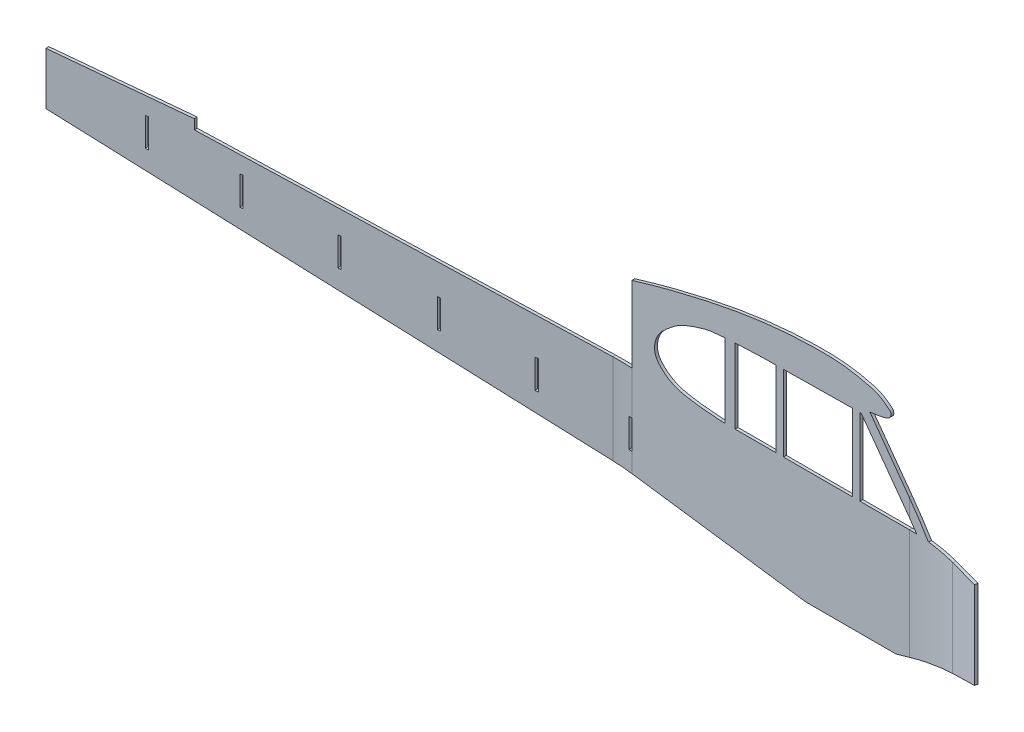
ISO-10303-21;
HEADER;
FILE_DESCRIPTION(('STEP AP214'),'2;1');
FILE_NAME('part.step','',(''),(''),'','','');
FILE_SCHEMA(('AUTOMOTIVE_DESIGN { 1 0 10303 214 1 1 1 1 }'));
ENDSEC;
DATA;
#1=APPLICATION_CONTEXT('core data for automotive mechanical design processes');
#2=APPLICATION_PROTOCOL_DEFINITION('international standard','automotive_design',2000,#1);
#3=PRODUCT_CONTEXT('',#1,'mechanical');
#4=PRODUCT('Part','Part','',(#3));
#5=PRODUCT_RELATED_PRODUCT_CATEGORY('part','',(#4));
#6=PRODUCT_DEFINITION_FORMATION('','',#4);
#7=PRODUCT_DEFINITION_CONTEXT('part definition',#1,'design');
#8=PRODUCT_DEFINITION('design','',#6,#7);
#9=PRODUCT_DEFINITION_SHAPE('','',#8);
#10=(LENGTH_UNIT() NAMED_UNIT(*) SI_UNIT(.MILLI.,.METRE.));
#11=(NAMED_UNIT(*) PLANE_ANGLE_UNIT() SI_UNIT($,.RADIAN.));
#12=(NAMED_UNIT(*) SI_UNIT($,.STERADIAN.) SOLID_ANGLE_UNIT());
#13=UNCERTAINTY_MEASURE_WITH_UNIT(LENGTH_MEASURE(1.E-05),#10,'distance_accuracy_value','');
#14=(GEOMETRIC_REPRESENTATION_CONTEXT(3) GLOBAL_UNCERTAINTY_ASSIGNED_CONTEXT((#13)) GLOBAL_UNIT_ASSIGNED_CONTEXT((#10,
#11,#12)) REPRESENTATION_CONTEXT('',''));
#15=CARTESIAN_POINT('',(0.,0.,0.));
#16=DIRECTION('',(0.,0.,1.));
#17=DIRECTION('',(1.,0.,0.));
#18=AXIS2_PLACEMENT_3D('',#15,#16,#17);
#19=CARTESIAN_POINT('',(423.112884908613,187.805139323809,-63.9999999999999));
#20=DIRECTION('',(-0.137787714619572,-0.990461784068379,0.));
#21=DIRECTION('',(0.985809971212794,-0.137140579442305,0.0968047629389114));
#22=AXIS2_PLACEMENT_3D('',#19,#20,#21);
#23=PLANE('',#22);
#24=CARTESIAN_POINT('',(423.454406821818,187.757628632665,-57.0000002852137));
#25=CARTESIAN_POINT('',(423.454406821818,187.757628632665,-54.0000002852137));
#26=B_SPLINE_CURVE_WITH_KNOTS('',1,(#24,#25),.UNSPECIFIED.,.F.,.F.,(2,2),(0.,1.),.UNSPECIFIED.);
#27=CARTESIAN_POINT('',(423.454406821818,187.757628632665,-57.0000002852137));
#28=VERTEX_POINT('',#27);
#29=CARTESIAN_POINT('',(423.454406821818,187.757628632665,-54.0000002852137));
#30=VERTEX_POINT('',#29);
#31=EDGE_CURVE('E483',#28,#30,#26,.T.);
#32=ORIENTED_EDGE('',*,*,#31,.F.);
#33=DIRECTION('',(0.990461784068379,-0.137787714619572,0.));
#34=VECTOR('',#33,1.);
#35=CARTESIAN_POINT('',(449.078341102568,184.192964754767,-56.9999999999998));
#36=LINE('',#35,#34);
#37=CARTESIAN_POINT('',(603.923340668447,162.651761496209,-56.9999999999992));
#38=VERTEX_POINT('',#37);
#39=EDGE_CURVE('E503',#28,#38,#36,.T.);
#40=ORIENTED_EDGE('',*,*,#39,.T.);
#41=DIRECTION('',(0.,0.,1.));
#42=VECTOR('',#41,1.);
#43=CARTESIAN_POINT('',(603.923340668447,162.651761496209,-64.0000000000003));
#44=LINE('',#43,#42);
#45=CARTESIAN_POINT('',(603.923340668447,162.651761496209,-54.0000000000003));
#46=VERTEX_POINT('',#45);
#47=EDGE_CURVE('E2185',#38,#46,#44,.T.);
#48=ORIENTED_EDGE('',*,*,#47,.T.);
#49=DIRECTION('',(0.990461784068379,-0.137787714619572,0.));
#50=VECTOR('',#49,1.);
#51=CARTESIAN_POINT('',(423.112884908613,187.805139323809,-53.9999999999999));
#52=LINE('',#51,#50);
#53=EDGE_CURVE('E515',#30,#46,#52,.T.);
#54=ORIENTED_EDGE('',*,*,#53,.F.);
#55=EDGE_LOOP('',(#32,#40,#48,#54));
#56=FACE_BOUND('',#55,.T.);
#57=ADVANCED_FACE('F74',(#56),#23,.T.);
#58=CARTESIAN_POINT('',(423.454406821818,0.,-53.9999999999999));
#59=DIRECTION('',(0.,0.,1.));
#60=DIRECTION('',(1.,0.,0.));
#61=AXIS2_PLACEMENT_3D('',#58,#59,#60);
#62=PLANE('',#61);
#63=CARTESIAN_POINT('',(519.799600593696,358.573905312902,-54.0000000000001));
#64=CARTESIAN_POINT('',(519.759458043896,358.571274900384,-54.0000000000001));
#65=CARTESIAN_POINT('',(513.587066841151,358.16625837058,-54.0000000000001));
#66=CARTESIAN_POINT('',(502.294883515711,357.267658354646,-54.));
#67=CARTESIAN_POINT('',(486.663965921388,352.197753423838,-54.));
#68=CARTESIAN_POINT('',(472.856554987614,347.123802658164,-54.));
#69=CARTESIAN_POINT('',(460.669285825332,337.586723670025,-54.));
#70=CARTESIAN_POINT('',(449.66784120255,327.736804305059,-53.9999999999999));
#71=CARTESIAN_POINT('',(446.081167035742,315.305868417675,-53.9999999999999));
#72=CARTESIAN_POINT('',(447.397082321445,305.587599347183,-53.9999999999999));
#73=CARTESIAN_POINT('',(454.295075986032,296.732722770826,-53.9999999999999));
#74=CARTESIAN_POINT('',(465.887548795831,288.557863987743,-54.));
#75=CARTESIAN_POINT('',(487.61215352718,283.609221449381,-54.));
#76=CARTESIAN_POINT('',(504.151091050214,282.413341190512,-54.0000000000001));
#77=CARTESIAN_POINT('',(515.385130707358,281.601041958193,-54.0000000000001));
#78=B_SPLINE_CURVE_WITH_KNOTS('',3,(#63,#64,#65,#66,#67,#68,#69,#70,#71,#72,#73,#74,#75,#76,
#77),.UNSPECIFIED.,.F.,.F.,(4,1,1,1,1,1,1,1,1,1,1,1,4),(0.,0.00056511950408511,
0.0868928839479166,0.158709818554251,0.2317751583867,0.2919672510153,0.376441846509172,
0.433944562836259,0.466281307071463,0.511044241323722,0.587066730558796,0.662116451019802,
0.821047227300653),.UNSPECIFIED.);
#79=CARTESIAN_POINT('',(519.799600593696,358.573905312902,-54.0000000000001));
#80=VERTEX_POINT('',#79);
#81=CARTESIAN_POINT('',(515.385130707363,281.601041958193,-53.9999999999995));
#82=VERTEX_POINT('',#81);
#83=EDGE_CURVE('E2192',#80,#82,#78,.T.);
#84=ORIENTED_EDGE('',*,*,#83,.F.);
#85=DIRECTION('',(0.,1.,0.));
#86=VECTOR('',#85,1.);
#87=CARTESIAN_POINT('',(519.799600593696,358.573905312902,-54.0000000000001));
#88=LINE('',#87,#86);
#89=CARTESIAN_POINT('',(519.799600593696,281.601041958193,-54.0000000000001));
#90=VERTEX_POINT('',#89);
#91=EDGE_CURVE('E2389',#90,#80,#88,.T.);
#92=ORIENTED_EDGE('',*,*,#91,.F.);
#93=DIRECTION('',(1.,0.,0.));
#94=VECTOR('',#93,1.);
#95=CARTESIAN_POINT('',(519.799600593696,281.601041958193,-54.0000000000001));
#96=LINE('',#95,#94);
#97=EDGE_CURVE('E2398',#82,#90,#96,.T.);
#98=ORIENTED_EDGE('',*,*,#97,.F.);
#99=EDGE_LOOP('',(#84,#92,#98));
#100=FACE_BOUND('',#99,.T.);
#101=DIRECTION('',(-0.999929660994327,-0.0118605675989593,0.));
#102=VECTOR('',#101,1.);
#103=CARTESIAN_POINT('',(580.765708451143,360.619276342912,-54.0000000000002));
#104=LINE('',#103,#102);
#105=CARTESIAN_POINT('',(652.382521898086,361.468752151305,-54.0000000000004));
#106=VERTEX_POINT('',#105);
#107=CARTESIAN_POINT('',(580.765708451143,360.619276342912,-53.9999999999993));
#108=VERTEX_POINT('',#107);
#109=EDGE_CURVE('E2253',#106,#108,#104,.T.);
#110=ORIENTED_EDGE('',*,*,#109,.F.);
#111=DIRECTION('',(0.,1.,0.));
#112=VECTOR('',#111,1.);
#113=CARTESIAN_POINT('',(652.382521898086,361.468752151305,-54.0000000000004));
#114=LINE('',#113,#112);
#115=CARTESIAN_POINT('',(652.382521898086,281.601041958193,-54.0000000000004));
#116=VERTEX_POINT('',#115);
#117=EDGE_CURVE('E2296',#116,#106,#114,.T.);
#118=ORIENTED_EDGE('',*,*,#117,.F.);
#119=DIRECTION('',(1.,0.,0.));
#120=VECTOR('',#119,1.);
#121=CARTESIAN_POINT('',(652.382521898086,281.601041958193,-54.0000000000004));
#122=LINE('',#121,#120);
#123=CARTESIAN_POINT('',(580.765708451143,281.601041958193,-54.0000000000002));
#124=VERTEX_POINT('',#123);
#125=EDGE_CURVE('E2293',#124,#116,#122,.T.);
#126=ORIENTED_EDGE('',*,*,#125,.F.);
#127=DIRECTION('',(0.,-1.,0.));
#128=VECTOR('',#127,1.);
#129=CARTESIAN_POINT('',(580.765708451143,360.619276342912,-54.0000000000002));
#130=LINE('',#129,#128);
#131=EDGE_CURVE('E2290',#108,#124,#130,.T.);
#132=ORIENTED_EDGE('',*,*,#131,.F.);
#133=EDGE_LOOP('',(#110,#118,#126,#132));
#134=FACE_BOUND('',#133,.T.);
#135=DIRECTION('',(0.,1.,0.));
#136=VECTOR('',#135,1.);
#137=CARTESIAN_POINT('',(572.765708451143,360.524385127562,-54.0000000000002));
#138=LINE('',#137,#136);
#139=CARTESIAN_POINT('',(572.765708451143,281.601041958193,-54.0000000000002));
#140=VERTEX_POINT('',#139);
#141=CARTESIAN_POINT('',(572.765708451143,360.524385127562,-53.9999999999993));
#142=VERTEX_POINT('',#141);
#143=EDGE_CURVE('E2302',#140,#142,#138,.T.);
#144=ORIENTED_EDGE('',*,*,#143,.F.);
#145=DIRECTION('',(1.,0.,0.));
#146=VECTOR('',#145,1.);
#147=CARTESIAN_POINT('',(572.765708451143,281.601041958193,-54.0000000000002));
#148=LINE('',#147,#146);
#149=CARTESIAN_POINT('',(530.450306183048,281.601041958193,-54.0000000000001));
#150=VERTEX_POINT('',#149);
#151=EDGE_CURVE('E2331',#150,#140,#148,.T.);
#152=ORIENTED_EDGE('',*,*,#151,.F.);
#153=DIRECTION('',(0.,-1.,0.));
#154=VECTOR('',#153,1.);
#155=CARTESIAN_POINT('',(530.450306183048,359.194246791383,-54.0000000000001));
#156=LINE('',#155,#154);
#157=CARTESIAN_POINT('',(530.450306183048,359.194246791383,-54.0000000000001));
#158=VERTEX_POINT('',#157);
#159=EDGE_CURVE('E2325',#158,#150,#156,.T.);
#160=ORIENTED_EDGE('',*,*,#159,.F.);
#161=CARTESIAN_POINT('',(557.849868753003,360.337408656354,-54.0000000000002));
#162=CARTESIAN_POINT('',(548.721965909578,360.00219076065,-54.0000000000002));
#163=CARTESIAN_POINT('',(539.594063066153,359.666972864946,-54.0000000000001));
#164=CARTESIAN_POINT('',(530.450306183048,359.194246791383,-54.0000000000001));
#165=B_SPLINE_CURVE_WITH_KNOTS('',3,(#161,#162,#163,#164),.UNSPECIFIED.,.F.,.F.,(4,4),
(0.871069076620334,1.),.UNSPECIFIED.);
#166=CARTESIAN_POINT('',(557.849868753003,360.337408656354,-54.0000000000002));
#167=VERTEX_POINT('',#166);
#168=EDGE_CURVE('E2320',#167,#158,#165,.T.);
#169=ORIENTED_EDGE('',*,*,#168,.F.);
#170=DIRECTION('',(-0.999921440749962,-0.0125344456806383,0.));
#171=VECTOR('',#170,1.);
#172=CARTESIAN_POINT('',(557.849868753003,360.337408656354,-54.0000000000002));
#173=LINE('',#172,#171);
#174=EDGE_CURVE('E2317',#142,#167,#173,.T.);
#175=ORIENTED_EDGE('',*,*,#174,.F.);
#176=EDGE_LOOP('',(#144,#152,#160,#169,#175));
#177=FACE_BOUND('',#176,.T.);
#178=DIRECTION('',(1.,0.,0.));
#179=VECTOR('',#178,1.);
#180=CARTESIAN_POINT('',(603.923340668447,162.651761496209,-54.0000000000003));
#181=LINE('',#180,#179);
#182=CARTESIAN_POINT('',(697.586142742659,162.651761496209,-54.0000000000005));
#183=VERTEX_POINT('',#182);
#184=EDGE_CURVE('E563',#46,#183,#181,.T.);
#185=ORIENTED_EDGE('',*,*,#184,.T.);
#186=DIRECTION('',(0.962443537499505,0.271481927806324,0.));
#187=VECTOR('',#186,1.);
#188=CARTESIAN_POINT('',(697.586142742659,162.651761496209,-54.0000000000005));
#189=LINE('',#188,#187);
#190=CARTESIAN_POINT('',(711.659291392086,166.621454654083,-54.0000000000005));
#191=VERTEX_POINT('',#190);
#192=EDGE_CURVE('E560',#183,#191,#189,.T.);
#193=ORIENTED_EDGE('',*,*,#192,.T.);
#194=DIRECTION('',(0.,1.,0.));
#195=VECTOR('',#194,1.);
#196=CARTESIAN_POINT('',(711.659291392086,0.,-53.9999999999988));
#197=LINE('',#196,#195);
#198=CARTESIAN_POINT('',(711.659291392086,281.601041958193,-53.9999999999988));
#199=VERTEX_POINT('',#198);
#200=EDGE_CURVE('E548',#191,#199,#197,.T.);
#201=ORIENTED_EDGE('',*,*,#200,.T.);
#202=DIRECTION('',(1.,0.,0.));
#203=VECTOR('',#202,1.);
#204=CARTESIAN_POINT('',(719.73353176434,281.601041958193,-54.0000000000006));
#205=LINE('',#204,#203);
#206=CARTESIAN_POINT('',(660.382521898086,281.601041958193,-54.0000000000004));
#207=VERTEX_POINT('',#206);
#208=EDGE_CURVE('E2246',#207,#199,#205,.T.);
#209=ORIENTED_EDGE('',*,*,#208,.F.);
#210=DIRECTION('',(0.,-1.,0.));
#211=VECTOR('',#210,1.);
#212=CARTESIAN_POINT('',(660.382521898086,361.56364336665,-54.0000000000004));
#213=LINE('',#212,#211);
#214=CARTESIAN_POINT('',(660.382521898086,361.56364336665,-54.0000000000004));
#215=VERTEX_POINT('',#214);
#216=EDGE_CURVE('E2278',#215,#207,#213,.T.);
#217=ORIENTED_EDGE('',*,*,#216,.F.);
#218=DIRECTION('',(-0.999929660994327,-0.011860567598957,0.));
#219=VECTOR('',#218,1.);
#220=CARTESIAN_POINT('',(660.382521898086,361.56364336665,-54.0000000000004));
#221=LINE('',#220,#219);
#222=CARTESIAN_POINT('',(661.568680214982,361.577712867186,-54.0000000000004));
#223=VERTEX_POINT('',#222);
#224=EDGE_CURVE('E2270',#223,#215,#221,.T.);
#225=ORIENTED_EDGE('',*,*,#224,.F.);
#226=DIRECTION('',(-0.588171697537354,0.808736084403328,0.));
#227=VECTOR('',#226,1.);
#228=CARTESIAN_POINT('',(661.568680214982,361.577712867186,-54.0000000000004));
#229=LINE('',#228,#227);
#230=CARTESIAN_POINT('',(711.659291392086,292.703122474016,-54.0000000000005));
#231=VERTEX_POINT('',#230);
#232=EDGE_CURVE('E93',#231,#223,#229,.T.);
#233=ORIENTED_EDGE('',*,*,#232,.F.);
#234=DIRECTION('',(0.,1.,0.));
#235=VECTOR('',#234,1.);
#236=CARTESIAN_POINT('',(711.659291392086,0.,-53.9999999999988));
#237=LINE('',#236,#235);
#238=CARTESIAN_POINT('',(711.659291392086,310.694407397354,-54.0000000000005));
#239=VERTEX_POINT('',#238);
#240=EDGE_CURVE('E809',#231,#239,#237,.T.);
#241=ORIENTED_EDGE('',*,*,#240,.T.);
#242=DIRECTION('',(-0.588171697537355,0.808736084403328,0.));
#243=VECTOR('',#242,1.);
#244=CARTESIAN_POINT('',(732.818102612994,281.601041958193,-54.0000000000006));
#245=LINE('',#244,#243);
#246=CARTESIAN_POINT('',(670.640711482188,367.094954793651,-54.0000000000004));
#247=VERTEX_POINT('',#246);
#248=EDGE_CURVE('E101',#239,#247,#245,.T.);
#249=ORIENTED_EDGE('',*,*,#248,.T.);
#250=CARTESIAN_POINT('',(670.640711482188,367.094954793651,-54.0000000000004));
#251=CARTESIAN_POINT('',(672.749319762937,367.29885427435,-54.0000000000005));
#252=CARTESIAN_POINT('',(677.569759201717,367.828957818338,-54.0000000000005));
#253=CARTESIAN_POINT('',(683.993291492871,369.151206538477,-54.0000000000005));
#254=CARTESIAN_POINT('',(689.282372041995,370.690695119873,-54.0000000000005));
#255=CARTESIAN_POINT('',(692.714224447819,373.424196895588,-54.0000000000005));
#256=CARTESIAN_POINT('',(692.652025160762,377.967755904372,-54.0000000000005));
#257=CARTESIAN_POINT('',(688.230364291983,381.475819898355,-54.0000000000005));
#258=CARTESIAN_POINT('',(680.080567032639,387.77937369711,-54.0000000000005));
#259=CARTESIAN_POINT('',(665.590761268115,391.625328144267,-54.0000000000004));
#260=CARTESIAN_POINT('',(647.793933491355,395.113942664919,-54.0000000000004));
#261=CARTESIAN_POINT('',(630.442106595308,396.439866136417,-54.0000000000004));
#262=CARTESIAN_POINT('',(610.58259409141,396.328081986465,-54.0000000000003));
#263=CARTESIAN_POINT('',(588.969638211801,395.546443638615,-54.0000000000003));
#264=CARTESIAN_POINT('',(566.529059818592,393.453732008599,-54.0000000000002));
#265=CARTESIAN_POINT('',(547.742925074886,390.921539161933,-54.0000000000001));
#266=CARTESIAN_POINT('',(527.161495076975,387.607684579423,-54.0000000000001));
#267=CARTESIAN_POINT('',(503.042469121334,382.833660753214,-54.0000000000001));
#268=CARTESIAN_POINT('',(475.45750905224,376.410578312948,-54.));
#269=CARTESIAN_POINT('',(448.758188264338,369.525829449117,-53.9999999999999));
#270=CARTESIAN_POINT('',(431.973402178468,364.520832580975,-53.9999999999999));
#271=CARTESIAN_POINT('',(423.112884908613,361.878745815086,-53.9999999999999));
#272=B_SPLINE_CURVE_WITH_KNOTS('',3,(#250,#251,#252,#253,#254,#255,#256,#257,#258,#259,#260,
#261,#262,#263,#264,#265,#266,#267,#268,#269,#270,#271),.UNSPECIFIED.,.F.,.F.,(4,1,1,1,1,1,1,1,
1,1,1,1,1,1,1,1,1,1,1,4),(0.448966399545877,0.460485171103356,0.475338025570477,
0.484571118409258,0.490413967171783,0.497773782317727,0.505441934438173,0.519813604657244,
0.554266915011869,0.584494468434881,0.619074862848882,0.648495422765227,0.692559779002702,
0.736653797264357,0.77103496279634,0.795656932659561,0.850042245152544,0.904732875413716,
0.949709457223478,1.),.UNSPECIFIED.);
#273=CARTESIAN_POINT('',(423.454406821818,361.980582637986,-54.0000002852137));
#274=VERTEX_POINT('',#273);
#275=EDGE_CURVE('E1084',#247,#274,#272,.T.);
#276=ORIENTED_EDGE('',*,*,#275,.T.);
#277=DIRECTION('',(0.,1.,0.));
#278=VECTOR('',#277,1.);
#279=CARTESIAN_POINT('',(423.454406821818,0.,-53.9999999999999));
#280=LINE('',#279,#278);
#281=EDGE_CURVE('E86',#30,#274,#280,.T.);
#282=ORIENTED_EDGE('',*,*,#281,.F.);
#283=ORIENTED_EDGE('',*,*,#53,.T.);
#284=EDGE_LOOP('',(#185,#193,#201,#209,#217,#225,#233,#241,#249,#276,#282,#283));
#285=FACE_BOUND('',#284,.T.);
#286=ADVANCED_FACE('F532',(#100,#134,#177,#285),#62,.T.);
#287=CARTESIAN_POINT('',(423.454406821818,0.,-56.9999999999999));
#288=DIRECTION('',(0.,0.,1.));
#289=DIRECTION('',(1.,0.,0.));
#290=AXIS2_PLACEMENT_3D('',#287,#288,#289);
#291=PLANE('',#290);
#292=DIRECTION('',(0.,1.,0.));
#293=VECTOR('',#292,1.);
#294=CARTESIAN_POINT('',(519.799600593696,0.,-56.9999999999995));
#295=LINE('',#294,#293);
#296=CARTESIAN_POINT('',(519.799600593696,281.601041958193,-56.9999999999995));
#297=VERTEX_POINT('',#296);
#298=CARTESIAN_POINT('',(519.799600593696,358.573905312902,-56.9999999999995));
#299=VERTEX_POINT('',#298);
#300=EDGE_CURVE('E2208',#297,#299,#295,.T.);
#301=ORIENTED_EDGE('',*,*,#300,.T.);
#302=CARTESIAN_POINT('',(519.799600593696,358.573905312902,-56.9999999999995));
#303=CARTESIAN_POINT('',(518.57533140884,358.493655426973,-56.9999999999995));
#304=CARTESIAN_POINT('',(517.351106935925,358.410232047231,-56.9999999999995));
#305=CARTESIAN_POINT('',(514.901732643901,358.225846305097,-56.9999999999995));
#306=CARTESIAN_POINT('',(513.676585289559,358.124851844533,-56.9999999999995));
#307=CARTESIAN_POINT('',(511.228201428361,357.8942827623,-56.9999999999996));
#308=CARTESIAN_POINT('',(510.004966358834,357.764692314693,-56.9999999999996));
#309=CARTESIAN_POINT('',(507.56330936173,357.465688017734,-56.9999999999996));
#310=CARTESIAN_POINT('',(506.344887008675,357.296277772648,-56.9999999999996));
#311=CARTESIAN_POINT('',(504.523274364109,357.003804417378,-56.9999999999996));
#312=CARTESIAN_POINT('',(503.916993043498,356.899903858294,-56.9999999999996));
#313=CARTESIAN_POINT('',(502.707027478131,356.677941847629,-56.9999999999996));
#314=CARTESIAN_POINT('',(502.103343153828,356.55988083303,-56.9999999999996));
#315=CARTESIAN_POINT('',(500.89841149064,356.307999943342,-56.9999999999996));
#316=CARTESIAN_POINT('',(500.29716859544,356.174158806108,-56.9999999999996));
#317=CARTESIAN_POINT('',(499.09799419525,355.892398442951,-56.9999999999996));
#318=CARTESIAN_POINT('',(498.500062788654,355.744478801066,-56.9999999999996));
#319=CARTESIAN_POINT('',(496.744352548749,355.2906775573,-56.9999999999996));
#320=CARTESIAN_POINT('',(495.591021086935,354.967518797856,-56.9999999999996));
#321=CARTESIAN_POINT('',(493.868615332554,354.456332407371,-56.9999999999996));
#322=CARTESIAN_POINT('',(493.295541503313,354.281461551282,-56.9999999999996));
#323=CARTESIAN_POINT('',(492.151684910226,353.924358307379,-56.9999999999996));
#324=CARTESIAN_POINT('',(491.580902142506,353.742125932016,-56.9999999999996));
#325=CARTESIAN_POINT('',(490.440931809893,353.371605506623,-56.9999999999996));
#326=CARTESIAN_POINT('',(489.871745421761,353.18331385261,-56.9999999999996));
#327=CARTESIAN_POINT('',(489.019114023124,352.897453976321,-56.9999999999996));
#328=CARTESIAN_POINT('',(488.73509369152,352.801596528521,-56.9999999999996));
#329=CARTESIAN_POINT('',(488.167381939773,352.608911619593,-56.9999999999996));
#330=CARTESIAN_POINT('',(487.883690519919,352.512084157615,-56.9999999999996));
#331=CARTESIAN_POINT('',(487.316598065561,352.317635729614,-56.9999999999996));
#332=CARTESIAN_POINT('',(487.033197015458,352.220014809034,-56.9999999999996));
#333=CARTESIAN_POINT('',(486.466613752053,352.024139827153,-56.9999999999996));
#334=CARTESIAN_POINT('',(486.183431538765,351.925885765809,-56.9999999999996));
#335=CARTESIAN_POINT('',(485.617385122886,351.728468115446,-56.9999999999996));
#336=CARTESIAN_POINT('',(485.334520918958,351.629304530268,-56.9999999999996));
#337=CARTESIAN_POINT('',(484.769210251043,351.429794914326,-56.9999999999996));
#338=CARTESIAN_POINT('',(484.486763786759,351.329448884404,-56.9999999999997));
#339=CARTESIAN_POINT('',(483.640614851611,351.026373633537,-56.9999999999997));
#340=CARTESIAN_POINT('',(483.077689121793,350.82146386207,-56.9999999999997));
#341=CARTESIAN_POINT('',(481.954795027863,350.403642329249,-56.9999999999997));
#342=CARTESIAN_POINT('',(481.394826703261,350.190730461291,-56.9999999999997));
#343=CARTESIAN_POINT('',(480.279091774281,349.754812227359,-56.9999999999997));
#344=CARTESIAN_POINT('',(479.723323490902,349.5318101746,-56.9999999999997));
#345=CARTESIAN_POINT('',(478.61691643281,349.073454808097,-56.9999999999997));
#346=CARTESIAN_POINT('',(478.066277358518,348.838102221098,-56.9999999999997));
#347=CARTESIAN_POINT('',(477.108279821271,348.413526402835,-56.9999999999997));
#348=CARTESIAN_POINT('',(476.699514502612,348.227479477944,-56.9999999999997));
#349=CARTESIAN_POINT('',(475.886531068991,347.846460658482,-56.9999999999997));
#350=CARTESIAN_POINT('',(475.482309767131,347.651495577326,-56.9999999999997));
#351=CARTESIAN_POINT('',(474.679126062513,347.251805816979,-56.9999999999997));
#352=CARTESIAN_POINT('',(474.280159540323,347.04708944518,-56.9999999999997));
#353=CARTESIAN_POINT('',(473.686133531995,346.732044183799,-56.9999999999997));
#354=CARTESIAN_POINT('',(473.488932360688,346.625740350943,-56.9999999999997));
#355=CARTESIAN_POINT('',(473.096048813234,346.410360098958,-56.9999999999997));
#356=CARTESIAN_POINT('',(472.900366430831,346.30128369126,-56.9999999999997));
#357=CARTESIAN_POINT('',(472.51073377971,346.080291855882,-56.9999999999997));
#358=CARTESIAN_POINT('',(472.316782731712,345.968377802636,-56.9999999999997));
#359=CARTESIAN_POINT('',(471.930552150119,345.741703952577,-56.9999999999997));
#360=CARTESIAN_POINT('',(471.738272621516,345.62694414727,-56.9999999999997));
#361=CARTESIAN_POINT('',(471.163974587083,345.278701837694,-56.9999999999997));
#362=CARTESIAN_POINT('',(470.784388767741,345.041195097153,-56.9999999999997));
#363=CARTESIAN_POINT('',(470.029975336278,344.555672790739,-56.9999999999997));
#364=CARTESIAN_POINT('',(469.655171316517,344.307620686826,-56.9999999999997));
#365=CARTESIAN_POINT('',(468.911092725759,343.802805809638,-56.9999999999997));
#366=CARTESIAN_POINT('',(468.541822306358,343.546036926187,-56.9999999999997));
#367=CARTESIAN_POINT('',(467.808310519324,343.024857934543,-56.9999999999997));
#368=CARTESIAN_POINT('',(467.44407310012,342.760442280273,-56.9999999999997));
#369=CARTESIAN_POINT('',(466.7201213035,342.225041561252,-56.9999999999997));
#370=CARTESIAN_POINT('',(466.360409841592,341.954052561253,-56.9999999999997));
#371=CARTESIAN_POINT('',(465.64500551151,341.406576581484,-56.9999999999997));
#372=CARTESIAN_POINT('',(465.289314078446,341.130087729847,-56.9999999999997));
#373=CARTESIAN_POINT('',(464.581447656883,340.572678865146,-56.9999999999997));
#374=CARTESIAN_POINT('',(464.229272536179,340.29175901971,-56.9999999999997));
#375=CARTESIAN_POINT('',(463.668338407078,339.83969690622,-56.9999999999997));
#376=CARTESIAN_POINT('',(463.458669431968,339.6696809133,-56.9999999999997));
#377=CARTESIAN_POINT('',(463.040205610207,339.32857558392,-56.9999999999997));
#378=CARTESIAN_POINT('',(462.831410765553,339.157486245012,-56.9999999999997));
#379=CARTESIAN_POINT('',(462.414657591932,338.81452744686,-56.9999999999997));
#380=CARTESIAN_POINT('',(462.206698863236,338.642658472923,-56.9999999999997));
#381=CARTESIAN_POINT('',(461.791381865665,338.29819660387,-56.9999999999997));
#382=CARTESIAN_POINT('',(461.584023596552,338.125603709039,-56.9999999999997));
#383=CARTESIAN_POINT('',(461.170171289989,337.779485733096,-56.9999999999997));
#384=CARTESIAN_POINT('',(460.963677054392,337.605960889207,-56.9999999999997));
#385=CARTESIAN_POINT('',(460.551695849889,337.257720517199,-56.9999999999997));
#386=CARTESIAN_POINT('',(460.346208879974,337.083004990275,-56.9999999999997));
#387=CARTESIAN_POINT('',(459.731515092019,336.556696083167,-56.9999999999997));
#388=CARTESIAN_POINT('',(459.324119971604,336.202977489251,-56.9999999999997));
#389=CARTESIAN_POINT('',(458.51560107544,335.487895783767,-56.9999999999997));
#390=CARTESIAN_POINT('',(458.114481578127,335.126527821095,-56.9999999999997));
#391=CARTESIAN_POINT('',(457.322294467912,334.396183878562,-56.9999999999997));
#392=CARTESIAN_POINT('',(456.931191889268,334.027245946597,-56.9999999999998));
#393=CARTESIAN_POINT('',(456.159265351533,333.278617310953,-56.9999999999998));
#394=CARTESIAN_POINT('',(455.77844300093,332.898924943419,-56.9999999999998));
#395=CARTESIAN_POINT('',(455.029562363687,332.127490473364,-56.9999999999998));
#396=CARTESIAN_POINT('',(454.661497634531,331.735754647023,-56.9999999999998));
#397=CARTESIAN_POINT('',(453.940645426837,330.938921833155,-56.9999999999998));
#398=CARTESIAN_POINT('',(453.587847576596,330.533834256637,-56.9999999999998));
#399=CARTESIAN_POINT('',(452.900044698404,329.708946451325,-56.9999999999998));
#400=CARTESIAN_POINT('',(452.565034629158,329.289150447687,-56.9999999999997));
#401=CARTESIAN_POINT('',(452.017718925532,328.568338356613,-56.9999999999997));
#402=CARTESIAN_POINT('',(451.799945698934,328.271466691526,-56.9999999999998));
#403=CARTESIAN_POINT('',(451.375031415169,327.670129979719,-56.9999999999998));
#404=CARTESIAN_POINT('',(451.16789180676,327.365663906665,-56.9999999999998));
#405=CARTESIAN_POINT('',(450.765282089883,326.749137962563,-56.9999999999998));
#406=CARTESIAN_POINT('',(450.569810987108,326.437078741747,-56.9999999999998));
#407=CARTESIAN_POINT('',(450.191525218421,325.80538971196,-56.9999999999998));
#408=CARTESIAN_POINT('',(450.008709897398,325.485760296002,-56.9999999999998));
#409=CARTESIAN_POINT('',(449.656742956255,324.839410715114,-56.9999999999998));
#410=CARTESIAN_POINT('',(449.487579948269,324.512696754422,-56.9999999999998));
#411=CARTESIAN_POINT('',(449.162922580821,323.852489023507,-56.9999999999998));
#412=CARTESIAN_POINT('',(449.00743025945,323.518994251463,-56.9999999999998));
#413=CARTESIAN_POINT('',(448.710423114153,322.845804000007,-56.9999999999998));
#414=CARTESIAN_POINT('',(448.568909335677,322.506108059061,-56.9999999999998));
#415=CARTESIAN_POINT('',(448.300182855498,321.821107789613,-56.9999999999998));
#416=CARTESIAN_POINT('',(448.172970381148,321.475803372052,-56.9999999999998));
#417=CARTESIAN_POINT('',(447.892543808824,320.662211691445,-56.9999999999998));
#418=CARTESIAN_POINT('',(447.745131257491,320.191909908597,-56.9999999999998));
#419=CARTESIAN_POINT('',(447.477489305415,319.243659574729,-56.9999999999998));
#420=CARTESIAN_POINT('',(447.357258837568,318.76571132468,-56.9999999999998));
#421=CARTESIAN_POINT('',(447.144958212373,317.803507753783,-56.9999999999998));
#422=CARTESIAN_POINT('',(447.052892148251,317.31925152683,-56.9999999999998));
#423=CARTESIAN_POINT('',(446.897841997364,316.344984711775,-56.9999999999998));
#424=CARTESIAN_POINT('',(446.834923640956,315.854963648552,-56.9999999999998));
#425=CARTESIAN_POINT('',(446.739603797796,314.8719508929,-56.9999999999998));
#426=CARTESIAN_POINT('',(446.707199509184,314.378959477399,-56.9999999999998));
#427=CARTESIAN_POINT('',(446.682271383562,313.638822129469,-56.9999999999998));
#428=CARTESIAN_POINT('',(446.677907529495,313.392029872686,-56.9999999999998));
#429=CARTESIAN_POINT('',(446.677260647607,312.898436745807,-56.9999999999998));
#430=CARTESIAN_POINT('',(446.6809776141,312.651635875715,-56.9999999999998));
#431=CARTESIAN_POINT('',(446.704848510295,311.908295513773,-56.9999999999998));
#432=CARTESIAN_POINT('',(446.737840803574,311.412085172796,-56.9999999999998));
#433=CARTESIAN_POINT('',(446.840757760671,310.423556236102,-56.9999999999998));
#434=CARTESIAN_POINT('',(446.910677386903,309.931237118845,-56.9999999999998));
#435=CARTESIAN_POINT('',(447.090096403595,308.957010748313,-56.9999999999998));
#436=CARTESIAN_POINT('',(447.199332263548,308.475056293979,-56.9999999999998));
#437=CARTESIAN_POINT('',(447.39518152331,307.761063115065,-56.9999999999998));
#438=CARTESIAN_POINT('',(447.465795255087,307.524560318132,-56.9999999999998));
#439=CARTESIAN_POINT('',(447.618078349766,307.055150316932,-56.9999999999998));
#440=CARTESIAN_POINT('',(447.699746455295,306.822242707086,-56.9999999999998));
#441=CARTESIAN_POINT('',(447.903566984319,306.283466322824,-56.9999999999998));
#442=CARTESIAN_POINT('',(448.030122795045,305.979256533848,-56.9999999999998));
#443=CARTESIAN_POINT('',(448.301356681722,305.378938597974,-56.9999999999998));
#444=CARTESIAN_POINT('',(448.446041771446,305.082833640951,-56.9999999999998));
#445=CARTESIAN_POINT('',(448.751586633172,304.499116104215,-56.9999999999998));
#446=CARTESIAN_POINT('',(448.912446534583,304.21150359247,-56.9999999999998));
#447=CARTESIAN_POINT('',(449.249670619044,303.642703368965,-56.9999999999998));
#448=CARTESIAN_POINT('',(449.426139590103,303.361578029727,-56.9999999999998));
#449=CARTESIAN_POINT('',(449.791728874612,302.807756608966,-56.9999999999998));
#450=CARTESIAN_POINT('',(449.980847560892,302.535059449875,-56.9999999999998));
#451=CARTESIAN_POINT('',(450.370122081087,301.997628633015,-56.9999999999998));
#452=CARTESIAN_POINT('',(450.57027974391,301.732896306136,-56.9999999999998));
#453=CARTESIAN_POINT('',(451.10430773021,301.052731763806,-56.9999999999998));
#454=CARTESIAN_POINT('',(451.445703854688,300.64319304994,-56.9999999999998));
#455=CARTESIAN_POINT('',(451.972197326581,300.041447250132,-56.9999999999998));
#456=CARTESIAN_POINT('',(452.150157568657,299.842894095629,-56.9999999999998));
#457=CARTESIAN_POINT('',(452.510311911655,299.449656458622,-56.9999999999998));
#458=CARTESIAN_POINT('',(452.692506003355,299.254971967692,-56.9999999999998));
#459=CARTESIAN_POINT('',(453.060655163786,298.868953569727,-56.9999999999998));
#460=CARTESIAN_POINT('',(453.246612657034,298.677621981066,-56.9999999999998));
#461=CARTESIAN_POINT('',(453.621927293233,298.298323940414,-56.9999999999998));
#462=CARTESIAN_POINT('',(453.811284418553,298.110357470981,-56.9999999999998));
#463=CARTESIAN_POINT('',(454.19339695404,297.737891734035,-56.9999999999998));
#464=CARTESIAN_POINT('',(454.386152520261,297.553392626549,-56.9999999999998));
#465=CARTESIAN_POINT('',(454.774985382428,297.187934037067,-56.9999999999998));
#466=CARTESIAN_POINT('',(454.971062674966,297.006974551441,-56.9999999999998));
#467=CARTESIAN_POINT('',(455.563113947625,296.47050105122,-56.9999999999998));
#468=CARTESIAN_POINT('',(455.963974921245,296.120351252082,-56.9999999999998));
#469=CARTESIAN_POINT('',(456.777981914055,295.435225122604,-56.9999999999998));
#470=CARTESIAN_POINT('',(457.191119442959,295.100238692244,-56.9999999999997));
#471=CARTESIAN_POINT('',(458.029373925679,294.445833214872,-56.9999999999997));
#472=CARTESIAN_POINT('',(458.454487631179,294.126410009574,-56.9999999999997));
#473=CARTESIAN_POINT('',(459.316383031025,293.503556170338,-56.9999999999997));
#474=CARTESIAN_POINT('',(459.753166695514,293.200128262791,-56.9999999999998));
#475=CARTESIAN_POINT('',(460.664079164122,292.592377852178,-56.9999999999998));
#476=CARTESIAN_POINT('',(461.138886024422,292.289070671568,-56.9999999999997));
#477=CARTESIAN_POINT('',(462.100449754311,291.701700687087,-56.9999999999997));
#478=CARTESIAN_POINT('',(462.587210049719,291.417643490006,-56.9999999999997));
#479=CARTESIAN_POINT('',(463.571822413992,290.869579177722,-56.9999999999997));
#480=CARTESIAN_POINT('',(464.069673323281,290.605569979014,-56.9999999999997));
#481=CARTESIAN_POINT('',(465.075592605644,290.098320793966,-56.9999999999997));
#482=CARTESIAN_POINT('',(465.583656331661,289.855071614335,-56.9999999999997));
#483=CARTESIAN_POINT('',(466.354851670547,289.505393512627,-56.9999999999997));
#484=CARTESIAN_POINT('',(466.61438976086,289.39098044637,-56.9999999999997));
#485=CARTESIAN_POINT('',(467.135754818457,289.167491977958,-56.9999999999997));
#486=CARTESIAN_POINT('',(467.397581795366,289.058416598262,-56.9999999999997));
#487=CARTESIAN_POINT('',(468.186196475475,288.738897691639,-56.9999999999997));
#488=CARTESIAN_POINT('',(468.716122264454,288.536159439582,-56.9999999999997));
#489=CARTESIAN_POINT('',(469.782942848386,288.149668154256,-56.9999999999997));
#490=CARTESIAN_POINT('',(470.319839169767,287.965919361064,-56.9999999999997));
#491=CARTESIAN_POINT('',(471.399252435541,287.615756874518,-56.9999999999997));
#492=CARTESIAN_POINT('',(471.941769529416,287.449343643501,-56.9999999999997));
#493=CARTESIAN_POINT('',(473.07720051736,287.118753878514,-56.9999999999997));
#494=CARTESIAN_POINT('',(473.670511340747,286.955945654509,-56.9999999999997));
#495=CARTESIAN_POINT('',(474.861396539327,286.646362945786,-56.9999999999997));
#496=CARTESIAN_POINT('',(475.458971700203,286.49959150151,-56.9999999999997));
#497=CARTESIAN_POINT('',(476.657370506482,286.219833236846,-56.9999999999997));
#498=CARTESIAN_POINT('',(477.258194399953,286.086847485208,-56.9999999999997));
#499=CARTESIAN_POINT('',(478.462995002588,285.832254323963,-56.9999999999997));
#500=CARTESIAN_POINT('',(479.066974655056,285.710660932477,-56.9999999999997));
#501=CARTESIAN_POINT('',(480.2766738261,285.476814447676,-56.9999999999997));
#502=CARTESIAN_POINT('',(480.882393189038,285.3645605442,-56.9999999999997));
#503=CARTESIAN_POINT('',(481.791907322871,285.201454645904,-56.9999999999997));
#504=CARTESIAN_POINT('',(482.095233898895,285.147965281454,-56.9999999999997));
#505=CARTESIAN_POINT('',(482.702173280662,285.042635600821,-56.9999999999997));
#506=CARTESIAN_POINT('',(483.005786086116,284.990795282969,-56.9999999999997));
#507=CARTESIAN_POINT('',(483.918429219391,284.837474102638,-56.9999999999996));
#508=CARTESIAN_POINT('',(484.527872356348,284.73844218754,-56.9999999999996));
#509=CARTESIAN_POINT('',(485.747721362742,284.546547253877,-56.9999999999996));
#510=CARTESIAN_POINT('',(486.358127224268,284.453684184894,-56.9999999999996));
#511=CARTESIAN_POINT('',(487.579793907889,284.273779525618,-56.9999999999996));
#512=CARTESIAN_POINT('',(488.191054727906,284.186737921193,-56.9999999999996));
#513=CARTESIAN_POINT('',(489.415218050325,284.017996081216,-56.9999999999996));
#514=CARTESIAN_POINT('',(490.028121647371,283.936303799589,-56.9999999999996));
#515=CARTESIAN_POINT('',(491.25459041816,283.778035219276,-56.9999999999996));
#516=CARTESIAN_POINT('',(491.868155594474,283.701458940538,-56.9999999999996));
#517=CARTESIAN_POINT('',(493.09585925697,283.553053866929,-56.9999999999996));
#518=CARTESIAN_POINT('',(493.709997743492,283.481225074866,-56.9999999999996));
#519=CARTESIAN_POINT('',(494.910857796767,283.345106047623,-56.9999999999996));
#520=CARTESIAN_POINT('',(495.497557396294,283.280621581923,-56.9999999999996));
#521=CARTESIAN_POINT('',(496.671344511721,283.155311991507,-56.9999999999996));
#522=CARTESIAN_POINT('',(497.258432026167,283.094486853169,-56.9999999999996));
#523=CARTESIAN_POINT('',(498.432940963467,282.976166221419,-56.9999999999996));
#524=CARTESIAN_POINT('',(499.020362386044,282.918670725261,-56.9999999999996));
#525=CARTESIAN_POINT('',(501.3673869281,282.694994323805,-56.9999999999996));
#526=CARTESIAN_POINT('',(503.128131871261,282.540758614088,-56.9999999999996));
#527=CARTESIAN_POINT('',(506.643755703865,282.250820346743,-56.9999999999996));
#528=CARTESIAN_POINT('',(508.39862868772,282.115043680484,-56.9999999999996));
#529=CARTESIAN_POINT('',(511.897392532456,281.853229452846,-56.9999999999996));
#530=CARTESIAN_POINT('',(513.641278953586,281.727133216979,-56.9999999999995));
#531=CARTESIAN_POINT('',(515.385130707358,281.601041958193,-56.9999999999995));
#532=B_SPLINE_CURVE_WITH_KNOTS('',3,(#302,#303,#304,#305,#306,#307,#308,#309,#310,#311,#312,
#313,#314,#315,#316,#317,#318,#319,#320,#321,#322,#323,#324,#325,#326,#327,#328,#329,#330,#331,
#332,#333,#334,#335,#336,#337,#338,#339,#340,#341,#342,#343,#344,#345,#346,#347,#348,#349,#350,
#351,#352,#353,#354,#355,#356,#357,#358,#359,#360,#361,#362,#363,#364,#365,#366,#367,#368,#369,
#370,#371,#372,#373,#374,#375,#376,#377,#378,#379,#380,#381,#382,#383,#384,#385,#386,#387,#388,
#389,#390,#391,#392,#393,#394,#395,#396,#397,#398,#399,#400,#401,#402,#403,#404,#405,#406,#407,
#408,#409,#410,#411,#412,#413,#414,#415,#416,#417,#418,#419,#420,#421,#422,#423,#424,#425,#426,
#427,#428,#429,#430,#431,#432,#433,#434,#435,#436,#437,#438,#439,#440,#441,#442,#443,#444,#445,
#446,#447,#448,#449,#450,#451,#452,#453,#454,#455,#456,#457,#458,#459,#460,#461,#462,#463,#464,
#465,#466,#467,#468,#469,#470,#471,#472,#473,#474,#475,#476,#477,#478,#479,#480,#481,#482,#483,
#484,#485,#486,#487,#488,#489,#490,#491,#492,#493,#494,#495,#496,#497,#498,#499,#500,#501,#502,
#503,#504,#505,#506,#507,#508,#509,#510,#511,#512,#513,#514,#515,#516,#517,#518,#519,#520,#521,
#522,#523,#524,#525,#526,#527,#528,#529,#530,#531),.UNSPECIFIED.,.F.,.F.,(4,2,2,2,2,2,2,2,2,2,2,
2,2,2,2,2,2,2,2,2,2,2,2,2,2,2,2,2,2,2,2,2,2,2,2,2,2,2,2,2,2,2,2,2,2,2,2,2,2,2,2,2,2,2,2,2,2,2,2,
2,2,2,2,2,2,2,2,2,2,2,2,2,2,2,2,2,2,2,2,2,2,2,2,2,2,2,2,2,2,2,2,2,2,2,2,2,2,2,2,2,2,2,2,2,2,2,2,
2,2,2,2,2,2,2,4),(0.,3.68094885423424,7.368693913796,11.0584850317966,14.747942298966,
16.593163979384,18.4383287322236,20.2860087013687,22.1337432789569,25.7260806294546,
27.5235368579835,29.3209900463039,31.1195328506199,32.0188120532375,32.9180920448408,
33.8173208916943,34.7165498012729,35.6157749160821,36.5149993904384,38.3121348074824,
40.1092941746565,41.9056924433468,43.7019851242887,45.0492270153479,46.3954562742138,
47.7405584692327,48.412625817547,49.084690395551,49.7564354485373,50.4281825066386,
51.7713044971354,53.1195356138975,54.4687321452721,55.8189330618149,57.1699632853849,
58.5214614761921,59.8729086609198,60.6827194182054,61.4925320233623,62.3018954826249,
63.1112586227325,63.9204246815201,64.7295899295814,66.3480944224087,67.9676580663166,
69.5804622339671,71.1935173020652,72.8057455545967,74.416860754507,76.0275168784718,
77.131859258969,78.2363517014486,79.3407498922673,80.4450908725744,81.5485009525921,
82.6520752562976,83.7557320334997,84.8594063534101,86.337166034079,87.8148676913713,
89.2927840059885,90.77401710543,92.2551141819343,92.995491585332,93.7358684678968,
95.2264097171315,96.7167476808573,98.1972767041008,98.9375081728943,99.6776555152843,
100.665421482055,101.653570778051,102.641727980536,103.637112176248,104.632368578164,
105.627790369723,107.22642836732,108.026287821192,108.826145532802,109.626536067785,
110.426922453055,111.227345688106,112.027768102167,113.624142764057,115.219437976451,
116.814304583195,118.409442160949,120.099233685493,121.789515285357,123.479620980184,
125.168974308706,126.019834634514,126.870698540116,128.572412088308,130.274504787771,
131.976642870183,133.822110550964,135.667927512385,137.513887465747,139.362089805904,
141.210131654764,142.134148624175,143.058164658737,144.9104386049,146.762697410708,
148.614951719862,150.469900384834,152.324856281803,154.179813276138,155.950499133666,
157.721178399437,159.491856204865,164.794142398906,170.074469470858,175.319739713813),.UNSPECIFIED.);
#533=CARTESIAN_POINT('',(515.385130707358,281.601041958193,-56.9999999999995));
#534=VERTEX_POINT('',#533);
#535=EDGE_CURVE('E2201',#299,#534,#532,.T.);
#536=ORIENTED_EDGE('',*,*,#535,.T.);
#537=DIRECTION('',(1.,0.,0.));
#538=VECTOR('',#537,1.);
#539=CARTESIAN_POINT('',(423.454406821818,281.601041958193,-56.9999999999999));
#540=LINE('',#539,#538);
#541=EDGE_CURVE('E2379',#534,#297,#540,.T.);
#542=ORIENTED_EDGE('',*,*,#541,.T.);
#543=EDGE_LOOP('',(#301,#536,#542));
#544=FACE_BOUND('',#543,.T.);
#545=DIRECTION('',(0.,1.,0.));
#546=VECTOR('',#545,1.);
#547=CARTESIAN_POINT('',(652.382521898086,0.,-56.9999999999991));
#548=LINE('',#547,#546);
#549=CARTESIAN_POINT('',(652.382521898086,281.601041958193,-56.999999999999));
#550=VERTEX_POINT('',#549);
#551=CARTESIAN_POINT('',(652.382521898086,361.468752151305,-56.9999999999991));
#552=VERTEX_POINT('',#551);
#553=EDGE_CURVE('E2371',#550,#552,#548,.T.);
#554=ORIENTED_EDGE('',*,*,#553,.T.);
#555=DIRECTION('',(-0.999929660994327,-0.0118605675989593,0.));
#556=VECTOR('',#555,1.);
#557=CARTESIAN_POINT('',(419.19968783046,358.70287683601,-56.9999999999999));
#558=LINE('',#557,#556);
#559=CARTESIAN_POINT('',(580.765708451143,360.619276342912,-56.9999999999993));
#560=VERTEX_POINT('',#559);
#561=EDGE_CURVE('E2374',#552,#560,#558,.T.);
#562=ORIENTED_EDGE('',*,*,#561,.T.);
#563=DIRECTION('',(0.,-1.,0.));
#564=VECTOR('',#563,1.);
#565=CARTESIAN_POINT('',(580.765708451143,0.,-56.9999999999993));
#566=LINE('',#565,#564);
#567=CARTESIAN_POINT('',(580.765708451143,281.601041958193,-56.9999999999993));
#568=VERTEX_POINT('',#567);
#569=EDGE_CURVE('E2365',#560,#568,#566,.T.);
#570=ORIENTED_EDGE('',*,*,#569,.T.);
#571=DIRECTION('',(1.,0.,0.));
#572=VECTOR('',#571,1.);
#573=CARTESIAN_POINT('',(423.454406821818,281.601041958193,-56.9999999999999));
#574=LINE('',#573,#572);
#575=EDGE_CURVE('E2368',#568,#550,#574,.T.);
#576=ORIENTED_EDGE('',*,*,#575,.T.);
#577=EDGE_LOOP('',(#554,#562,#570,#576));
#578=FACE_BOUND('',#577,.T.);
#579=DIRECTION('',(1.,0.,0.));
#580=VECTOR('',#579,1.);
#581=CARTESIAN_POINT('',(423.454406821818,281.601041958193,-56.9999999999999));
#582=LINE('',#581,#580);
#583=CARTESIAN_POINT('',(530.450306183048,281.601041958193,-56.9999999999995));
#584=VERTEX_POINT('',#583);
#585=CARTESIAN_POINT('',(572.765708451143,281.601041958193,-56.9999999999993));
#586=VERTEX_POINT('',#585);
#587=EDGE_CURVE('E2359',#584,#586,#582,.T.);
#588=ORIENTED_EDGE('',*,*,#587,.T.);
#589=DIRECTION('',(0.,1.,0.));
#590=VECTOR('',#589,1.);
#591=CARTESIAN_POINT('',(572.765708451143,0.,-56.9999999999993));
#592=LINE('',#591,#590);
#593=CARTESIAN_POINT('',(572.765708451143,360.524385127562,-56.9999999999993));
#594=VERTEX_POINT('',#593);
#595=EDGE_CURVE('E2362',#586,#594,#592,.T.);
#596=ORIENTED_EDGE('',*,*,#595,.T.);
#597=DIRECTION('',(-0.999921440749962,-0.0125344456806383,0.));
#598=VECTOR('',#597,1.);
#599=CARTESIAN_POINT('',(418.959247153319,358.596354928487,-56.9999999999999));
#600=LINE('',#599,#598);
#601=CARTESIAN_POINT('',(557.849868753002,360.337408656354,-56.9999999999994));
#602=VERTEX_POINT('',#601);
#603=EDGE_CURVE('E2337',#594,#602,#600,.T.);
#604=ORIENTED_EDGE('',*,*,#603,.T.);
#605=CARTESIAN_POINT('',(557.849868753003,360.337408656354,-57.0000000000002));
#606=CARTESIAN_POINT('',(548.721965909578,360.00219076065,-57.0000000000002));
#607=CARTESIAN_POINT('',(539.594063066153,359.666972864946,-57.0000000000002));
#608=CARTESIAN_POINT('',(530.450306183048,359.194246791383,-57.0000000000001));
#609=B_SPLINE_CURVE_WITH_KNOTS('',3,(#605,#606,#607,#608),.UNSPECIFIED.,.F.,.F.,(4,4),
(0.871069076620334,1.),.UNSPECIFIED.);
#610=CARTESIAN_POINT('',(530.450306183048,359.194246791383,-57.0000000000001));
#611=VERTEX_POINT('',#610);
#612=EDGE_CURVE('E2348',#602,#611,#609,.T.);
#613=ORIENTED_EDGE('',*,*,#612,.T.);
#614=DIRECTION('',(0.,-1.,0.));
#615=VECTOR('',#614,1.);
#616=CARTESIAN_POINT('',(530.450306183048,0.,-56.9999999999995));
#617=LINE('',#616,#615);
#618=EDGE_CURVE('E2353',#611,#584,#617,.T.);
#619=ORIENTED_EDGE('',*,*,#618,.T.);
#620=EDGE_LOOP('',(#588,#596,#604,#613,#619));
#621=FACE_BOUND('',#620,.T.);
#622=DIRECTION('',(0.962443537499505,0.271481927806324,0.));
#623=VECTOR('',#622,1.);
#624=CARTESIAN_POINT('',(401.159951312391,79.0371381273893,-57.));
#625=LINE('',#624,#623);
#626=CARTESIAN_POINT('',(697.586142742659,162.651761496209,-56.9999999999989));
#627=VERTEX_POINT('',#626);
#628=CARTESIAN_POINT('',(711.659291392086,166.621454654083,-57.0000005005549));
#629=VERTEX_POINT('',#628);
#630=EDGE_CURVE('E509',#627,#629,#625,.T.);
#631=ORIENTED_EDGE('',*,*,#630,.F.);
#632=DIRECTION('',(1.,0.,0.));
#633=VECTOR('',#632,1.);
#634=CARTESIAN_POINT('',(423.454406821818,162.651761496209,-56.9999999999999));
#635=LINE('',#634,#633);
#636=EDGE_CURVE('E506',#38,#627,#635,.T.);
#637=ORIENTED_EDGE('',*,*,#636,.F.);
#638=ORIENTED_EDGE('',*,*,#39,.F.);
#639=DIRECTION('',(0.,1.,0.));
#640=VECTOR('',#639,1.);
#641=CARTESIAN_POINT('',(423.454406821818,0.,-56.9999999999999));
#642=LINE('',#641,#640);
#643=CARTESIAN_POINT('',(423.454406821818,361.980582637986,-56.9999999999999));
#644=VERTEX_POINT('',#643);
#645=EDGE_CURVE('E469',#28,#644,#642,.T.);
#646=ORIENTED_EDGE('',*,*,#645,.T.);
#647=CARTESIAN_POINT('',(670.640711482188,367.094954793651,-57.0000000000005));
#648=CARTESIAN_POINT('',(672.749319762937,367.29885427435,-57.0000000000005));
#649=CARTESIAN_POINT('',(677.569759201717,367.828957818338,-57.0000000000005));
#650=CARTESIAN_POINT('',(683.993291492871,369.151206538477,-57.0000000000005));
#651=CARTESIAN_POINT('',(689.282372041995,370.690695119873,-57.0000000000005));
#652=CARTESIAN_POINT('',(692.714224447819,373.424196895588,-57.0000000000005));
#653=CARTESIAN_POINT('',(692.652025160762,377.967755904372,-57.0000000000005));
#654=CARTESIAN_POINT('',(688.230364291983,381.475819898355,-57.0000000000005));
#655=CARTESIAN_POINT('',(680.080567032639,387.77937369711,-57.0000000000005));
#656=CARTESIAN_POINT('',(665.590761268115,391.625328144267,-57.0000000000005));
#657=CARTESIAN_POINT('',(647.793933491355,395.113942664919,-57.0000000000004));
#658=CARTESIAN_POINT('',(630.442106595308,396.439866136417,-57.0000000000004));
#659=CARTESIAN_POINT('',(610.58259409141,396.328081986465,-57.0000000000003));
#660=CARTESIAN_POINT('',(588.969638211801,395.546443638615,-57.0000000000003));
#661=CARTESIAN_POINT('',(566.529059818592,393.453732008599,-57.0000000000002));
#662=CARTESIAN_POINT('',(547.742925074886,390.921539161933,-57.0000000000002));
#663=CARTESIAN_POINT('',(527.161495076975,387.607684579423,-57.0000000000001));
#664=CARTESIAN_POINT('',(503.042469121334,382.833660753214,-57.0000000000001));
#665=CARTESIAN_POINT('',(475.45750905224,376.410578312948,-57.));
#666=CARTESIAN_POINT('',(448.758188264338,369.525829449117,-57.));
#667=CARTESIAN_POINT('',(431.973402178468,364.520832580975,-56.9999999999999));
#668=CARTESIAN_POINT('',(423.112884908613,361.878745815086,-56.9999999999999));
#669=B_SPLINE_CURVE_WITH_KNOTS('',3,(#647,#648,#649,#650,#651,#652,#653,#654,#655,#656,#657,
#658,#659,#660,#661,#662,#663,#664,#665,#666,#667,#668),.UNSPECIFIED.,.F.,.F.,(4,1,1,1,1,1,1,1,
1,1,1,1,1,1,1,1,1,1,1,4),(0.448966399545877,0.460485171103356,0.475338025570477,
0.484571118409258,0.490413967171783,0.497773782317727,0.505441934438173,0.519813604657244,
0.554266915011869,0.584494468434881,0.619074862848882,0.648495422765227,0.692559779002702,
0.736653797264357,0.77103496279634,0.795656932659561,0.850042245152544,0.904732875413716,
0.949709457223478,1.),.UNSPECIFIED.);
#670=CARTESIAN_POINT('',(670.640711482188,367.094954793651,-56.999999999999));
#671=VERTEX_POINT('',#670);
#672=EDGE_CURVE('E510',#671,#644,#669,.T.);
#673=ORIENTED_EDGE('',*,*,#672,.F.);
#674=DIRECTION('',(-0.588171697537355,0.808736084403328,0.));
#675=VECTOR('',#674,1.);
#676=CARTESIAN_POINT('',(759.745752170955,244.575523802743,-56.9999999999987));
#677=LINE('',#676,#675);
#678=CARTESIAN_POINT('',(711.659291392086,310.694407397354,-56.9999999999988));
#679=VERTEX_POINT('',#678);
#680=EDGE_CURVE('E2219',#679,#671,#677,.T.);
#681=ORIENTED_EDGE('',*,*,#680,.F.);
#682=DIRECTION('',(0.,1.,0.));
#683=VECTOR('',#682,1.);
#684=CARTESIAN_POINT('',(711.659291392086,0.,-56.9999999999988));
#685=LINE('',#684,#683);
#686=CARTESIAN_POINT('',(711.659291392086,292.703122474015,-57.0000005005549));
#687=VERTEX_POINT('',#686);
#688=EDGE_CURVE('E810',#687,#679,#685,.T.);
#689=ORIENTED_EDGE('',*,*,#688,.F.);
#690=DIRECTION('',(-0.588171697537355,0.808736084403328,0.));
#691=VECTOR('',#690,1.);
#692=CARTESIAN_POINT('',(751.187735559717,238.351511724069,-56.9999999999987));
#693=LINE('',#692,#691);
#694=CARTESIAN_POINT('',(661.568680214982,361.577712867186,-56.999999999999));
#695=VERTEX_POINT('',#694);
#696=EDGE_CURVE('E2241',#687,#695,#693,.T.);
#697=ORIENTED_EDGE('',*,*,#696,.T.);
#698=DIRECTION('',(-0.999929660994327,-0.0118605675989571,0.));
#699=VECTOR('',#698,1.);
#700=CARTESIAN_POINT('',(419.199687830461,358.70287683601,-56.9999999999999));
#701=LINE('',#700,#699);
#702=CARTESIAN_POINT('',(660.382521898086,361.56364336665,-56.999999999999));
#703=VERTEX_POINT('',#702);
#704=EDGE_CURVE('E2378',#695,#703,#701,.T.);
#705=ORIENTED_EDGE('',*,*,#704,.T.);
#706=DIRECTION('',(0.,-1.,0.));
#707=VECTOR('',#706,1.);
#708=CARTESIAN_POINT('',(660.382521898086,0.,-56.999999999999));
#709=LINE('',#708,#707);
#710=CARTESIAN_POINT('',(660.382521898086,281.601041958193,-56.999999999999));
#711=VERTEX_POINT('',#710);
#712=EDGE_CURVE('E2239',#703,#711,#709,.T.);
#713=ORIENTED_EDGE('',*,*,#712,.T.);
#714=DIRECTION('',(1.,0.,0.));
#715=VECTOR('',#714,1.);
#716=CARTESIAN_POINT('',(423.454406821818,281.601041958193,-56.9999999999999));
#717=LINE('',#716,#715);
#718=CARTESIAN_POINT('',(711.659291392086,281.601041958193,-56.9999999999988));
#719=VERTEX_POINT('',#718);
#720=EDGE_CURVE('E2236',#711,#719,#717,.T.);
#721=ORIENTED_EDGE('',*,*,#720,.T.);
#722=DIRECTION('',(0.,1.,0.));
#723=VECTOR('',#722,1.);
#724=CARTESIAN_POINT('',(711.659291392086,0.,-56.9999999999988));
#725=LINE('',#724,#723);
#726=EDGE_CURVE('E844',#629,#719,#725,.T.);
#727=ORIENTED_EDGE('',*,*,#726,.F.);
#728=EDGE_LOOP('',(#631,#637,#638,#646,#673,#681,#689,#697,#705,#713,#721,#727));
#729=FACE_BOUND('',#728,.T.);
#730=ADVANCED_FACE('F505',(#544,#578,#621,#729),#291,.F.);
#731=CARTESIAN_POINT('',(572.765708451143,360.524385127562,-64.0000000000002));
#732=DIRECTION('',(1.,0.,0.));
#733=DIRECTION('',(0.,0.,-1.));
#734=AXIS2_PLACEMENT_3D('',#731,#732,#733);
#735=PLANE('',#734);
#736=DIRECTION('',(0.,0.,1.));
#737=VECTOR('',#736,1.);
#738=CARTESIAN_POINT('',(572.765708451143,281.601041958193,-64.0000000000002));
#739=LINE('',#738,#737);
#740=EDGE_CURVE('E2335',#586,#140,#739,.T.);
#741=ORIENTED_EDGE('',*,*,#740,.T.);
#742=ORIENTED_EDGE('',*,*,#143,.T.);
#743=DIRECTION('',(0.,0.,1.));
#744=VECTOR('',#743,1.);
#745=CARTESIAN_POINT('',(572.765708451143,360.524385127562,-64.0000000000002));
#746=LINE('',#745,#744);
#747=EDGE_CURVE('E2334',#594,#142,#746,.T.);
#748=ORIENTED_EDGE('',*,*,#747,.F.);
#749=ORIENTED_EDGE('',*,*,#595,.F.);
#750=EDGE_LOOP('',(#741,#742,#748,#749));
#751=FACE_BOUND('',#750,.T.);
#752=ADVANCED_FACE('F1870',(#751),#735,.F.);
#753=CARTESIAN_POINT('',(572.765708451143,281.601041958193,-64.0000000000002));
#754=DIRECTION('',(0.,-1.,0.));
#755=DIRECTION('',(0.0977281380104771,0.,-0.995213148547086));
#756=AXIS2_PLACEMENT_3D('',#753,#754,#755);
#757=PLANE('',#756);
#758=DIRECTION('',(0.,0.,1.));
#759=VECTOR('',#758,1.);
#760=CARTESIAN_POINT('',(530.450306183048,281.601041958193,-64.0000000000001));
#761=LINE('',#760,#759);
#762=EDGE_CURVE('E2338',#584,#150,#761,.T.);
#763=ORIENTED_EDGE('',*,*,#762,.T.);
#764=ORIENTED_EDGE('',*,*,#151,.T.);
#765=ORIENTED_EDGE('',*,*,#740,.F.);
#766=ORIENTED_EDGE('',*,*,#587,.F.);
#767=EDGE_LOOP('',(#763,#764,#765,#766));
#768=FACE_BOUND('',#767,.T.);
#769=ADVANCED_FACE('F1883',(#768),#757,.F.);
#770=CARTESIAN_POINT('',(530.450306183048,359.194246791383,-64.0000000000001));
#771=DIRECTION('',(-1.,0.,0.));
#772=DIRECTION('',(0.,0.,1.));
#773=AXIS2_PLACEMENT_3D('',#770,#771,#772);
#774=PLANE('',#773);
#775=DIRECTION('',(0.,0.,1.));
#776=VECTOR('',#775,1.);
#777=CARTESIAN_POINT('',(530.450306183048,359.194246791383,-64.0000000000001));
#778=LINE('',#777,#776);
#779=EDGE_CURVE('E2340',#611,#158,#778,.T.);
#780=ORIENTED_EDGE('',*,*,#779,.T.);
#781=ORIENTED_EDGE('',*,*,#159,.T.);
#782=ORIENTED_EDGE('',*,*,#762,.F.);
#783=ORIENTED_EDGE('',*,*,#618,.F.);
#784=EDGE_LOOP('',(#780,#781,#782,#783));
#785=FACE_BOUND('',#784,.T.);
#786=ADVANCED_FACE('F1893',(#785),#774,.F.);
#787=CARTESIAN_POINT('',(557.849868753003,360.337408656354,-64.0000000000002));
#788=CARTESIAN_POINT('',(548.721965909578,360.00219076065,-64.0000000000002));
#789=CARTESIAN_POINT('',(539.594063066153,359.666972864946,-64.0000000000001));
#790=CARTESIAN_POINT('',(530.450306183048,359.194246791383,-64.0000000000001));
#791=B_SPLINE_CURVE_WITH_KNOTS('',3,(#787,#788,#789,#790),.UNSPECIFIED.,.F.,.F.,(4,4),
(0.871069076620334,1.),.UNSPECIFIED.);
#792=DIRECTION('',(0.,0.,1.));
#793=VECTOR('',#792,1.);
#794=SURFACE_OF_LINEAR_EXTRUSION('',#791,#793);
#795=DIRECTION('',(0.,0.,1.));
#796=VECTOR('',#795,1.);
#797=CARTESIAN_POINT('',(557.849868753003,360.337408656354,-64.0000000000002));
#798=LINE('',#797,#796);
#799=EDGE_CURVE('E2342',#602,#167,#798,.T.);
#800=ORIENTED_EDGE('',*,*,#799,.T.);
#801=ORIENTED_EDGE('',*,*,#168,.T.);
#802=ORIENTED_EDGE('',*,*,#779,.F.);
#803=ORIENTED_EDGE('',*,*,#612,.F.);
#804=EDGE_LOOP('',(#800,#801,#802,#803));
#805=FACE_BOUND('',#804,.T.);
#806=ADVANCED_FACE('F1903',(#805),#794,.F.);
#807=CARTESIAN_POINT('',(557.849868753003,360.337408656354,-64.0000000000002));
#808=DIRECTION('',(-0.0125344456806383,0.999921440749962,0.));
#809=DIRECTION('',(-0.995135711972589,-0.0124744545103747,-0.0977205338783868));
#810=AXIS2_PLACEMENT_3D('',#807,#808,#809);
#811=PLANE('',#810);
#812=ORIENTED_EDGE('',*,*,#747,.T.);
#813=ORIENTED_EDGE('',*,*,#174,.T.);
#814=ORIENTED_EDGE('',*,*,#799,.F.);
#815=ORIENTED_EDGE('',*,*,#603,.F.);
#816=EDGE_LOOP('',(#812,#813,#814,#815));
#817=FACE_BOUND('',#816,.T.);
#818=ADVANCED_FACE('F1913',(#817),#811,.F.);
#819=CARTESIAN_POINT('',(580.765708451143,360.619276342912,-64.0000000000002));
#820=DIRECTION('',(-0.0118605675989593,0.999929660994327,0.));
#821=DIRECTION('',(-0.995143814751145,-0.0118038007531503,-0.0977213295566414));
#822=AXIS2_PLACEMENT_3D('',#819,#820,#821);
#823=PLANE('',#822);
#824=DIRECTION('',(0.,0.,1.));
#825=VECTOR('',#824,1.);
#826=CARTESIAN_POINT('',(652.382521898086,361.468752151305,-64.0000000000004));
#827=LINE('',#826,#825);
#828=EDGE_CURVE('E2300',#552,#106,#827,.T.);
#829=ORIENTED_EDGE('',*,*,#828,.T.);
#830=ORIENTED_EDGE('',*,*,#109,.T.);
#831=DIRECTION('',(0.,0.,1.));
#832=VECTOR('',#831,1.);
#833=CARTESIAN_POINT('',(580.765708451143,360.619276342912,-64.0000000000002));
#834=LINE('',#833,#832);
#835=EDGE_CURVE('E2299',#560,#108,#834,.T.);
#836=ORIENTED_EDGE('',*,*,#835,.F.);
#837=ORIENTED_EDGE('',*,*,#561,.F.);
#838=EDGE_LOOP('',(#829,#830,#836,#837));
#839=FACE_BOUND('',#838,.T.);
#840=ADVANCED_FACE('F1923',(#839),#823,.F.);
#841=CARTESIAN_POINT('',(652.382521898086,361.468752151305,-64.0000000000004));
#842=DIRECTION('',(1.,0.,0.));
#843=DIRECTION('',(0.,0.,-1.));
#844=AXIS2_PLACEMENT_3D('',#841,#842,#843);
#845=PLANE('',#844);
#846=DIRECTION('',(0.,0.,1.));
#847=VECTOR('',#846,1.);
#848=CARTESIAN_POINT('',(652.382521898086,281.601041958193,-64.0000000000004));
#849=LINE('',#848,#847);
#850=EDGE_CURVE('E2303',#550,#116,#849,.T.);
#851=ORIENTED_EDGE('',*,*,#850,.T.);
#852=ORIENTED_EDGE('',*,*,#117,.T.);
#853=ORIENTED_EDGE('',*,*,#828,.F.);
#854=ORIENTED_EDGE('',*,*,#553,.F.);
#855=EDGE_LOOP('',(#851,#852,#853,#854));
#856=FACE_BOUND('',#855,.T.);
#857=ADVANCED_FACE('F1933',(#856),#845,.F.);
#858=CARTESIAN_POINT('',(652.382521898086,281.601041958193,-64.0000000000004));
#859=DIRECTION('',(0.,-1.,0.));
#860=DIRECTION('',(0.0977281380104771,0.,-0.995213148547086));
#861=AXIS2_PLACEMENT_3D('',#858,#859,#860);
#862=PLANE('',#861);
#863=DIRECTION('',(0.,0.,1.));
#864=VECTOR('',#863,1.);
#865=CARTESIAN_POINT('',(580.765708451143,281.601041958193,-64.0000000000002));
#866=LINE('',#865,#864);
#867=EDGE_CURVE('E2305',#568,#124,#866,.T.);
#868=ORIENTED_EDGE('',*,*,#867,.T.);
#869=ORIENTED_EDGE('',*,*,#125,.T.);
#870=ORIENTED_EDGE('',*,*,#850,.F.);
#871=ORIENTED_EDGE('',*,*,#575,.F.);
#872=EDGE_LOOP('',(#868,#869,#870,#871));
#873=FACE_BOUND('',#872,.T.);
#874=ADVANCED_FACE('F1943',(#873),#862,.F.);
#875=CARTESIAN_POINT('',(580.765708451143,360.619276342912,-64.0000000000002));
#876=DIRECTION('',(-1.,0.,0.));
#877=DIRECTION('',(0.,0.,1.));
#878=AXIS2_PLACEMENT_3D('',#875,#876,#877);
#879=PLANE('',#878);
#880=ORIENTED_EDGE('',*,*,#835,.T.);
#881=ORIENTED_EDGE('',*,*,#131,.T.);
#882=ORIENTED_EDGE('',*,*,#867,.F.);
#883=ORIENTED_EDGE('',*,*,#569,.F.);
#884=EDGE_LOOP('',(#880,#881,#882,#883));
#885=FACE_BOUND('',#884,.T.);
#886=ADVANCED_FACE('F1953',(#885),#879,.F.);
#887=CARTESIAN_POINT('',(660.382521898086,361.56364336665,-64.0000000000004));
#888=DIRECTION('',(-1.,0.,0.));
#889=DIRECTION('',(0.,0.,1.));
#890=AXIS2_PLACEMENT_3D('',#887,#888,#889);
#891=PLANE('',#890);
#892=DIRECTION('',(0.,0.,1.));
#893=VECTOR('',#892,1.);
#894=CARTESIAN_POINT('',(660.382521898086,361.56364336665,-64.0000000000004));
#895=LINE('',#894,#893);
#896=EDGE_CURVE('E2242',#703,#215,#895,.T.);
#897=ORIENTED_EDGE('',*,*,#896,.T.);
#898=ORIENTED_EDGE('',*,*,#216,.T.);
#899=DIRECTION('',(0.,0.,1.));
#900=VECTOR('',#899,1.);
#901=CARTESIAN_POINT('',(660.382521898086,281.601041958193,-64.0000000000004));
#902=LINE('',#901,#900);
#903=EDGE_CURVE('E2276',#711,#207,#902,.T.);
#904=ORIENTED_EDGE('',*,*,#903,.F.);
#905=ORIENTED_EDGE('',*,*,#712,.F.);
#906=EDGE_LOOP('',(#897,#898,#904,#905));
#907=FACE_BOUND('',#906,.T.);
#908=ADVANCED_FACE('F1963',(#907),#891,.F.);
#909=CARTESIAN_POINT('',(660.382521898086,361.56364336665,-64.0000000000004));
#910=DIRECTION('',(-0.0118605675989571,0.999929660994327,0.));
#911=DIRECTION('',(-0.995143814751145,-0.0118038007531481,-0.0977213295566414));
#912=AXIS2_PLACEMENT_3D('',#909,#910,#911);
#913=PLANE('',#912);
#914=DIRECTION('',(0.,0.,1.));
#915=VECTOR('',#914,1.);
#916=CARTESIAN_POINT('',(661.568680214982,361.577712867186,-64.0000000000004));
#917=LINE('',#916,#915);
#918=EDGE_CURVE('E2286',#695,#223,#917,.T.);
#919=ORIENTED_EDGE('',*,*,#918,.T.);
#920=ORIENTED_EDGE('',*,*,#224,.T.);
#921=ORIENTED_EDGE('',*,*,#896,.F.);
#922=ORIENTED_EDGE('',*,*,#704,.F.);
#923=EDGE_LOOP('',(#919,#920,#921,#922));
#924=FACE_BOUND('',#923,.T.);
#925=ADVANCED_FACE('F1822',(#924),#913,.F.);
#926=CARTESIAN_POINT('',(661.568680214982,361.577712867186,-64.0000000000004));
#927=DIRECTION('',(0.808736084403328,0.588171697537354,0.));
#928=DIRECTION('',(-0.587193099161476,0.807390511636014,-0.0576613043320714));
#929=AXIS2_PLACEMENT_3D('',#926,#927,#928);
#930=PLANE('',#929);
#931=CARTESIAN_POINT('',(711.659291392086,292.703122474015,-54.0000005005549));
#932=CARTESIAN_POINT('',(711.659291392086,292.703122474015,-57.0000005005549));
#933=B_SPLINE_CURVE_WITH_KNOTS('',1,(#931,#932),.UNSPECIFIED.,.F.,.F.,(2,2),(0.,1.),.UNSPECIFIED.);
#934=EDGE_CURVE('E484',#231,#687,#933,.T.);
#935=ORIENTED_EDGE('',*,*,#934,.F.);
#936=ORIENTED_EDGE('',*,*,#232,.T.);
#937=ORIENTED_EDGE('',*,*,#918,.F.);
#938=ORIENTED_EDGE('',*,*,#696,.F.);
#939=EDGE_LOOP('',(#935,#936,#937,#938));
#940=FACE_BOUND('',#939,.T.);
#941=ADVANCED_FACE('F1816',(#940),#930,.F.);
#942=CARTESIAN_POINT('',(719.73353176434,281.601041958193,-64.0000000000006));
#943=DIRECTION('',(0.,-1.,0.));
#944=DIRECTION('',(0.0977281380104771,0.,-0.995213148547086));
#945=AXIS2_PLACEMENT_3D('',#942,#943,#944);
#946=PLANE('',#945);
#947=DIRECTION('',(0.,0.,1.));
#948=VECTOR('',#947,1.);
#949=CARTESIAN_POINT('',(711.659291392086,281.601041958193,-56.9999999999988));
#950=LINE('',#949,#948);
#951=EDGE_CURVE('E557',#719,#199,#950,.T.);
#952=ORIENTED_EDGE('',*,*,#951,.F.);
#953=ORIENTED_EDGE('',*,*,#720,.F.);
#954=ORIENTED_EDGE('',*,*,#903,.T.);
#955=ORIENTED_EDGE('',*,*,#208,.T.);
#956=EDGE_LOOP('',(#952,#953,#954,#955));
#957=FACE_BOUND('',#956,.T.);
#958=ADVANCED_FACE('F539',(#957),#946,.F.);
#959=CARTESIAN_POINT('',(519.799600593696,358.573905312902,-64.0000000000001));
#960=CARTESIAN_POINT('',(519.759458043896,358.571274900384,-64.0000000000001));
#961=CARTESIAN_POINT('',(513.587066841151,358.16625837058,-64.0000000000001));
#962=CARTESIAN_POINT('',(502.294883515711,357.267658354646,-64.0000000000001));
#963=CARTESIAN_POINT('',(486.663965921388,352.197753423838,-64.));
#964=CARTESIAN_POINT('',(472.856554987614,347.123802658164,-64.));
#965=CARTESIAN_POINT('',(460.669285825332,337.586723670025,-64.));
#966=CARTESIAN_POINT('',(449.66784120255,327.736804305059,-63.9999999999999));
#967=CARTESIAN_POINT('',(446.081167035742,315.305868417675,-63.9999999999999));
#968=CARTESIAN_POINT('',(447.397082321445,305.587599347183,-63.9999999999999));
#969=CARTESIAN_POINT('',(454.295075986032,296.732722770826,-63.9999999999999));
#970=CARTESIAN_POINT('',(465.887548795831,288.557863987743,-64.));
#971=CARTESIAN_POINT('',(487.61215352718,283.609221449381,-64.));
#972=CARTESIAN_POINT('',(504.151091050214,282.413341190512,-64.0000000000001));
#973=CARTESIAN_POINT('',(515.385130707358,281.601041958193,-64.0000000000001));
#974=B_SPLINE_CURVE_WITH_KNOTS('',3,(#959,#960,#961,#962,#963,#964,#965,#966,#967,#968,#969,
#970,#971,#972,#973),.UNSPECIFIED.,.F.,.F.,(4,1,1,1,1,1,1,1,1,1,1,1,4),(0.,0.00056511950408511,
0.0868928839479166,0.158709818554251,0.2317751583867,0.2919672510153,0.376441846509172,
0.433944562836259,0.466281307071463,0.511044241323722,0.587066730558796,0.662116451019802,
0.821047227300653),.UNSPECIFIED.);
#975=DIRECTION('',(0.,0.,1.));
#976=VECTOR('',#975,1.);
#977=SURFACE_OF_LINEAR_EXTRUSION('',#974,#976);
#978=DIRECTION('',(0.,0.,1.));
#979=VECTOR('',#978,1.);
#980=CARTESIAN_POINT('',(519.799600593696,358.573905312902,-64.0000000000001));
#981=LINE('',#980,#979);
#982=EDGE_CURVE('E2281',#299,#80,#981,.T.);
#983=ORIENTED_EDGE('',*,*,#982,.T.);
#984=ORIENTED_EDGE('',*,*,#83,.T.);
#985=DIRECTION('',(0.,0.,1.));
#986=VECTOR('',#985,1.);
#987=CARTESIAN_POINT('',(515.385130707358,281.601041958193,-64.0000000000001));
#988=LINE('',#987,#986);
#989=EDGE_CURVE('E2392',#534,#82,#988,.T.);
#990=ORIENTED_EDGE('',*,*,#989,.F.);
#991=ORIENTED_EDGE('',*,*,#535,.F.);
#992=EDGE_LOOP('',(#983,#984,#990,#991));
#993=FACE_BOUND('',#992,.T.);
#994=ADVANCED_FACE('F1851',(#993),#977,.F.);
#995=CARTESIAN_POINT('',(519.799600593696,358.573905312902,-64.0000000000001));
#996=DIRECTION('',(1.,0.,0.));
#997=DIRECTION('',(0.,0.,-1.));
#998=AXIS2_PLACEMENT_3D('',#995,#996,#997);
#999=PLANE('',#998);
#1000=DIRECTION('',(0.,0.,1.));
#1001=VECTOR('',#1000,1.);
#1002=CARTESIAN_POINT('',(519.799600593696,281.601041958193,-64.0000000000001));
#1003=LINE('',#1002,#1001);
#1004=EDGE_CURVE('E2386',#297,#90,#1003,.T.);
#1005=ORIENTED_EDGE('',*,*,#1004,.T.);
#1006=ORIENTED_EDGE('',*,*,#91,.T.);
#1007=ORIENTED_EDGE('',*,*,#982,.F.);
#1008=ORIENTED_EDGE('',*,*,#300,.F.);
#1009=EDGE_LOOP('',(#1005,#1006,#1007,#1008));
#1010=FACE_BOUND('',#1009,.T.);
#1011=ADVANCED_FACE('F1989',(#1010),#999,.F.);
#1012=CARTESIAN_POINT('',(519.799600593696,281.601041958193,-64.0000000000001));
#1013=DIRECTION('',(0.,-1.,0.));
#1014=DIRECTION('',(0.0977281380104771,0.,-0.995213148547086));
#1015=AXIS2_PLACEMENT_3D('',#1012,#1013,#1014);
#1016=PLANE('',#1015);
#1017=ORIENTED_EDGE('',*,*,#989,.T.);
#1018=ORIENTED_EDGE('',*,*,#97,.T.);
#1019=ORIENTED_EDGE('',*,*,#1004,.F.);
#1020=ORIENTED_EDGE('',*,*,#541,.F.);
#1021=EDGE_LOOP('',(#1017,#1018,#1019,#1020));
#1022=FACE_BOUND('',#1021,.T.);
#1023=ADVANCED_FACE('F1996',(#1022),#1016,.F.);
#1024=CARTESIAN_POINT('',(603.923340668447,162.651761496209,-64.0000000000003));
#1025=DIRECTION('',(0.,-1.,0.));
#1026=DIRECTION('',(0.0977281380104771,0.,-0.995213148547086));
#1027=AXIS2_PLACEMENT_3D('',#1024,#1025,#1026);
#1028=PLANE('',#1027);
#1029=ORIENTED_EDGE('',*,*,#636,.T.);
#1030=DIRECTION('',(0.,0.,1.));
#1031=VECTOR('',#1030,1.);
#1032=CARTESIAN_POINT('',(697.586142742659,162.651761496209,-64.0000000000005));
#1033=LINE('',#1032,#1031);
#1034=EDGE_CURVE('E2183',#627,#183,#1033,.T.);
#1035=ORIENTED_EDGE('',*,*,#1034,.T.);
#1036=ORIENTED_EDGE('',*,*,#184,.F.);
#1037=ORIENTED_EDGE('',*,*,#47,.F.);
#1038=EDGE_LOOP('',(#1029,#1035,#1036,#1037));
#1039=FACE_BOUND('',#1038,.T.);
#1040=ADVANCED_FACE('F1836',(#1039),#1028,.T.);
#1041=CARTESIAN_POINT('',(732.818102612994,281.601041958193,-64.0000000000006));
#1042=DIRECTION('',(0.808736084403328,0.588171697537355,0.));
#1043=DIRECTION('',(-0.587193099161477,0.807390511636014,-0.0576613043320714));
#1044=AXIS2_PLACEMENT_3D('',#1041,#1042,#1043);
#1045=PLANE('',#1044);
#1046=CARTESIAN_POINT('',(711.659291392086,310.694407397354,-57.0000005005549));
#1047=CARTESIAN_POINT('',(711.659291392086,310.694407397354,-54.0000005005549));
#1048=B_SPLINE_CURVE_WITH_KNOTS('',1,(#1046,#1047),.UNSPECIFIED.,.F.,.F.,(2,2),(0.,1.),.UNSPECIFIED.);
#1049=EDGE_CURVE('E794',#679,#239,#1048,.T.);
#1050=ORIENTED_EDGE('',*,*,#1049,.F.);
#1051=ORIENTED_EDGE('',*,*,#680,.T.);
#1052=DIRECTION('',(0.,0.,1.));
#1053=VECTOR('',#1052,1.);
#1054=CARTESIAN_POINT('',(670.640711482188,367.094954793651,-64.0000000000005));
#1055=LINE('',#1054,#1053);
#1056=EDGE_CURVE('E562',#671,#247,#1055,.T.);
#1057=ORIENTED_EDGE('',*,*,#1056,.T.);
#1058=ORIENTED_EDGE('',*,*,#248,.F.);
#1059=EDGE_LOOP('',(#1050,#1051,#1057,#1058));
#1060=FACE_BOUND('',#1059,.T.);
#1061=ADVANCED_FACE('F537',(#1060),#1045,.T.);
#1062=CARTESIAN_POINT('',(697.586142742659,162.651761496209,-64.0000000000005));
#1063=DIRECTION('',(0.271481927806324,-0.962443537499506,0.));
#1064=DIRECTION('',(0.958173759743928,0.270277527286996,0.0940909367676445));
#1065=AXIS2_PLACEMENT_3D('',#1062,#1063,#1064);
#1066=PLANE('',#1065);
#1067=CARTESIAN_POINT('',(711.659291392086,166.621454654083,-54.0000005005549));
#1068=CARTESIAN_POINT('',(711.659291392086,166.621454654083,-57.0000005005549));
#1069=B_SPLINE_CURVE_WITH_KNOTS('',1,(#1067,#1068),.UNSPECIFIED.,.F.,.F.,(2,2),(0.,1.),.UNSPECIFIED.);
#1070=EDGE_CURVE('E556',#191,#629,#1069,.T.);
#1071=ORIENTED_EDGE('',*,*,#1070,.F.);
#1072=ORIENTED_EDGE('',*,*,#192,.F.);
#1073=ORIENTED_EDGE('',*,*,#1034,.F.);
#1074=ORIENTED_EDGE('',*,*,#630,.T.);
#1075=EDGE_LOOP('',(#1071,#1072,#1073,#1074));
#1076=FACE_BOUND('',#1075,.T.);
#1077=ADVANCED_FACE('F533',(#1076),#1066,.T.);
#1078=CARTESIAN_POINT('',(670.640711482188,367.094954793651,-64.0000000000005));
#1079=CARTESIAN_POINT('',(672.749319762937,367.29885427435,-64.0000000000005));
#1080=CARTESIAN_POINT('',(677.569759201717,367.828957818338,-64.0000000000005));
#1081=CARTESIAN_POINT('',(683.993291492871,369.151206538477,-64.0000000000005));
#1082=CARTESIAN_POINT('',(689.282372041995,370.690695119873,-64.0000000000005));
#1083=CARTESIAN_POINT('',(692.714224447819,373.424196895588,-64.0000000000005));
#1084=CARTESIAN_POINT('',(692.652025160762,377.967755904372,-64.0000000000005));
#1085=CARTESIAN_POINT('',(688.230364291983,381.475819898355,-64.0000000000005));
#1086=CARTESIAN_POINT('',(680.080567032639,387.77937369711,-64.0000000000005));
#1087=CARTESIAN_POINT('',(665.590761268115,391.625328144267,-64.0000000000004));
#1088=CARTESIAN_POINT('',(647.793933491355,395.113942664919,-64.0000000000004));
#1089=CARTESIAN_POINT('',(630.442106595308,396.439866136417,-64.0000000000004));
#1090=CARTESIAN_POINT('',(610.58259409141,396.328081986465,-64.0000000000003));
#1091=CARTESIAN_POINT('',(588.969638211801,395.546443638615,-64.0000000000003));
#1092=CARTESIAN_POINT('',(566.529059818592,393.453732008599,-64.0000000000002));
#1093=CARTESIAN_POINT('',(547.742925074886,390.921539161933,-64.0000000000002));
#1094=CARTESIAN_POINT('',(527.161495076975,387.607684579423,-64.0000000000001));
#1095=CARTESIAN_POINT('',(503.042469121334,382.833660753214,-64.0000000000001));
#1096=CARTESIAN_POINT('',(475.45750905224,376.410578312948,-64.));
#1097=CARTESIAN_POINT('',(448.758188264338,369.525829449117,-63.9999999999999));
#1098=CARTESIAN_POINT('',(431.973402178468,364.520832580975,-63.9999999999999));
#1099=CARTESIAN_POINT('',(423.112884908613,361.878745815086,-63.9999999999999));
#1100=B_SPLINE_CURVE_WITH_KNOTS('',3,(#1078,#1079,#1080,#1081,#1082,#1083,#1084,#1085,#1086,
#1087,#1088,#1089,#1090,#1091,#1092,#1093,#1094,#1095,#1096,#1097,#1098,#1099),.UNSPECIFIED.,
.F.,.F.,(4,1,1,1,1,1,1,1,1,1,1,1,1,1,1,1,1,1,1,4),(0.448966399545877,0.460485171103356,
0.475338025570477,0.484571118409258,0.490413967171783,0.497773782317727,0.505441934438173,
0.519813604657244,0.554266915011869,0.584494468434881,0.619074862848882,0.648495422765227,
0.692559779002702,0.736653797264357,0.77103496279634,0.795656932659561,0.850042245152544,
0.904732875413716,0.949709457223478,1.),.UNSPECIFIED.);
#1101=DIRECTION('',(0.,0.,1.));
#1102=VECTOR('',#1101,1.);
#1103=SURFACE_OF_LINEAR_EXTRUSION('',#1100,#1102);
#1104=CARTESIAN_POINT('',(423.454406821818,361.980582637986,-54.0000002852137));
#1105=CARTESIAN_POINT('',(423.454406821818,361.980582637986,-57.0000002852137));
#1106=B_SPLINE_CURVE_WITH_KNOTS('',1,(#1104,#1105),.UNSPECIFIED.,.F.,.F.,(2,2),(0.,1.),.UNSPECIFIED.);
#1107=EDGE_CURVE('E13',#274,#644,#1106,.T.);
#1108=ORIENTED_EDGE('',*,*,#1107,.F.);
#1109=ORIENTED_EDGE('',*,*,#275,.F.);
#1110=ORIENTED_EDGE('',*,*,#1056,.F.);
#1111=ORIENTED_EDGE('',*,*,#672,.T.);
#1112=EDGE_LOOP('',(#1108,#1109,#1110,#1111));
#1113=FACE_BOUND('',#1112,.T.);
#1114=ADVANCED_FACE('F76',(#1113),#1103,.T.);
#1115=CARTESIAN_POINT('',(764.69058812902,181.647822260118,-49.8410790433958));
#1116=CARTESIAN_POINT('',(756.065230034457,179.143421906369,-52.2130525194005));
#1117=CARTESIAN_POINT('',(747.280580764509,176.639033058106,-54.0054482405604));
#1118=CARTESIAN_POINT('',(729.550323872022,171.630243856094,-56.3989314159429));
#1119=CARTESIAN_POINT('',(720.604852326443,169.125855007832,-57.0000005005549));
#1120=CARTESIAN_POINT('',(711.659291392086,166.621454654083,-57.0000005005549));
#1121=CARTESIAN_POINT('',(763.895118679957,181.647822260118,-46.9484628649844));
#1122=CARTESIAN_POINT('',(755.399140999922,179.143421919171,-49.284856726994));
#1123=CARTESIAN_POINT('',(746.746261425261,176.639033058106,-51.050366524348));
#1124=CARTESIAN_POINT('',(729.281958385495,171.630243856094,-53.4079474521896));
#1125=CARTESIAN_POINT('',(720.470668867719,169.125854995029,-54.0000005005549));
#1126=CARTESIAN_POINT('',(711.659291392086,166.621454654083,-54.0000005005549));
#1127=B_SPLINE_SURFACE_WITH_KNOTS('',1,3,((#1115,#1116,#1117,#1118,#1119,#1120),(#1121,#1122,
#1123,#1124,#1125,#1126)),.UNSPECIFIED.,.F.,.F.,.F.,(2,2),(4,2,4),(0.,1.),(0.,0.5,1.),.UNSPECIFIED.);
#1128=CARTESIAN_POINT('',(764.69058812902,181.647822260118,-49.8410790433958));
#1129=CARTESIAN_POINT('',(763.895118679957,181.647822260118,-46.9484628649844));
#1130=B_SPLINE_CURVE_WITH_KNOTS('',1,(#1128,#1129),.UNSPECIFIED.,.F.,.F.,(2,2),(0.,1.),.UNSPECIFIED.);
#1131=CARTESIAN_POINT('',(764.69058812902,181.647822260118,-49.8410790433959));
#1132=VERTEX_POINT('',#1131);
#1133=CARTESIAN_POINT('',(763.895118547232,181.647822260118,-46.9484623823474));
#1134=VERTEX_POINT('',#1133);
#1135=EDGE_CURVE('E589',#1132,#1134,#1130,.T.);
#1136=CARTESIAN_POINT('',(763.895118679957,181.647822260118,-46.9484628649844));
#1137=CARTESIAN_POINT('',(755.399140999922,179.143421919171,-49.284856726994));
#1138=CARTESIAN_POINT('',(746.746261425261,176.639033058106,-51.050366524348));
#1139=CARTESIAN_POINT('',(729.281958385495,171.630243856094,-53.4079474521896));
#1140=CARTESIAN_POINT('',(720.470668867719,169.125854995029,-54.0000005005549));
#1141=CARTESIAN_POINT('',(711.659291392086,166.621454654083,-54.0000005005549));
#1142=B_SPLINE_CURVE_WITH_KNOTS('',3,(#1136,#1137,#1138,#1139,#1140,#1141),.UNSPECIFIED.,.F.,
.F.,(4,2,4),(0.,0.5,1.),.UNSPECIFIED.);
#1143=EDGE_CURVE('E676',#1134,#191,#1142,.T.);
#1144=CARTESIAN_POINT('',(711.659291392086,166.621454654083,-57.0000005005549));
#1145=CARTESIAN_POINT('',(720.604852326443,169.125855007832,-57.0000005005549));
#1146=CARTESIAN_POINT('',(729.550323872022,171.630243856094,-56.3989314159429));
#1147=CARTESIAN_POINT('',(747.280580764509,176.639033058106,-54.0054482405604));
#1148=CARTESIAN_POINT('',(756.065230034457,179.143421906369,-52.2130525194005));
#1149=CARTESIAN_POINT('',(764.69058812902,181.647822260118,-49.8410790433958));
#1150=B_SPLINE_CURVE_WITH_KNOTS('',3,(#1144,#1145,#1146,#1147,#1148,#1149),.UNSPECIFIED.,.F.,
.F.,(4,2,4),(0.,0.5,1.),.UNSPECIFIED.);
#1151=EDGE_CURVE('E655',#1132,#629,#1150,.F.);
#1152=ORIENTED_EDGE('',*,*,#1135,.T.);
#1153=ORIENTED_EDGE('',*,*,#1143,.T.);
#1154=ORIENTED_EDGE('',*,*,#1070,.T.);
#1155=ORIENTED_EDGE('',*,*,#1151,.F.);
#1156=EDGE_LOOP('',(#1152,#1153,#1154,#1155));
#1157=FACE_BOUND('',#1156,.T.);
#1158=ADVANCED_FACE('F755',(#1157),#1127,.T.);
#1159=CARTESIAN_POINT('',(711.659291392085,281.601041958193,143.000000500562));
#1160=DIRECTION('',(0.,1.,0.));
#1161=DIRECTION('',(-0.0977281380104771,0.,0.995213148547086));
#1162=AXIS2_PLACEMENT_3D('',#1159,#1160,#1161);
#1163=PLANE('',#1162);
#1164=ORIENTED_EDGE('',*,*,#951,.T.);
#1165=CARTESIAN_POINT('',(711.659291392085,281.601041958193,143.000000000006));
#1166=DIRECTION('',(0.,-1.,0.));
#1167=DIRECTION('',(0.0977281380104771,0.,-0.995213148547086));
#1168=AXIS2_PLACEMENT_3D('',#1165,#1166,#1167);
#1169=CIRCLE('',#1168,197.000000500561);
#1170=CARTESIAN_POINT('',(719.670307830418,281.601041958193,-53.8370488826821));
#1171=VERTEX_POINT('',#1170);
#1172=EDGE_CURVE('E669',#199,#1171,#1169,.T.);
#1173=ORIENTED_EDGE('',*,*,#1172,.T.);
#1174=CARTESIAN_POINT('',(719.792303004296,281.601041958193,-56.8345673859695));
#1175=CARTESIAN_POINT('',(719.670307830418,281.601041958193,-53.8370488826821));
#1176=B_SPLINE_CURVE_WITH_KNOTS('',1,(#1174,#1175),.UNSPECIFIED.,.F.,.F.,(2,2),(0.,1.),.UNSPECIFIED.);
#1177=CARTESIAN_POINT('',(719.792303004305,281.601041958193,-56.8345673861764));
#1178=VERTEX_POINT('',#1177);
#1179=EDGE_CURVE('E728',#1171,#1178,#1176,.F.);
#1180=ORIENTED_EDGE('',*,*,#1179,.T.);
#1181=CARTESIAN_POINT('',(711.659291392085,281.601041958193,143.000000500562));
#1182=DIRECTION('',(0.,-1.,0.));
#1183=DIRECTION('',(-0.0977281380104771,0.,0.995213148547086));
#1184=AXIS2_PLACEMENT_3D('',#1181,#1182,#1183);
#1185=CIRCLE('',#1184,200.00000100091);
#1186=EDGE_CURVE('E653',#719,#1178,#1185,.T.);
#1187=ORIENTED_EDGE('',*,*,#1186,.F.);
#1188=EDGE_LOOP('',(#1164,#1173,#1180,#1187));
#1189=FACE_BOUND('',#1188,.T.);
#1190=ADVANCED_FACE('F697',(#1189),#1163,.T.);
#1191=CARTESIAN_POINT('',(719.792303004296,281.601041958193,-56.8345673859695));
#1192=CARTESIAN_POINT('',(717.082794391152,285.301735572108,-56.9448409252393));
#1193=CARTESIAN_POINT('',(714.371043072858,289.0024288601,-57.0000005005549));
#1194=CARTESIAN_POINT('',(711.659291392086,292.703122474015,-57.0000005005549));
#1195=CARTESIAN_POINT('',(719.670307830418,281.601041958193,-53.8370488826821));
#1196=CARTESIAN_POINT('',(717.001441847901,285.301735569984,-53.9456683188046));
#1197=CARTESIAN_POINT('',(714.330366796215,289.002428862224,-54.0000005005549));
#1198=CARTESIAN_POINT('',(711.659291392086,292.703122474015,-54.0000005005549));
#1199=B_SPLINE_SURFACE_WITH_KNOTS('',1,3,((#1191,#1192,#1193,#1194),(#1195,#1196,#1197,#1198)),
.UNSPECIFIED.,.F.,.F.,.F.,(2,2),(4,4),(0.,1.),(0.,1.),.UNSPECIFIED.);
#1200=CARTESIAN_POINT('',(719.670307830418,281.601041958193,-53.8370488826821));
#1201=CARTESIAN_POINT('',(717.001441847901,285.301735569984,-53.9456683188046));
#1202=CARTESIAN_POINT('',(714.330366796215,289.002428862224,-54.0000005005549));
#1203=CARTESIAN_POINT('',(711.659291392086,292.703122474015,-54.0000005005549));
#1204=B_SPLINE_CURVE_WITH_KNOTS('',3,(#1200,#1201,#1202,#1203),.UNSPECIFIED.,.F.,.F.,(4,4),(0.,
1.),.UNSPECIFIED.);
#1205=EDGE_CURVE('E664',#1171,#231,#1204,.T.);
#1206=CARTESIAN_POINT('',(711.659291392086,292.703122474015,-57.0000005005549));
#1207=CARTESIAN_POINT('',(714.371043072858,289.0024288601,-57.0000005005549));
#1208=CARTESIAN_POINT('',(717.082794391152,285.301735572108,-56.9448409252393));
#1209=CARTESIAN_POINT('',(719.792303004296,281.601041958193,-56.8345673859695));
#1210=B_SPLINE_CURVE_WITH_KNOTS('',3,(#1206,#1207,#1208,#1209),.UNSPECIFIED.,.F.,.F.,(4,4),(0.,
1.),.UNSPECIFIED.);
#1211=EDGE_CURVE('E652',#1178,#687,#1210,.F.);
#1212=ORIENTED_EDGE('',*,*,#1179,.F.);
#1213=ORIENTED_EDGE('',*,*,#1205,.T.);
#1214=ORIENTED_EDGE('',*,*,#934,.T.);
#1215=ORIENTED_EDGE('',*,*,#1211,.F.);
#1216=EDGE_LOOP('',(#1212,#1213,#1214,#1215));
#1217=FACE_BOUND('',#1216,.T.);
#1218=ADVANCED_FACE('F686',(#1217),#1199,.T.);
#1219=CARTESIAN_POINT('',(711.659291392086,310.694407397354,-57.0000005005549));
#1220=CARTESIAN_POINT('',(718.765535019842,300.9966055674,-57.0000005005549));
#1221=CARTESIAN_POINT('',(725.87173407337,291.298843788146,-56.6209041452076));
#1222=CARTESIAN_POINT('',(732.93764471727,281.601041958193,-55.8648583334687));
#1223=CARTESIAN_POINT('',(711.659291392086,310.694407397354,-54.0000005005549));
#1224=CARTESIAN_POINT('',(718.658941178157,300.996605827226,-54.0000005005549));
#1225=CARTESIAN_POINT('',(725.658547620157,291.29884352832,-53.6265905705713));
#1226=CARTESIAN_POINT('',(732.618469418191,281.601041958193,-52.8818854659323));
#1227=B_SPLINE_SURFACE_WITH_KNOTS('',1,3,((#1219,#1220,#1221,#1222),(#1223,#1224,#1225,#1226)),
.UNSPECIFIED.,.F.,.F.,.F.,(2,2),(4,4),(0.,1.),(0.,1.),.UNSPECIFIED.);
#1228=CARTESIAN_POINT('',(711.659291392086,310.694407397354,-54.0000005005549));
#1229=CARTESIAN_POINT('',(718.658941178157,300.996605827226,-54.0000005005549));
#1230=CARTESIAN_POINT('',(725.658547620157,291.29884352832,-53.6265905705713));
#1231=CARTESIAN_POINT('',(732.618469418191,281.601041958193,-52.8818854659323));
#1232=B_SPLINE_CURVE_WITH_KNOTS('',3,(#1228,#1229,#1230,#1231),.UNSPECIFIED.,.F.,.F.,(4,4),(0.,
1.),.UNSPECIFIED.);
#1233=CARTESIAN_POINT('',(732.618469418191,281.601041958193,-52.8818854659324));
#1234=VERTEX_POINT('',#1233);
#1235=EDGE_CURVE('E803',#239,#1234,#1232,.T.);
#1236=CARTESIAN_POINT('',(732.618469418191,281.601041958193,-52.8818854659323));
#1237=CARTESIAN_POINT('',(732.93764471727,281.601041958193,-55.8648583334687));
#1238=B_SPLINE_CURVE_WITH_KNOTS('',1,(#1236,#1237),.UNSPECIFIED.,.F.,.F.,(2,2),(0.,1.),.UNSPECIFIED.);
#1239=CARTESIAN_POINT('',(732.93764471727,281.601041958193,-55.8648583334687));
#1240=VERTEX_POINT('',#1239);
#1241=EDGE_CURVE('E882',#1234,#1240,#1238,.T.);
#1242=CARTESIAN_POINT('',(732.93764471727,281.601041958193,-55.8648583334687));
#1243=CARTESIAN_POINT('',(725.87173407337,291.298843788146,-56.6209041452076));
#1244=CARTESIAN_POINT('',(718.765535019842,300.9966055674,-57.0000005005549));
#1245=CARTESIAN_POINT('',(711.659291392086,310.694407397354,-57.0000005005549));
#1246=B_SPLINE_CURVE_WITH_KNOTS('',3,(#1242,#1243,#1244,#1245),.UNSPECIFIED.,.F.,.F.,(4,4),(0.,
1.),.UNSPECIFIED.);
#1247=EDGE_CURVE('E806',#679,#1240,#1246,.F.);
#1248=ORIENTED_EDGE('',*,*,#1049,.T.);
#1249=ORIENTED_EDGE('',*,*,#1235,.T.);
#1250=ORIENTED_EDGE('',*,*,#1241,.T.);
#1251=ORIENTED_EDGE('',*,*,#1247,.F.);
#1252=EDGE_LOOP('',(#1248,#1249,#1250,#1251));
#1253=FACE_BOUND('',#1252,.T.);
#1254=ADVANCED_FACE('F623',(#1253),#1227,.T.);
#1255=CARTESIAN_POINT('',(711.659291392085,281.601041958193,143.000000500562));
#1256=DIRECTION('',(0.,1.,0.));
#1257=DIRECTION('',(-0.0977281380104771,0.,0.995213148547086));
#1258=AXIS2_PLACEMENT_3D('',#1255,#1256,#1257);
#1259=PLANE('',#1258);
#1260=CARTESIAN_POINT('',(711.659291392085,281.601041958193,143.000000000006));
#1261=DIRECTION('',(0.,-1.,0.));
#1262=DIRECTION('',(0.0977281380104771,0.,-0.995213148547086));
#1263=AXIS2_PLACEMENT_3D('',#1260,#1261,#1262);
#1264=CIRCLE('',#1263,197.000000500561);
#1265=CARTESIAN_POINT('',(763.895118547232,281.601041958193,-46.9484623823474));
#1266=VERTEX_POINT('',#1265);
#1267=EDGE_CURVE('E813',#1234,#1266,#1264,.T.);
#1268=ORIENTED_EDGE('',*,*,#1267,.T.);
#1269=DIRECTION('',(0.265156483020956,0.,-0.964205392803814));
#1270=VECTOR('',#1269,1.);
#1271=CARTESIAN_POINT('',(763.895118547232,281.601041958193,-46.9484623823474));
#1272=LINE('',#1271,#1270);
#1273=CARTESIAN_POINT('',(764.690587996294,281.601041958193,-49.8410785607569));
#1274=VERTEX_POINT('',#1273);
#1275=EDGE_CURVE('E588',#1266,#1274,#1272,.T.);
#1276=ORIENTED_EDGE('',*,*,#1275,.T.);
#1277=CARTESIAN_POINT('',(711.659291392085,281.601041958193,143.000000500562));
#1278=DIRECTION('',(0.,-1.,0.));
#1279=DIRECTION('',(0.0977281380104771,0.,-0.995213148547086));
#1280=AXIS2_PLACEMENT_3D('',#1277,#1278,#1279);
#1281=CIRCLE('',#1280,200.000000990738);
#1282=EDGE_CURVE('E881',#1240,#1274,#1281,.T.);
#1283=ORIENTED_EDGE('',*,*,#1282,.F.);
#1284=ORIENTED_EDGE('',*,*,#1241,.F.);
#1285=EDGE_LOOP('',(#1268,#1276,#1283,#1284));
#1286=FACE_BOUND('',#1285,.T.);
#1287=ADVANCED_FACE('F621',(#1286),#1259,.T.);
#1288=CARTESIAN_POINT('',(711.659291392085,377.948681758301,143.000000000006));
#1289=DIRECTION('',(0.,-1.,0.));
#1290=DIRECTION('',(0.0977281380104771,0.,-0.995213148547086));
#1291=AXIS2_PLACEMENT_3D('',#1288,#1289,#1290);
#1292=CYLINDRICAL_SURFACE('',#1291,200.000000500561);
#1293=ORIENTED_EDGE('',*,*,#1247,.T.);
#1294=ORIENTED_EDGE('',*,*,#1282,.T.);
#1295=DIRECTION('',(0.,1.,0.));
#1296=VECTOR('',#1295,1.);
#1297=CARTESIAN_POINT('',(764.690587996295,0.,-49.8410785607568));
#1298=LINE('',#1297,#1296);
#1299=EDGE_CURVE('E572',#1132,#1274,#1298,.T.);
#1300=ORIENTED_EDGE('',*,*,#1299,.F.);
#1301=ORIENTED_EDGE('',*,*,#1151,.T.);
#1302=ORIENTED_EDGE('',*,*,#726,.T.);
#1303=ORIENTED_EDGE('',*,*,#1186,.T.);
#1304=ORIENTED_EDGE('',*,*,#1211,.T.);
#1305=ORIENTED_EDGE('',*,*,#688,.T.);
#1306=EDGE_LOOP('',(#1293,#1294,#1300,#1301,#1302,#1303,#1304,#1305));
#1307=FACE_BOUND('',#1306,.T.);
#1308=ADVANCED_FACE('F616',(#1307),#1292,.T.);
#1309=CARTESIAN_POINT('',(711.659291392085,377.948681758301,143.000000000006));
#1310=DIRECTION('',(0.,-1.,0.));
#1311=DIRECTION('',(0.0977281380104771,0.,-0.995213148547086));
#1312=AXIS2_PLACEMENT_3D('',#1309,#1310,#1311);
#1313=CYLINDRICAL_SURFACE('',#1312,197.000000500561);
#1314=ORIENTED_EDGE('',*,*,#1235,.F.);
#1315=ORIENTED_EDGE('',*,*,#240,.F.);
#1316=ORIENTED_EDGE('',*,*,#1205,.F.);
#1317=ORIENTED_EDGE('',*,*,#1172,.F.);
#1318=ORIENTED_EDGE('',*,*,#200,.F.);
#1319=ORIENTED_EDGE('',*,*,#1143,.F.);
#1320=DIRECTION('',(0.,1.,0.));
#1321=VECTOR('',#1320,1.);
#1322=CARTESIAN_POINT('',(763.895118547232,0.,-46.9484623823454));
#1323=LINE('',#1322,#1321);
#1324=EDGE_CURVE('E585',#1134,#1266,#1323,.T.);
#1325=ORIENTED_EDGE('',*,*,#1324,.T.);
#1326=ORIENTED_EDGE('',*,*,#1267,.F.);
#1327=EDGE_LOOP('',(#1314,#1315,#1316,#1317,#1318,#1319,#1325,#1326));
#1328=FACE_BOUND('',#1327,.T.);
#1329=ADVANCED_FACE('F620',(#1328),#1313,.F.);
#1330=CARTESIAN_POINT('',(797.694481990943,190.760026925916,-48.024871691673));
#1331=DIRECTION('',(0.964205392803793,0.,0.265156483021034));
#1332=DIRECTION('',(0.265156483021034,0.,-0.964205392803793));
#1333=AXIS2_PLACEMENT_3D('',#1330,#1331,#1332);
#1334=PLANE('',#1333);
#1335=DIRECTION('',(0.,1.,0.));
#1336=VECTOR('',#1335,1.);
#1337=CARTESIAN_POINT('',(795.838386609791,-6.34939015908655E-13,-41.2754339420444));
#1338=LINE('',#1337,#1336);
#1339=CARTESIAN_POINT('',(795.838386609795,190.760026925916,-41.2754339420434));
#1340=VERTEX_POINT('',#1339);
#1341=CARTESIAN_POINT('',(795.838386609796,281.601041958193,-41.2754339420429));
#1342=VERTEX_POINT('',#1341);
#1343=EDGE_CURVE('E870',#1340,#1342,#1338,.T.);
#1344=ORIENTED_EDGE('',*,*,#1343,.T.);
#1345=DIRECTION('',(-0.265156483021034,0.,0.964205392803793));
#1346=VECTOR('',#1345,1.);
#1347=CARTESIAN_POINT('',(797.694481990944,281.601041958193,-48.0248716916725));
#1348=LINE('',#1347,#1346);
#1349=CARTESIAN_POINT('',(795.042917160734,281.601041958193,-38.3828177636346));
#1350=VERTEX_POINT('',#1349);
#1351=EDGE_CURVE('E576',#1342,#1350,#1348,.T.);
#1352=ORIENTED_EDGE('',*,*,#1351,.T.);
#1353=DIRECTION('',(0.,1.,0.));
#1354=VECTOR('',#1353,1.);
#1355=CARTESIAN_POINT('',(795.042917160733,190.760026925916,-38.3828177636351));
#1356=LINE('',#1355,#1354);
#1357=CARTESIAN_POINT('',(795.042917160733,190.760026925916,-38.3828177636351));
#1358=VERTEX_POINT('',#1357);
#1359=EDGE_CURVE('E582',#1358,#1350,#1356,.T.);
#1360=ORIENTED_EDGE('',*,*,#1359,.F.);
#1361=DIRECTION('',(-0.265156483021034,0.,0.964205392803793));
#1362=VECTOR('',#1361,1.);
#1363=CARTESIAN_POINT('',(797.694481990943,190.760026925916,-48.024871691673));
#1364=LINE('',#1363,#1362);
#1365=EDGE_CURVE('E568',#1340,#1358,#1364,.T.);
#1366=ORIENTED_EDGE('',*,*,#1365,.F.);
#1367=EDGE_LOOP('',(#1344,#1352,#1360,#1366));
#1368=FACE_BOUND('',#1367,.T.);
#1369=ADVANCED_FACE('F1402',(#1368),#1334,.T.);
#1370=CARTESIAN_POINT('',(764.690587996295,0.,-49.8410785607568));
#1371=DIRECTION('',(-0.265156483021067,0.,0.964205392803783));
#1372=DIRECTION('',(0.964205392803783,0.,0.265156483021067));
#1373=AXIS2_PLACEMENT_3D('',#1370,#1371,#1372);
#1374=PLANE('',#1373);
#1375=DIRECTION('',(0.927993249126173,0.271481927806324,0.255198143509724));
#1376=VECTOR('',#1375,1.);
#1377=CARTESIAN_POINT('',(718.927435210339,168.259935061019,-62.425945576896));
#1378=LINE('',#1377,#1376);
#1379=EDGE_CURVE('E566',#1132,#1340,#1378,.T.);
#1380=ORIENTED_EDGE('',*,*,#1379,.F.);
#1381=ORIENTED_EDGE('',*,*,#1299,.T.);
#1382=DIRECTION('',(-0.964205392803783,0.,-0.265156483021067));
#1383=VECTOR('',#1382,1.);
#1384=CARTESIAN_POINT('',(764.690587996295,281.601041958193,-49.8410785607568));
#1385=LINE('',#1384,#1383);
#1386=EDGE_CURVE('E575',#1342,#1274,#1385,.T.);
#1387=ORIENTED_EDGE('',*,*,#1386,.F.);
#1388=ORIENTED_EDGE('',*,*,#1343,.F.);
#1389=EDGE_LOOP('',(#1380,#1381,#1387,#1388));
#1390=FACE_BOUND('',#1389,.T.);
#1391=ADVANCED_FACE('F1749',(#1390),#1374,.F.);
#1392=CARTESIAN_POINT('',(797.694481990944,281.601041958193,-48.0248716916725));
#1393=DIRECTION('',(0.,1.,0.));
#1394=DIRECTION('',(-0.358117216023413,0.,0.93367663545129));
#1395=AXIS2_PLACEMENT_3D('',#1392,#1393,#1394);
#1396=PLANE('',#1395);
#1397=ORIENTED_EDGE('',*,*,#1275,.F.);
#1398=DIRECTION('',(-0.964205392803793,0.,-0.265156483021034));
#1399=VECTOR('',#1398,1.);
#1400=CARTESIAN_POINT('',(795.042917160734,281.601041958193,-38.3828177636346));
#1401=LINE('',#1400,#1399);
#1402=EDGE_CURVE('E569',#1350,#1266,#1401,.T.);
#1403=ORIENTED_EDGE('',*,*,#1402,.F.);
#1404=ORIENTED_EDGE('',*,*,#1351,.F.);
#1405=ORIENTED_EDGE('',*,*,#1386,.T.);
#1406=EDGE_LOOP('',(#1397,#1403,#1404,#1405));
#1407=FACE_BOUND('',#1406,.T.);
#1408=ADVANCED_FACE('F1739',(#1407),#1396,.T.);
#1409=CARTESIAN_POINT('',(763.895118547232,0.,-46.9484623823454));
#1410=DIRECTION('',(-0.265156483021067,0.,0.964205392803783));
#1411=DIRECTION('',(0.964205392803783,0.,0.265156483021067));
#1412=AXIS2_PLACEMENT_3D('',#1409,#1410,#1411);
#1413=PLANE('',#1412);
#1414=ORIENTED_EDGE('',*,*,#1324,.F.);
#1415=DIRECTION('',(0.927993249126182,0.271481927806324,0.255198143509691));
#1416=VECTOR('',#1415,1.);
#1417=CARTESIAN_POINT('',(698.961823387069,162.651761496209,-64.8051185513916));
#1418=LINE('',#1417,#1416);
#1419=EDGE_CURVE('E579',#1134,#1358,#1418,.T.);
#1420=ORIENTED_EDGE('',*,*,#1419,.T.);
#1421=ORIENTED_EDGE('',*,*,#1359,.T.);
#1422=ORIENTED_EDGE('',*,*,#1402,.T.);
#1423=EDGE_LOOP('',(#1414,#1420,#1421,#1422));
#1424=FACE_BOUND('',#1423,.T.);
#1425=ADVANCED_FACE('F614',(#1424),#1413,.T.);
#1426=CARTESIAN_POINT('',(701.61338821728,162.651761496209,-74.4471724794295));
#1427=DIRECTION('',(0.261764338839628,-0.962443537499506,0.0719851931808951));
#1428=DIRECTION('',(0.898927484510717,0.270277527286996,0.344788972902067));
#1429=AXIS2_PLACEMENT_3D('',#1426,#1427,#1428);
#1430=PLANE('',#1429);
#1431=ORIENTED_EDGE('',*,*,#1135,.F.);
#1432=ORIENTED_EDGE('',*,*,#1379,.T.);
#1433=ORIENTED_EDGE('',*,*,#1365,.T.);
#1434=ORIENTED_EDGE('',*,*,#1419,.F.);
#1435=EDGE_LOOP('',(#1431,#1432,#1433,#1434));
#1436=FACE_BOUND('',#1435,.T.);
#1437=ADVANCED_FACE('F603',(#1436),#1430,.T.);
#1438=CARTESIAN_POINT('',(7.02419996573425,319.854198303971,-24.1029482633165));
#1439=DIRECTION('',(0.995213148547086,8.34897363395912E-13,-0.0977281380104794));
#1440=DIRECTION('',(-0.0977281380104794,0.,-0.995213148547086));
#1441=AXIS2_PLACEMENT_3D('',#1438,#1439,#1440);
#1442=PLANE('',#1441);
#1443=DIRECTION('',(-8.30900833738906E-13,1.,0.));
#1444=VECTOR('',#1443,1.);
#1445=CARTESIAN_POINT('',(7.70829693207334,1.25040126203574E-10,-17.136456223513));
#1446=LINE('',#1445,#1444);
#1447=CARTESIAN_POINT('',(7.70829693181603,309.747417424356,-17.1364562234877));
#1448=VERTEX_POINT('',#1447);
#1449=CARTESIAN_POINT('',(7.70829693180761,319.854198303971,-17.1364562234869));
#1450=VERTEX_POINT('',#1449);
#1451=EDGE_CURVE('E1363',#1448,#1450,#1446,.T.);
#1452=ORIENTED_EDGE('',*,*,#1451,.T.);
#1453=DIRECTION('',(0.0977281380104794,0.,0.995213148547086));
#1454=VECTOR('',#1453,1.);
#1455=CARTESIAN_POINT('',(7.02419996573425,319.854198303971,-24.1029482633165));
#1456=LINE('',#1455,#1454);
#1457=CARTESIAN_POINT('',(8.00148134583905,319.854198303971,-14.1508167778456));
#1458=VERTEX_POINT('',#1457);
#1459=EDGE_CURVE('E1361',#1450,#1458,#1456,.T.);
#1460=ORIENTED_EDGE('',*,*,#1459,.T.);
#1461=DIRECTION('',(-8.30907135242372E-13,1.,0.));
#1462=VECTOR('',#1461,1.);
#1463=CARTESIAN_POINT('',(8.00148134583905,319.854198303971,-14.1508167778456));
#1464=LINE('',#1463,#1462);
#1465=CARTESIAN_POINT('',(8.00148134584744,309.747417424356,-14.1508167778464));
#1466=VERTEX_POINT('',#1465);
#1467=EDGE_CURVE('E1184',#1466,#1458,#1464,.T.);
#1468=ORIENTED_EDGE('',*,*,#1467,.F.);
#1469=DIRECTION('',(0.0977281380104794,0.,0.995213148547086));
#1470=VECTOR('',#1469,1.);
#1471=CARTESIAN_POINT('',(7.02419996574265,309.747417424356,-24.1029482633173));
#1472=LINE('',#1471,#1470);
#1473=EDGE_CURVE('E1178',#1448,#1466,#1472,.T.);
#1474=ORIENTED_EDGE('',*,*,#1473,.F.);
#1475=EDGE_LOOP('',(#1452,#1460,#1468,#1474));
#1476=FACE_BOUND('',#1475,.T.);
#1477=ADVANCED_FACE('F613',(#1476),#1442,.T.);
#1478=CARTESIAN_POINT('',(-133.611281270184,319.854198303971,-10.2927974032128));
#1479=DIRECTION('',(0.,1.,0.));
#1480=DIRECTION('',(0.,0.,1.));
#1481=AXIS2_PLACEMENT_3D('',#1478,#1479,#1480);
#1482=PLANE('',#1481);
#1483=DIRECTION('',(-0.995213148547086,0.,0.0977281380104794));
#1484=VECTOR('',#1483,1.);
#1485=CARTESIAN_POINT('',(-141.341853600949,319.854198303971,-2.5));
#1486=LINE('',#1485,#1484);
#1487=CARTESIAN_POINT('',(-132.927184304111,319.854198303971,-3.3263053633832));
#1488=VERTEX_POINT('',#1487);
#1489=EDGE_CURVE('E1359',#1450,#1488,#1486,.T.);
#1490=ORIENTED_EDGE('',*,*,#1489,.T.);
#1491=DIRECTION('',(0.0977281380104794,0.,0.995213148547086));
#1492=VECTOR('',#1491,1.);
#1493=CARTESIAN_POINT('',(-133.611281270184,319.854198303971,-10.2927974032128));
#1494=LINE('',#1493,#1492);
#1495=CARTESIAN_POINT('',(-132.633999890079,319.854198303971,-0.340665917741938));
#1496=VERTEX_POINT('',#1495);
#1497=EDGE_CURVE('E1357',#1488,#1496,#1494,.T.);
#1498=ORIENTED_EDGE('',*,*,#1497,.T.);
#1499=DIRECTION('',(-0.995213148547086,0.,0.0977281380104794));
#1500=VECTOR('',#1499,1.);
#1501=CARTESIAN_POINT('',(-132.633999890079,319.854198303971,-0.340665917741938));
#1502=LINE('',#1501,#1500);
#1503=EDGE_CURVE('E1181',#1458,#1496,#1502,.T.);
#1504=ORIENTED_EDGE('',*,*,#1503,.F.);
#1505=ORIENTED_EDGE('',*,*,#1459,.F.);
#1506=EDGE_LOOP('',(#1490,#1498,#1504,#1505));
#1507=FACE_BOUND('',#1506,.T.);
#1508=ADVANCED_FACE('F1426',(#1507),#1482,.T.);
#1509=CARTESIAN_POINT('',(-133.611281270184,319.854198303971,-10.2927974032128));
#1510=DIRECTION('',(-0.995213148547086,0.,0.0977281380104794));
#1511=DIRECTION('',(0.0977281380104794,0.,0.995213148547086));
#1512=AXIS2_PLACEMENT_3D('',#1509,#1510,#1511);
#1513=PLANE('',#1512);
#1514=DIRECTION('',(0.,-1.,0.));
#1515=VECTOR('',#1514,1.);
#1516=CARTESIAN_POINT('',(-132.927184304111,0.,-3.3263053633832));
#1517=LINE('',#1516,#1515);
#1518=CARTESIAN_POINT('',(-132.927184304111,265.501573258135,-3.3263053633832));
#1519=VERTEX_POINT('',#1518);
#1520=EDGE_CURVE('E1355',#1488,#1519,#1517,.T.);
#1521=ORIENTED_EDGE('',*,*,#1520,.T.);
#1522=DIRECTION('',(0.0977281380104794,0.,0.995213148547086));
#1523=VECTOR('',#1522,1.);
#1524=CARTESIAN_POINT('',(-133.611281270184,265.501573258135,-10.2927974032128));
#1525=LINE('',#1524,#1523);
#1526=CARTESIAN_POINT('',(-132.633999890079,265.501573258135,-0.340665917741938));
#1527=VERTEX_POINT('',#1526);
#1528=EDGE_CURVE('E1353',#1519,#1527,#1525,.T.);
#1529=ORIENTED_EDGE('',*,*,#1528,.T.);
#1530=DIRECTION('',(0.,-1.,0.));
#1531=VECTOR('',#1530,1.);
#1532=CARTESIAN_POINT('',(-132.633999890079,319.854198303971,-0.340665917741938));
#1533=LINE('',#1532,#1531);
#1534=EDGE_CURVE('E1188',#1496,#1527,#1533,.T.);
#1535=ORIENTED_EDGE('',*,*,#1534,.F.);
#1536=ORIENTED_EDGE('',*,*,#1497,.F.);
#1537=EDGE_LOOP('',(#1521,#1529,#1535,#1536));
#1538=FACE_BOUND('',#1537,.T.);
#1539=ADVANCED_FACE('F1430',(#1538),#1513,.T.);
#1540=CARTESIAN_POINT('',(237.112188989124,233.455716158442,-46.6971742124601));
#1541=DIRECTION('',(-0.995213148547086,0.,0.0977281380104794));
#1542=DIRECTION('',(0.0977281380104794,0.,0.995213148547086));
#1543=AXIS2_PLACEMENT_3D('',#1540,#1541,#1542);
#1544=PLANE('',#1543);
#1545=DIRECTION('',(0.0977281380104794,0.,0.995213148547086));
#1546=VECTOR('',#1545,1.);
#1547=CARTESIAN_POINT('',(237.112188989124,263.455716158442,-46.6971742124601));
#1548=LINE('',#1547,#1546);
#1549=CARTESIAN_POINT('',(237.796285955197,263.455716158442,-39.7306821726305));
#1550=VERTEX_POINT('',#1549);
#1551=CARTESIAN_POINT('',(238.089470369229,263.455716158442,-36.7450427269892));
#1552=VERTEX_POINT('',#1551);
#1553=EDGE_CURVE('E1351',#1550,#1552,#1548,.T.);
#1554=ORIENTED_EDGE('',*,*,#1553,.T.);
#1555=DIRECTION('',(0.,-1.,0.));
#1556=VECTOR('',#1555,1.);
#1557=CARTESIAN_POINT('',(238.089470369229,233.455716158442,-36.7450427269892));
#1558=LINE('',#1557,#1556);
#1559=CARTESIAN_POINT('',(238.089470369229,233.455716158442,-36.7450427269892));
#1560=VERTEX_POINT('',#1559);
#1561=EDGE_CURVE('E1348',#1552,#1560,#1558,.T.);
#1562=ORIENTED_EDGE('',*,*,#1561,.T.);
#1563=DIRECTION('',(0.0977281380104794,0.,0.995213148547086));
#1564=VECTOR('',#1563,1.);
#1565=CARTESIAN_POINT('',(237.112188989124,233.455716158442,-46.6971742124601));
#1566=LINE('',#1565,#1564);
#1567=CARTESIAN_POINT('',(237.796285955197,233.455716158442,-39.7306821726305));
#1568=VERTEX_POINT('',#1567);
#1569=EDGE_CURVE('E1336',#1568,#1560,#1566,.T.);
#1570=ORIENTED_EDGE('',*,*,#1569,.F.);
#1571=DIRECTION('',(0.,-1.,0.));
#1572=VECTOR('',#1571,1.);
#1573=CARTESIAN_POINT('',(237.796285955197,0.,-39.7306821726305));
#1574=LINE('',#1573,#1572);
#1575=EDGE_CURVE('E1193',#1550,#1568,#1574,.T.);
#1576=ORIENTED_EDGE('',*,*,#1575,.F.);
#1577=EDGE_LOOP('',(#1554,#1562,#1570,#1576));
#1578=FACE_BOUND('',#1577,.T.);
#1579=ADVANCED_FACE('F1441',(#1578),#1544,.F.);
#1580=CARTESIAN_POINT('',(240.097828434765,263.455716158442,-46.9903586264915));
#1581=DIRECTION('',(0.,1.,0.));
#1582=DIRECTION('',(0.,0.,1.));
#1583=AXIS2_PLACEMENT_3D('',#1580,#1581,#1582);
#1584=PLANE('',#1583);
#1585=DIRECTION('',(0.0977281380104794,0.,0.995213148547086));
#1586=VECTOR('',#1585,1.);
#1587=CARTESIAN_POINT('',(240.097828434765,263.455716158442,-46.9903586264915));
#1588=LINE('',#1587,#1586);
#1589=CARTESIAN_POINT('',(240.781925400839,263.455716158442,-40.0238665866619));
#1590=VERTEX_POINT('',#1589);
#1591=CARTESIAN_POINT('',(241.07510981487,263.455716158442,-37.0382271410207));
#1592=VERTEX_POINT('',#1591);
#1593=EDGE_CURVE('E1345',#1590,#1592,#1588,.T.);
#1594=ORIENTED_EDGE('',*,*,#1593,.T.);
#1595=DIRECTION('',(-0.995213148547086,0.,0.0977281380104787));
#1596=VECTOR('',#1595,1.);
#1597=CARTESIAN_POINT('',(241.07510981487,263.455716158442,-37.0382271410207));
#1598=LINE('',#1597,#1596);
#1599=EDGE_CURVE('E1342',#1592,#1552,#1598,.T.);
#1600=ORIENTED_EDGE('',*,*,#1599,.T.);
#1601=ORIENTED_EDGE('',*,*,#1553,.F.);
#1602=DIRECTION('',(-0.995213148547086,0.,0.0977281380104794));
#1603=VECTOR('',#1602,1.);
#1604=CARTESIAN_POINT('',(-141.341853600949,263.455716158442,-2.5));
#1605=LINE('',#1604,#1603);
#1606=EDGE_CURVE('E1196',#1590,#1550,#1605,.T.);
#1607=ORIENTED_EDGE('',*,*,#1606,.F.);
#1608=EDGE_LOOP('',(#1594,#1600,#1601,#1607));
#1609=FACE_BOUND('',#1608,.T.);
#1610=ADVANCED_FACE('F1447',(#1609),#1584,.F.);
#1611=CARTESIAN_POINT('',(240.097828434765,233.455716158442,-46.9903586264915));
#1612=DIRECTION('',(0.995213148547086,0.,-0.0977281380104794));
#1613=DIRECTION('',(-0.0977281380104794,0.,-0.995213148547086));
#1614=AXIS2_PLACEMENT_3D('',#1611,#1612,#1613);
#1615=PLANE('',#1614);
#1616=DIRECTION('',(0.0977281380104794,0.,0.995213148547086));
#1617=VECTOR('',#1616,1.);
#1618=CARTESIAN_POINT('',(240.097828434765,233.455716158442,-46.9903586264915));
#1619=LINE('',#1618,#1617);
#1620=CARTESIAN_POINT('',(240.781925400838,233.455716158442,-40.0238665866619));
#1621=VERTEX_POINT('',#1620);
#1622=CARTESIAN_POINT('',(241.075109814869,233.455716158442,-37.0382271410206));
#1623=VERTEX_POINT('',#1622);
#1624=EDGE_CURVE('E1340',#1621,#1623,#1619,.T.);
#1625=ORIENTED_EDGE('',*,*,#1624,.T.);
#1626=DIRECTION('',(0.,1.,0.));
#1627=VECTOR('',#1626,1.);
#1628=CARTESIAN_POINT('',(241.075109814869,233.455716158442,-37.0382271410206));
#1629=LINE('',#1628,#1627);
#1630=EDGE_CURVE('E1338',#1623,#1592,#1629,.T.);
#1631=ORIENTED_EDGE('',*,*,#1630,.T.);
#1632=ORIENTED_EDGE('',*,*,#1593,.F.);
#1633=DIRECTION('',(0.,1.,0.));
#1634=VECTOR('',#1633,1.);
#1635=CARTESIAN_POINT('',(240.781925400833,-8.56296459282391E-12,-40.0238665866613));
#1636=LINE('',#1635,#1634);
#1637=EDGE_CURVE('E1199',#1621,#1590,#1636,.T.);
#1638=ORIENTED_EDGE('',*,*,#1637,.F.);
#1639=EDGE_LOOP('',(#1625,#1631,#1632,#1638));
#1640=FACE_BOUND('',#1639,.T.);
#1641=ADVANCED_FACE('F1455',(#1640),#1615,.F.);
#1642=CARTESIAN_POINT('',(240.097828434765,233.455716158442,-46.9903586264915));
#1643=DIRECTION('',(1.28905997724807E-13,-1.,0.));
#1644=DIRECTION('',(1.,1.28905997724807E-13,0.));
#1645=AXIS2_PLACEMENT_3D('',#1642,#1643,#1644);
#1646=PLANE('',#1645);
#1647=ORIENTED_EDGE('',*,*,#1569,.T.);
#1648=DIRECTION('',(0.995213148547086,1.29526019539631E-13,-0.0977281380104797));
#1649=VECTOR('',#1648,1.);
#1650=CARTESIAN_POINT('',(241.075109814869,233.455716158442,-37.0382271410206));
#1651=LINE('',#1650,#1649);
#1652=EDGE_CURVE('E1333',#1560,#1623,#1651,.T.);
#1653=ORIENTED_EDGE('',*,*,#1652,.T.);
#1654=ORIENTED_EDGE('',*,*,#1624,.F.);
#1655=DIRECTION('',(0.995213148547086,1.29526019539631E-13,-0.0977281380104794));
#1656=VECTOR('',#1655,1.);
#1657=CARTESIAN_POINT('',(-141.341853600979,233.455716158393,-2.49999999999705));
#1658=LINE('',#1657,#1656);
#1659=EDGE_CURVE('E1202',#1568,#1621,#1658,.T.);
#1660=ORIENTED_EDGE('',*,*,#1659,.F.);
#1661=EDGE_LOOP('',(#1647,#1653,#1654,#1660));
#1662=FACE_BOUND('',#1661,.T.);
#1663=ADVANCED_FACE('F1459',(#1662),#1646,.F.);
#1664=CARTESIAN_POINT('',(329.667011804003,220.518056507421,-55.7858910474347));
#1665=DIRECTION('',(-0.995213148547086,0.,0.0977281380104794));
#1666=DIRECTION('',(0.0977281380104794,0.,0.995213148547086));
#1667=AXIS2_PLACEMENT_3D('',#1664,#1665,#1666);
#1668=PLANE('',#1667);
#1669=DIRECTION('',(0.0977281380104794,0.,0.995213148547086));
#1670=VECTOR('',#1669,1.);
#1671=CARTESIAN_POINT('',(329.667011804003,250.518056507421,-55.7858910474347));
#1672=LINE('',#1671,#1670);
#1673=CARTESIAN_POINT('',(330.351108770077,250.518056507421,-48.8193990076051));
#1674=VERTEX_POINT('',#1673);
#1675=CARTESIAN_POINT('',(330.644293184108,250.518056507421,-45.8337595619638));
#1676=VERTEX_POINT('',#1675);
#1677=EDGE_CURVE('E1331',#1674,#1676,#1672,.T.);
#1678=ORIENTED_EDGE('',*,*,#1677,.T.);
#1679=DIRECTION('',(0.,-1.,0.));
#1680=VECTOR('',#1679,1.);
#1681=CARTESIAN_POINT('',(330.644293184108,220.518056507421,-45.8337595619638));
#1682=LINE('',#1681,#1680);
#1683=CARTESIAN_POINT('',(330.644293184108,220.518056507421,-45.8337595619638));
#1684=VERTEX_POINT('',#1683);
#1685=EDGE_CURVE('E1328',#1676,#1684,#1682,.T.);
#1686=ORIENTED_EDGE('',*,*,#1685,.T.);
#1687=DIRECTION('',(0.0977281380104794,0.,0.995213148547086));
#1688=VECTOR('',#1687,1.);
#1689=CARTESIAN_POINT('',(329.667011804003,220.518056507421,-55.7858910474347));
#1690=LINE('',#1689,#1688);
#1691=CARTESIAN_POINT('',(330.351108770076,220.518056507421,-48.8193990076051));
#1692=VERTEX_POINT('',#1691);
#1693=EDGE_CURVE('E1316',#1692,#1684,#1690,.T.);
#1694=ORIENTED_EDGE('',*,*,#1693,.F.);
#1695=DIRECTION('',(0.,-1.,0.));
#1696=VECTOR('',#1695,1.);
#1697=CARTESIAN_POINT('',(330.351108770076,-8.72807312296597E-13,-48.819399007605));
#1698=LINE('',#1697,#1696);
#1699=EDGE_CURVE('E1205',#1674,#1692,#1698,.T.);
#1700=ORIENTED_EDGE('',*,*,#1699,.F.);
#1701=EDGE_LOOP('',(#1678,#1686,#1694,#1700));
#1702=FACE_BOUND('',#1701,.T.);
#1703=ADVANCED_FACE('F1463',(#1702),#1668,.F.);
#1704=CARTESIAN_POINT('',(332.652651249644,250.518056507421,-56.0790754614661));
#1705=DIRECTION('',(0.,1.,0.));
#1706=DIRECTION('',(0.,0.,1.));
#1707=AXIS2_PLACEMENT_3D('',#1704,#1705,#1706);
#1708=PLANE('',#1707);
#1709=DIRECTION('',(0.0977281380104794,0.,0.995213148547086));
#1710=VECTOR('',#1709,1.);
#1711=CARTESIAN_POINT('',(332.652651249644,250.518056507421,-56.0790754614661));
#1712=LINE('',#1711,#1710);
#1713=CARTESIAN_POINT('',(333.336748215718,250.518056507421,-49.1125834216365));
#1714=VERTEX_POINT('',#1713);
#1715=CARTESIAN_POINT('',(333.629932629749,250.518056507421,-46.1269439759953));
#1716=VERTEX_POINT('',#1715);
#1717=EDGE_CURVE('E1325',#1714,#1716,#1712,.T.);
#1718=ORIENTED_EDGE('',*,*,#1717,.T.);
#1719=DIRECTION('',(-0.995213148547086,0.,0.0977281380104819));
#1720=VECTOR('',#1719,1.);
#1721=CARTESIAN_POINT('',(333.629932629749,250.518056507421,-46.1269439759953));
#1722=LINE('',#1721,#1720);
#1723=EDGE_CURVE('E1322',#1716,#1676,#1722,.T.);
#1724=ORIENTED_EDGE('',*,*,#1723,.T.);
#1725=ORIENTED_EDGE('',*,*,#1677,.F.);
#1726=DIRECTION('',(-0.995213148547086,0.,0.0977281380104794));
#1727=VECTOR('',#1726,1.);
#1728=CARTESIAN_POINT('',(-141.341853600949,250.518056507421,-2.5));
#1729=LINE('',#1728,#1727);
#1730=EDGE_CURVE('E1208',#1714,#1674,#1729,.T.);
#1731=ORIENTED_EDGE('',*,*,#1730,.F.);
#1732=EDGE_LOOP('',(#1718,#1724,#1725,#1731));
#1733=FACE_BOUND('',#1732,.T.);
#1734=ADVANCED_FACE('F1467',(#1733),#1708,.F.);
#1735=CARTESIAN_POINT('',(332.652651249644,220.518056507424,-56.0790754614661));
#1736=DIRECTION('',(0.995213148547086,0.,-0.0977281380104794));
#1737=DIRECTION('',(-0.0977281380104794,0.,-0.995213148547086));
#1738=AXIS2_PLACEMENT_3D('',#1735,#1736,#1737);
#1739=PLANE('',#1738);
#1740=DIRECTION('',(0.0977281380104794,0.,0.995213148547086));
#1741=VECTOR('',#1740,1.);
#1742=CARTESIAN_POINT('',(332.652651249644,220.518056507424,-56.0790754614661));
#1743=LINE('',#1742,#1741);
#1744=CARTESIAN_POINT('',(333.336748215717,220.518056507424,-49.1125834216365));
#1745=VERTEX_POINT('',#1744);
#1746=CARTESIAN_POINT('',(333.629932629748,220.518056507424,-46.1269439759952));
#1747=VERTEX_POINT('',#1746);
#1748=EDGE_CURVE('E1320',#1745,#1747,#1743,.T.);
#1749=ORIENTED_EDGE('',*,*,#1748,.T.);
#1750=DIRECTION('',(0.,1.,0.));
#1751=VECTOR('',#1750,1.);
#1752=CARTESIAN_POINT('',(333.629932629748,220.518056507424,-46.1269439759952));
#1753=LINE('',#1752,#1751);
#1754=EDGE_CURVE('E1318',#1747,#1716,#1753,.T.);
#1755=ORIENTED_EDGE('',*,*,#1754,.T.);
#1756=ORIENTED_EDGE('',*,*,#1717,.F.);
#1757=DIRECTION('',(0.,1.,0.));
#1758=VECTOR('',#1757,1.);
#1759=CARTESIAN_POINT('',(333.336748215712,-1.15369086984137E-11,-49.1125834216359));
#1760=LINE('',#1759,#1758);
#1761=EDGE_CURVE('E1211',#1745,#1714,#1760,.T.);
#1762=ORIENTED_EDGE('',*,*,#1761,.F.);
#1763=EDGE_LOOP('',(#1749,#1755,#1756,#1762));
#1764=FACE_BOUND('',#1763,.T.);
#1765=ADVANCED_FACE('F1471',(#1764),#1739,.F.);
#1766=CARTESIAN_POINT('',(332.652651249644,220.518056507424,-56.0790754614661));
#1767=DIRECTION('',(1.12332369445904E-12,-1.,-1.10308362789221E-13));
#1768=DIRECTION('',(1.,1.12332369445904E-12,0.));
#1769=AXIS2_PLACEMENT_3D('',#1766,#1767,#1768);
#1770=PLANE('',#1769);
#1771=ORIENTED_EDGE('',*,*,#1693,.T.);
#1772=DIRECTION('',(0.995213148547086,1.1287267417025E-12,-0.0977281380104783));
#1773=VECTOR('',#1772,1.);
#1774=CARTESIAN_POINT('',(333.629932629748,220.518056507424,-46.1269439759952));
#1775=LINE('',#1774,#1773);
#1776=EDGE_CURVE('E1313',#1684,#1747,#1775,.T.);
#1777=ORIENTED_EDGE('',*,*,#1776,.T.);
#1778=ORIENTED_EDGE('',*,*,#1748,.F.);
#1779=DIRECTION('',(0.995213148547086,1.12872674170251E-12,-0.0977281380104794));
#1780=VECTOR('',#1779,1.);
#1781=CARTESIAN_POINT('',(-141.341853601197,220.518056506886,-2.49999999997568));
#1782=LINE('',#1781,#1780);
#1783=EDGE_CURVE('E1214',#1692,#1745,#1782,.T.);
#1784=ORIENTED_EDGE('',*,*,#1783,.F.);
#1785=EDGE_LOOP('',(#1771,#1777,#1778,#1784));
#1786=FACE_BOUND('',#1785,.T.);
#1787=ADVANCED_FACE('F1475',(#1786),#1770,.F.);
#1788=CARTESIAN_POINT('',(-39.5570663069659,272.129580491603,-19.5287518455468));
#1789=DIRECTION('',(-0.995213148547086,0.,0.0977281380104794));
#1790=DIRECTION('',(0.0977281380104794,0.,0.995213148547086));
#1791=AXIS2_PLACEMENT_3D('',#1788,#1789,#1790);
#1792=PLANE('',#1791);
#1793=DIRECTION('',(0.0977281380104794,0.,0.995213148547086));
#1794=VECTOR('',#1793,1.);
#1795=CARTESIAN_POINT('',(-39.5570663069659,302.129580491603,-19.5287518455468));
#1796=LINE('',#1795,#1794);
#1797=CARTESIAN_POINT('',(-38.8729693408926,302.129580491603,-12.5622598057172));
#1798=VERTEX_POINT('',#1797);
#1799=CARTESIAN_POINT('',(-38.5797849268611,302.129580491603,-9.57662036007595));
#1800=VERTEX_POINT('',#1799);
#1801=EDGE_CURVE('E1311',#1798,#1800,#1796,.T.);
#1802=ORIENTED_EDGE('',*,*,#1801,.T.);
#1803=DIRECTION('',(0.,-1.,0.));
#1804=VECTOR('',#1803,1.);
#1805=CARTESIAN_POINT('',(-38.5797849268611,272.129580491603,-9.57662036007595));
#1806=LINE('',#1805,#1804);
#1807=CARTESIAN_POINT('',(-38.5797849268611,272.129580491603,-9.57662036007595));
#1808=VERTEX_POINT('',#1807);
#1809=EDGE_CURVE('E1308',#1800,#1808,#1806,.T.);
#1810=ORIENTED_EDGE('',*,*,#1809,.T.);
#1811=DIRECTION('',(0.0977281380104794,0.,0.995213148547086));
#1812=VECTOR('',#1811,1.);
#1813=CARTESIAN_POINT('',(-39.5570663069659,272.129580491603,-19.5287518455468));
#1814=LINE('',#1813,#1812);
#1815=CARTESIAN_POINT('',(-38.8729693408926,272.129580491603,-12.5622598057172));
#1816=VERTEX_POINT('',#1815);
#1817=EDGE_CURVE('E1296',#1816,#1808,#1814,.T.);
#1818=ORIENTED_EDGE('',*,*,#1817,.F.);
#1819=DIRECTION('',(0.,-1.,0.));
#1820=VECTOR('',#1819,1.);
#1821=CARTESIAN_POINT('',(-38.8729693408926,0.,-12.5622598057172));
#1822=LINE('',#1821,#1820);
#1823=EDGE_CURVE('E1217',#1798,#1816,#1822,.T.);
#1824=ORIENTED_EDGE('',*,*,#1823,.F.);
#1825=EDGE_LOOP('',(#1802,#1810,#1818,#1824));
#1826=FACE_BOUND('',#1825,.T.);
#1827=ADVANCED_FACE('F1479',(#1826),#1792,.F.);
#1828=CARTESIAN_POINT('',(-36.5714268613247,302.129580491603,-19.8219362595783));
#1829=DIRECTION('',(0.,1.,0.));
#1830=DIRECTION('',(0.,0.,1.));
#1831=AXIS2_PLACEMENT_3D('',#1828,#1829,#1830);
#1832=PLANE('',#1831);
#1833=DIRECTION('',(0.0977281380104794,0.,0.995213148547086));
#1834=VECTOR('',#1833,1.);
#1835=CARTESIAN_POINT('',(-36.5714268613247,302.129580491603,-19.8219362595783));
#1836=LINE('',#1835,#1834);
#1837=CARTESIAN_POINT('',(-35.8873298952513,302.129580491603,-12.8554442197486));
#1838=VERTEX_POINT('',#1837);
#1839=CARTESIAN_POINT('',(-35.5941454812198,302.129580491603,-9.86980477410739));
#1840=VERTEX_POINT('',#1839);
#1841=EDGE_CURVE('E1305',#1838,#1840,#1836,.T.);
#1842=ORIENTED_EDGE('',*,*,#1841,.T.);
#1843=DIRECTION('',(-0.995213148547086,0.,0.0977281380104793));
#1844=VECTOR('',#1843,1.);
#1845=CARTESIAN_POINT('',(-35.5941454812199,302.129580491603,-9.86980477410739));
#1846=LINE('',#1845,#1844);
#1847=EDGE_CURVE('E1302',#1840,#1800,#1846,.T.);
#1848=ORIENTED_EDGE('',*,*,#1847,.T.);
#1849=ORIENTED_EDGE('',*,*,#1801,.F.);
#1850=DIRECTION('',(-0.995213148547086,0.,0.0977281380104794));
#1851=VECTOR('',#1850,1.);
#1852=CARTESIAN_POINT('',(-141.341853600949,302.129580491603,-2.5));
#1853=LINE('',#1852,#1851);
#1854=EDGE_CURVE('E1220',#1838,#1798,#1853,.T.);
#1855=ORIENTED_EDGE('',*,*,#1854,.F.);
#1856=EDGE_LOOP('',(#1842,#1848,#1849,#1855));
#1857=FACE_BOUND('',#1856,.T.);
#1858=ADVANCED_FACE('F1483',(#1857),#1832,.F.);
#1859=CARTESIAN_POINT('',(-36.5714268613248,272.129580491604,-19.8219362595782));
#1860=DIRECTION('',(0.995213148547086,0.,-0.0977281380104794));
#1861=DIRECTION('',(-0.0977281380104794,0.,-0.995213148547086));
#1862=AXIS2_PLACEMENT_3D('',#1859,#1860,#1861);
#1863=PLANE('',#1862);
#1864=DIRECTION('',(0.0977281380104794,0.,0.995213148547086));
#1865=VECTOR('',#1864,1.);
#1866=CARTESIAN_POINT('',(-36.5714268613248,272.129580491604,-19.8219362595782));
#1867=LINE('',#1866,#1865);
#1868=CARTESIAN_POINT('',(-35.8873298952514,272.129580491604,-12.8554442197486));
#1869=VERTEX_POINT('',#1868);
#1870=CARTESIAN_POINT('',(-35.59414548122,272.129580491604,-9.86980477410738));
#1871=VERTEX_POINT('',#1870);
#1872=EDGE_CURVE('E1300',#1869,#1871,#1867,.T.);
#1873=ORIENTED_EDGE('',*,*,#1872,.T.);
#1874=DIRECTION('',(0.,1.,0.));
#1875=VECTOR('',#1874,1.);
#1876=CARTESIAN_POINT('',(-35.59414548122,272.129580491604,-9.86980477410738));
#1877=LINE('',#1876,#1875);
#1878=EDGE_CURVE('E1298',#1871,#1840,#1877,.T.);
#1879=ORIENTED_EDGE('',*,*,#1878,.T.);
#1880=ORIENTED_EDGE('',*,*,#1841,.F.);
#1881=DIRECTION('',(0.,1.,0.));
#1882=VECTOR('',#1881,1.);
#1883=CARTESIAN_POINT('',(-35.8873298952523,-3.70060436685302E-13,-12.8554442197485));
#1884=LINE('',#1883,#1882);
#1885=EDGE_CURVE('E1223',#1869,#1838,#1884,.T.);
#1886=ORIENTED_EDGE('',*,*,#1885,.F.);
#1887=EDGE_LOOP('',(#1873,#1879,#1880,#1886));
#1888=FACE_BOUND('',#1887,.T.);
#1889=ADVANCED_FACE('F1487',(#1888),#1863,.F.);
#1890=CARTESIAN_POINT('',(-36.5714268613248,272.129580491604,-19.8219362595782));
#1891=DIRECTION('',(3.86717993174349E-13,-1.,0.));
#1892=DIRECTION('',(1.,3.86717993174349E-13,0.));
#1893=AXIS2_PLACEMENT_3D('',#1890,#1891,#1892);
#1894=PLANE('',#1893);
#1895=ORIENTED_EDGE('',*,*,#1817,.T.);
#1896=DIRECTION('',(0.995213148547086,3.88578058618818E-13,-0.0977281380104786));
#1897=VECTOR('',#1896,1.);
#1898=CARTESIAN_POINT('',(-35.59414548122,272.129580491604,-9.86980477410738));
#1899=LINE('',#1898,#1897);
#1900=EDGE_CURVE('E1293',#1808,#1871,#1899,.T.);
#1901=ORIENTED_EDGE('',*,*,#1900,.T.);
#1902=ORIENTED_EDGE('',*,*,#1872,.F.);
#1903=DIRECTION('',(0.995213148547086,3.88578058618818E-13,-0.0977281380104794));
#1904=VECTOR('',#1903,1.);
#1905=CARTESIAN_POINT('',(-141.341853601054,272.129580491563,-2.49999999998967));
#1906=LINE('',#1905,#1904);
#1907=EDGE_CURVE('E1226',#1816,#1869,#1906,.T.);
#1908=ORIENTED_EDGE('',*,*,#1907,.F.);
#1909=EDGE_LOOP('',(#1895,#1901,#1902,#1908));
#1910=FACE_BOUND('',#1909,.T.);
#1911=ADVANCED_FACE('F1491',(#1910),#1894,.F.);
#1912=CARTESIAN_POINT('',(50.0121170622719,259.609264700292,-28.32428426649));
#1913=DIRECTION('',(-0.995213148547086,0.,0.0977281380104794));
#1914=DIRECTION('',(0.0977281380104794,0.,0.995213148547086));
#1915=AXIS2_PLACEMENT_3D('',#1912,#1913,#1914);
#1916=PLANE('',#1915);
#1917=DIRECTION('',(0.0977281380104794,0.,0.995213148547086));
#1918=VECTOR('',#1917,1.);
#1919=CARTESIAN_POINT('',(50.0121170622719,289.609264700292,-28.32428426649));
#1920=LINE('',#1919,#1918);
#1921=CARTESIAN_POINT('',(50.6962140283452,289.609264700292,-21.3577922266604));
#1922=VERTEX_POINT('',#1921);
#1923=CARTESIAN_POINT('',(50.9893984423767,289.609264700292,-18.3721527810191));
#1924=VERTEX_POINT('',#1923);
#1925=EDGE_CURVE('E1291',#1922,#1924,#1920,.T.);
#1926=ORIENTED_EDGE('',*,*,#1925,.T.);
#1927=DIRECTION('',(0.,-1.,0.));
#1928=VECTOR('',#1927,1.);
#1929=CARTESIAN_POINT('',(50.9893984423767,259.609264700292,-18.3721527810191));
#1930=LINE('',#1929,#1928);
#1931=CARTESIAN_POINT('',(50.9893984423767,259.609264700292,-18.3721527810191));
#1932=VERTEX_POINT('',#1931);
#1933=EDGE_CURVE('E1288',#1924,#1932,#1930,.T.);
#1934=ORIENTED_EDGE('',*,*,#1933,.T.);
#1935=DIRECTION('',(0.0977281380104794,0.,0.995213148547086));
#1936=VECTOR('',#1935,1.);
#1937=CARTESIAN_POINT('',(50.0121170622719,259.609264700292,-28.32428426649));
#1938=LINE('',#1937,#1936);
#1939=CARTESIAN_POINT('',(50.6962140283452,259.609264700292,-21.3577922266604));
#1940=VERTEX_POINT('',#1939);
#1941=EDGE_CURVE('E1276',#1940,#1932,#1938,.T.);
#1942=ORIENTED_EDGE('',*,*,#1941,.F.);
#1943=DIRECTION('',(0.,-1.,0.));
#1944=VECTOR('',#1943,1.);
#1945=CARTESIAN_POINT('',(50.6962140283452,0.,-21.3577922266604));
#1946=LINE('',#1945,#1944);
#1947=EDGE_CURVE('E1229',#1922,#1940,#1946,.T.);
#1948=ORIENTED_EDGE('',*,*,#1947,.F.);
#1949=EDGE_LOOP('',(#1926,#1934,#1942,#1948));
#1950=FACE_BOUND('',#1949,.T.);
#1951=ADVANCED_FACE('F1495',(#1950),#1916,.F.);
#1952=CARTESIAN_POINT('',(52.9977565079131,289.609264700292,-28.6174686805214));
#1953=DIRECTION('',(0.,1.,0.));
#1954=DIRECTION('',(0.,0.,1.));
#1955=AXIS2_PLACEMENT_3D('',#1952,#1953,#1954);
#1956=PLANE('',#1955);
#1957=DIRECTION('',(0.0977281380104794,0.,0.995213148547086));
#1958=VECTOR('',#1957,1.);
#1959=CARTESIAN_POINT('',(52.9977565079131,289.609264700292,-28.6174686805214));
#1960=LINE('',#1959,#1958);
#1961=CARTESIAN_POINT('',(53.6818534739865,289.609264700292,-21.6509766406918));
#1962=VERTEX_POINT('',#1961);
#1963=CARTESIAN_POINT('',(53.9750378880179,289.609264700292,-18.6653371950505));
#1964=VERTEX_POINT('',#1963);
#1965=EDGE_CURVE('E1285',#1962,#1964,#1960,.T.);
#1966=ORIENTED_EDGE('',*,*,#1965,.T.);
#1967=DIRECTION('',(-0.995213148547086,0.,0.0977281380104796));
#1968=VECTOR('',#1967,1.);
#1969=CARTESIAN_POINT('',(53.9750378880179,289.609264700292,-18.6653371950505));
#1970=LINE('',#1969,#1968);
#1971=EDGE_CURVE('E1282',#1964,#1924,#1970,.T.);
#1972=ORIENTED_EDGE('',*,*,#1971,.T.);
#1973=ORIENTED_EDGE('',*,*,#1925,.F.);
#1974=DIRECTION('',(-0.995213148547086,0.,0.0977281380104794));
#1975=VECTOR('',#1974,1.);
#1976=CARTESIAN_POINT('',(-141.341853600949,289.609264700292,-2.5));
#1977=LINE('',#1976,#1975);
#1978=EDGE_CURVE('E1232',#1962,#1922,#1977,.T.);
#1979=ORIENTED_EDGE('',*,*,#1978,.F.);
#1980=EDGE_LOOP('',(#1966,#1972,#1973,#1979));
#1981=FACE_BOUND('',#1980,.T.);
#1982=ADVANCED_FACE('F1499',(#1981),#1956,.F.);
#1983=CARTESIAN_POINT('',(52.9977565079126,259.609264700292,-28.6174686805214));
#1984=DIRECTION('',(0.995213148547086,0.,-0.0977281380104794));
#1985=DIRECTION('',(-0.0977281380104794,0.,-0.995213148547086));
#1986=AXIS2_PLACEMENT_3D('',#1983,#1984,#1985);
#1987=PLANE('',#1986);
#1988=DIRECTION('',(0.0977281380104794,0.,0.995213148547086));
#1989=VECTOR('',#1988,1.);
#1990=CARTESIAN_POINT('',(52.9977565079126,259.609264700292,-28.6174686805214));
#1991=LINE('',#1990,#1989);
#1992=CARTESIAN_POINT('',(53.681853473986,259.609264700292,-21.6509766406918));
#1993=VERTEX_POINT('',#1992);
#1994=CARTESIAN_POINT('',(53.9750378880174,259.609264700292,-18.6653371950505));
#1995=VERTEX_POINT('',#1994);
#1996=EDGE_CURVE('E1280',#1993,#1995,#1991,.T.);
#1997=ORIENTED_EDGE('',*,*,#1996,.T.);
#1998=DIRECTION('',(0.,1.,0.));
#1999=VECTOR('',#1998,1.);
#2000=CARTESIAN_POINT('',(53.9750378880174,259.609264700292,-18.6653371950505));
#2001=LINE('',#2000,#1999);
#2002=EDGE_CURVE('E1278',#1995,#1964,#2001,.T.);
#2003=ORIENTED_EDGE('',*,*,#2002,.T.);
#2004=ORIENTED_EDGE('',*,*,#1965,.F.);
#2005=DIRECTION('',(0.,1.,0.));
#2006=VECTOR('',#2005,1.);
#2007=CARTESIAN_POINT('',(53.6818534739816,-3.27880402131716E-12,-21.6509766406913));
#2008=LINE('',#2007,#2006);
#2009=EDGE_CURVE('E1235',#1993,#1962,#2008,.T.);
#2010=ORIENTED_EDGE('',*,*,#2009,.F.);
#2011=EDGE_LOOP('',(#1997,#2003,#2004,#2010));
#2012=FACE_BOUND('',#2011,.T.);
#2013=ADVANCED_FACE('F1503',(#2012),#1987,.F.);
#2014=CARTESIAN_POINT('',(52.9977565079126,259.609264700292,-28.6174686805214));
#2015=DIRECTION('',(0.,-1.,0.));
#2016=DIRECTION('',(1.,0.,0.));
#2017=AXIS2_PLACEMENT_3D('',#2014,#2015,#2016);
#2018=PLANE('',#2017);
#2019=ORIENTED_EDGE('',*,*,#1941,.T.);
#2020=DIRECTION('',(0.995213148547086,0.,-0.0977281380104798));
#2021=VECTOR('',#2020,1.);
#2022=CARTESIAN_POINT('',(53.9750378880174,259.609264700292,-18.6653371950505));
#2023=LINE('',#2022,#2021);
#2024=EDGE_CURVE('E1273',#1932,#1995,#2023,.T.);
#2025=ORIENTED_EDGE('',*,*,#2024,.T.);
#2026=ORIENTED_EDGE('',*,*,#1996,.F.);
#2027=DIRECTION('',(0.995213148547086,0.,-0.0977281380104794));
#2028=VECTOR('',#2027,1.);
#2029=CARTESIAN_POINT('',(-141.341853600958,259.609264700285,-2.49999999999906));
#2030=LINE('',#2029,#2028);
#2031=EDGE_CURVE('E1238',#1940,#1993,#2030,.T.);
#2032=ORIENTED_EDGE('',*,*,#2031,.F.);
#2033=EDGE_LOOP('',(#2019,#2025,#2026,#2032));
#2034=FACE_BOUND('',#2033,.T.);
#2035=ADVANCED_FACE('F1507',(#2034),#2018,.F.);
#2036=CARTESIAN_POINT('',(145.735868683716,246.64598417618,-37.7241842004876));
#2037=DIRECTION('',(0.995213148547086,0.,-0.0977281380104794));
#2038=DIRECTION('',(-0.0977281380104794,0.,-0.995213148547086));
#2039=AXIS2_PLACEMENT_3D('',#2036,#2037,#2038);
#2040=PLANE('',#2039);
#2041=DIRECTION('',(0.0977281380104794,0.,0.995213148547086));
#2042=VECTOR('',#2041,1.);
#2043=CARTESIAN_POINT('',(145.735868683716,246.64598417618,-37.7241842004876));
#2044=LINE('',#2043,#2042);
#2045=CARTESIAN_POINT('',(146.419965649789,246.64598417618,-30.757692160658));
#2046=VERTEX_POINT('',#2045);
#2047=CARTESIAN_POINT('',(146.71315006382,246.64598417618,-27.7720527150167));
#2048=VERTEX_POINT('',#2047);
#2049=EDGE_CURVE('E1271',#2046,#2048,#2044,.T.);
#2050=ORIENTED_EDGE('',*,*,#2049,.T.);
#2051=DIRECTION('',(0.,1.,0.));
#2052=VECTOR('',#2051,1.);
#2053=CARTESIAN_POINT('',(146.71315006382,246.64598417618,-27.7720527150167));
#2054=LINE('',#2053,#2052);
#2055=CARTESIAN_POINT('',(146.71315006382,276.64598417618,-27.7720527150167));
#2056=VERTEX_POINT('',#2055);
#2057=EDGE_CURVE('E1268',#2048,#2056,#2054,.T.);
#2058=ORIENTED_EDGE('',*,*,#2057,.T.);
#2059=DIRECTION('',(0.0977281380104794,0.,0.995213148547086));
#2060=VECTOR('',#2059,1.);
#2061=CARTESIAN_POINT('',(145.735868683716,276.64598417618,-37.7241842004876));
#2062=LINE('',#2061,#2060);
#2063=CARTESIAN_POINT('',(146.419965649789,276.64598417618,-30.757692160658));
#2064=VERTEX_POINT('',#2063);
#2065=EDGE_CURVE('E1256',#2064,#2056,#2062,.T.);
#2066=ORIENTED_EDGE('',*,*,#2065,.F.);
#2067=DIRECTION('',(0.,1.,0.));
#2068=VECTOR('',#2067,1.);
#2069=CARTESIAN_POINT('',(146.419965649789,0.,-30.757692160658));
#2070=LINE('',#2069,#2068);
#2071=EDGE_CURVE('E1241',#2046,#2064,#2070,.T.);
#2072=ORIENTED_EDGE('',*,*,#2071,.F.);
#2073=EDGE_LOOP('',(#2050,#2058,#2066,#2072));
#2074=FACE_BOUND('',#2073,.T.);
#2075=ADVANCED_FACE('F1511',(#2074),#2040,.F.);
#2076=CARTESIAN_POINT('',(145.735868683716,246.64598417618,-37.7241842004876));
#2077=DIRECTION('',(0.,-1.,0.));
#2078=DIRECTION('',(0.,0.,-1.));
#2079=AXIS2_PLACEMENT_3D('',#2076,#2077,#2078);
#2080=PLANE('',#2079);
#2081=DIRECTION('',(0.0977281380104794,0.,0.995213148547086));
#2082=VECTOR('',#2081,1.);
#2083=CARTESIAN_POINT('',(142.750229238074,246.64598417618,-37.4309997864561));
#2084=LINE('',#2083,#2082);
#2085=CARTESIAN_POINT('',(143.434326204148,246.64598417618,-30.4645077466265));
#2086=VERTEX_POINT('',#2085);
#2087=CARTESIAN_POINT('',(143.727510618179,246.64598417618,-27.4788683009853));
#2088=VERTEX_POINT('',#2087);
#2089=EDGE_CURVE('E1265',#2086,#2088,#2084,.T.);
#2090=ORIENTED_EDGE('',*,*,#2089,.T.);
#2091=DIRECTION('',(0.995213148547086,0.,-0.0977281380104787));
#2092=VECTOR('',#2091,1.);
#2093=CARTESIAN_POINT('',(146.71315006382,246.64598417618,-27.7720527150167));
#2094=LINE('',#2093,#2092);
#2095=EDGE_CURVE('E1262',#2088,#2048,#2094,.T.);
#2096=ORIENTED_EDGE('',*,*,#2095,.T.);
#2097=ORIENTED_EDGE('',*,*,#2049,.F.);
#2098=DIRECTION('',(0.995213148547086,0.,-0.0977281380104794));
#2099=VECTOR('',#2098,1.);
#2100=CARTESIAN_POINT('',(-141.341853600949,246.64598417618,-2.5));
#2101=LINE('',#2100,#2099);
#2102=EDGE_CURVE('E1244',#2086,#2046,#2101,.T.);
#2103=ORIENTED_EDGE('',*,*,#2102,.F.);
#2104=EDGE_LOOP('',(#2090,#2096,#2097,#2103));
#2105=FACE_BOUND('',#2104,.T.);
#2106=ADVANCED_FACE('F1515',(#2105),#2080,.F.);
#2107=CARTESIAN_POINT('',(142.750229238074,246.64598417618,-37.4309997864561));
#2108=DIRECTION('',(-0.995213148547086,0.,0.0977281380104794));
#2109=DIRECTION('',(0.0977281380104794,0.,0.995213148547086));
#2110=AXIS2_PLACEMENT_3D('',#2107,#2108,#2109);
#2111=PLANE('',#2110);
#2112=DIRECTION('',(0.0977281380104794,0.,0.995213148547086));
#2113=VECTOR('',#2112,1.);
#2114=CARTESIAN_POINT('',(142.750229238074,276.64598417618,-37.4309997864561));
#2115=LINE('',#2114,#2113);
#2116=CARTESIAN_POINT('',(143.434326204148,276.64598417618,-30.4645077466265));
#2117=VERTEX_POINT('',#2116);
#2118=CARTESIAN_POINT('',(143.727510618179,276.64598417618,-27.4788683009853));
#2119=VERTEX_POINT('',#2118);
#2120=EDGE_CURVE('E1260',#2117,#2119,#2115,.T.);
#2121=ORIENTED_EDGE('',*,*,#2120,.T.);
#2122=DIRECTION('',(0.,-1.,0.));
#2123=VECTOR('',#2122,1.);
#2124=CARTESIAN_POINT('',(143.727510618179,246.64598417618,-27.4788683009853));
#2125=LINE('',#2124,#2123);
#2126=EDGE_CURVE('E1258',#2119,#2088,#2125,.T.);
#2127=ORIENTED_EDGE('',*,*,#2126,.T.);
#2128=ORIENTED_EDGE('',*,*,#2089,.F.);
#2129=DIRECTION('',(0.,-1.,0.));
#2130=VECTOR('',#2129,1.);
#2131=CARTESIAN_POINT('',(143.434326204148,0.,-30.4645077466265));
#2132=LINE('',#2131,#2130);
#2133=EDGE_CURVE('E1247',#2117,#2086,#2132,.T.);
#2134=ORIENTED_EDGE('',*,*,#2133,.F.);
#2135=EDGE_LOOP('',(#2121,#2127,#2128,#2134));
#2136=FACE_BOUND('',#2135,.T.);
#2137=ADVANCED_FACE('F1519',(#2136),#2111,.F.);
#2138=CARTESIAN_POINT('',(145.735868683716,276.64598417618,-37.7241842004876));
#2139=DIRECTION('',(0.,1.,0.));
#2140=DIRECTION('',(0.,0.,1.));
#2141=AXIS2_PLACEMENT_3D('',#2138,#2139,#2140);
#2142=PLANE('',#2141);
#2143=ORIENTED_EDGE('',*,*,#2065,.T.);
#2144=DIRECTION('',(-0.995213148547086,0.,0.0977281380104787));
#2145=VECTOR('',#2144,1.);
#2146=CARTESIAN_POINT('',(146.71315006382,276.64598417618,-27.7720527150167));
#2147=LINE('',#2146,#2145);
#2148=EDGE_CURVE('E1253',#2056,#2119,#2147,.T.);
#2149=ORIENTED_EDGE('',*,*,#2148,.T.);
#2150=ORIENTED_EDGE('',*,*,#2120,.F.);
#2151=DIRECTION('',(-0.995213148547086,0.,0.0977281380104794));
#2152=VECTOR('',#2151,1.);
#2153=CARTESIAN_POINT('',(-141.341853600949,276.64598417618,-2.5));
#2154=LINE('',#2153,#2152);
#2155=EDGE_CURVE('E1250',#2064,#2117,#2154,.T.);
#2156=ORIENTED_EDGE('',*,*,#2155,.F.);
#2157=EDGE_LOOP('',(#2143,#2149,#2150,#2156));
#2158=FACE_BOUND('',#2157,.T.);
#2159=ADVANCED_FACE('F1522',(#2158),#2142,.F.);
#2160=CARTESIAN_POINT('',(-141.341853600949,0.,-2.5));
#2161=DIRECTION('',(0.0977281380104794,0.,0.995213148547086));
#2162=DIRECTION('',(0.995213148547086,0.,-0.0977281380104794));
#2163=AXIS2_PLACEMENT_3D('',#2160,#2161,#2162);
#2164=PLANE('',#2163);
#2165=ORIENTED_EDGE('',*,*,#2155,.T.);
#2166=ORIENTED_EDGE('',*,*,#2133,.T.);
#2167=ORIENTED_EDGE('',*,*,#2102,.T.);
#2168=ORIENTED_EDGE('',*,*,#2071,.T.);
#2169=EDGE_LOOP('',(#2165,#2166,#2167,#2168));
#2170=FACE_BOUND('',#2169,.T.);
#2171=ORIENTED_EDGE('',*,*,#2031,.T.);
#2172=ORIENTED_EDGE('',*,*,#2009,.T.);
#2173=ORIENTED_EDGE('',*,*,#1978,.T.);
#2174=ORIENTED_EDGE('',*,*,#1947,.T.);
#2175=EDGE_LOOP('',(#2171,#2172,#2173,#2174));
#2176=FACE_BOUND('',#2175,.T.);
#2177=ORIENTED_EDGE('',*,*,#1907,.T.);
#2178=ORIENTED_EDGE('',*,*,#1885,.T.);
#2179=ORIENTED_EDGE('',*,*,#1854,.T.);
#2180=ORIENTED_EDGE('',*,*,#1823,.T.);
#2181=EDGE_LOOP('',(#2177,#2178,#2179,#2180));
#2182=FACE_BOUND('',#2181,.T.);
#2183=ORIENTED_EDGE('',*,*,#1783,.T.);
#2184=ORIENTED_EDGE('',*,*,#1761,.T.);
#2185=ORIENTED_EDGE('',*,*,#1730,.T.);
#2186=ORIENTED_EDGE('',*,*,#1699,.T.);
#2187=EDGE_LOOP('',(#2183,#2184,#2185,#2186));
#2188=FACE_BOUND('',#2187,.T.);
#2189=ORIENTED_EDGE('',*,*,#1659,.T.);
#2190=ORIENTED_EDGE('',*,*,#1637,.T.);
#2191=ORIENTED_EDGE('',*,*,#1606,.T.);
#2192=ORIENTED_EDGE('',*,*,#1575,.T.);
#2193=EDGE_LOOP('',(#2189,#2190,#2191,#2192));
#2194=FACE_BOUND('',#2193,.T.);
#2195=DIRECTION('',(0.985720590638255,-0.137787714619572,-0.0967959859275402));
#2196=VECTOR('',#2195,1.);
#2197=CARTESIAN_POINT('',(-105.121623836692,261.614807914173,-6.05676130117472));
#2198=LINE('',#2197,#2196);
#2199=CARTESIAN_POINT('',(403.908779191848,190.460632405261,-56.0426299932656));
#2200=VERTEX_POINT('',#2199);
#2201=EDGE_CURVE('E1192',#1519,#2200,#2198,.T.);
#2202=ORIENTED_EDGE('',*,*,#2201,.F.);
#2203=ORIENTED_EDGE('',*,*,#1520,.F.);
#2204=ORIENTED_EDGE('',*,*,#1489,.F.);
#2205=ORIENTED_EDGE('',*,*,#1451,.F.);
#2206=DIRECTION('',(-0.993165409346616,0.0641166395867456,0.0975270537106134));
#2207=VECTOR('',#2206,1.);
#2208=CARTESIAN_POINT('',(-121.004888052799,318.056865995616,-4.49705337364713));
#2209=LINE('',#2208,#2207);
#2210=CARTESIAN_POINT('',(403.908779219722,284.16955971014,-56.0426297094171));
#2211=VERTEX_POINT('',#2210);
#2212=EDGE_CURVE('E1180',#2211,#1448,#2209,.T.);
#2213=ORIENTED_EDGE('',*,*,#2212,.F.);
#2214=DIRECTION('',(0.,1.,0.));
#2215=VECTOR('',#2214,1.);
#2216=CARTESIAN_POINT('',(403.908779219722,0.,-56.0426297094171));
#2217=LINE('',#2216,#2215);
#2218=EDGE_CURVE('E1174',#2200,#2211,#2217,.T.);
#2219=ORIENTED_EDGE('',*,*,#2218,.F.);
#2220=EDGE_LOOP('',(#2202,#2203,#2204,#2205,#2213,#2219));
#2221=FACE_BOUND('',#2220,.T.);
#2222=ADVANCED_FACE('F1392',(#2170,#2176,#2182,#2188,#2194,#2221),#2164,.F.);
#2223=CARTESIAN_POINT('',(422.221834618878,187.805139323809,-64.8746078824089));
#2224=DIRECTION('',(-0.137128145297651,-0.990461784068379,0.0134657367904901));
#2225=DIRECTION('',(0.990551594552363,-0.137140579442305,0.));
#2226=AXIS2_PLACEMENT_3D('',#2223,#2224,#2225);
#2227=PLANE('',#2226);
#2228=CARTESIAN_POINT('',(404.20196360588,190.460632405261,-53.0569905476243));
#2229=CARTESIAN_POINT('',(403.908779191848,190.460632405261,-56.0426299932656));
#2230=B_SPLINE_CURVE_WITH_KNOTS('',1,(#2228,#2229),.UNSPECIFIED.,.F.,.F.,(2,2),(0.,1.),.UNSPECIFIED.);
#2231=CARTESIAN_POINT('',(404.201963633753,190.460632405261,-53.0569902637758));
#2232=VERTEX_POINT('',#2231);
#2233=EDGE_CURVE('E495',#2232,#2200,#2230,.T.);
#2234=ORIENTED_EDGE('',*,*,#2233,.F.);
#2235=DIRECTION('',(0.985720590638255,-0.137787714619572,-0.0967959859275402));
#2236=VECTOR('',#2235,1.);
#2237=CARTESIAN_POINT('',(423.199115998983,187.805139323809,-54.922476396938));
#2238=LINE('',#2237,#2236);
#2239=EDGE_CURVE('E1191',#1527,#2232,#2238,.T.);
#2240=ORIENTED_EDGE('',*,*,#2239,.F.);
#2241=ORIENTED_EDGE('',*,*,#1528,.F.);
#2242=ORIENTED_EDGE('',*,*,#2201,.T.);
#2243=EDGE_LOOP('',(#2234,#2240,#2241,#2242));
#2244=FACE_BOUND('',#2243,.T.);
#2245=ADVANCED_FACE('F1381',(#2244),#2227,.T.);
#2246=CARTESIAN_POINT('',(-141.048669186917,0.,0.485639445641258));
#2247=DIRECTION('',(0.0977281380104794,0.,0.995213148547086));
#2248=DIRECTION('',(0.995213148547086,0.,-0.0977281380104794));
#2249=AXIS2_PLACEMENT_3D('',#2246,#2247,#2248);
#2250=PLANE('',#2249);
#2251=ORIENTED_EDGE('',*,*,#2126,.F.);
#2252=ORIENTED_EDGE('',*,*,#2148,.F.);
#2253=ORIENTED_EDGE('',*,*,#2057,.F.);
#2254=ORIENTED_EDGE('',*,*,#2095,.F.);
#2255=EDGE_LOOP('',(#2251,#2252,#2253,#2254));
#2256=FACE_BOUND('',#2255,.T.);
#2257=ORIENTED_EDGE('',*,*,#2002,.F.);
#2258=ORIENTED_EDGE('',*,*,#2024,.F.);
#2259=ORIENTED_EDGE('',*,*,#1933,.F.);
#2260=ORIENTED_EDGE('',*,*,#1971,.F.);
#2261=EDGE_LOOP('',(#2257,#2258,#2259,#2260));
#2262=FACE_BOUND('',#2261,.T.);
#2263=ORIENTED_EDGE('',*,*,#1878,.F.);
#2264=ORIENTED_EDGE('',*,*,#1900,.F.);
#2265=ORIENTED_EDGE('',*,*,#1809,.F.);
#2266=ORIENTED_EDGE('',*,*,#1847,.F.);
#2267=EDGE_LOOP('',(#2263,#2264,#2265,#2266));
#2268=FACE_BOUND('',#2267,.T.);
#2269=ORIENTED_EDGE('',*,*,#1754,.F.);
#2270=ORIENTED_EDGE('',*,*,#1776,.F.);
#2271=ORIENTED_EDGE('',*,*,#1685,.F.);
#2272=ORIENTED_EDGE('',*,*,#1723,.F.);
#2273=EDGE_LOOP('',(#2269,#2270,#2271,#2272));
#2274=FACE_BOUND('',#2273,.T.);
#2275=ORIENTED_EDGE('',*,*,#1630,.F.);
#2276=ORIENTED_EDGE('',*,*,#1652,.F.);
#2277=ORIENTED_EDGE('',*,*,#1561,.F.);
#2278=ORIENTED_EDGE('',*,*,#1599,.F.);
#2279=EDGE_LOOP('',(#2275,#2276,#2277,#2278));
#2280=FACE_BOUND('',#2279,.T.);
#2281=ORIENTED_EDGE('',*,*,#1534,.T.);
#2282=ORIENTED_EDGE('',*,*,#2239,.T.);
#2283=DIRECTION('',(0.,1.,0.));
#2284=VECTOR('',#2283,1.);
#2285=CARTESIAN_POINT('',(404.201963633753,0.,-53.0569902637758));
#2286=LINE('',#2285,#2284);
#2287=CARTESIAN_POINT('',(404.201963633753,284.16955971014,-53.0569902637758));
#2288=VERTEX_POINT('',#2287);
#2289=EDGE_CURVE('E1379',#2232,#2288,#2286,.T.);
#2290=ORIENTED_EDGE('',*,*,#2289,.T.);
#2291=DIRECTION('',(-0.993165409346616,0.0641166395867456,0.0975270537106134));
#2292=VECTOR('',#2291,1.);
#2293=CARTESIAN_POINT('',(423.199115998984,282.94314409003,-54.9224763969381));
#2294=LINE('',#2293,#2292);
#2295=EDGE_CURVE('E1187',#2288,#1466,#2294,.T.);
#2296=ORIENTED_EDGE('',*,*,#2295,.T.);
#2297=ORIENTED_EDGE('',*,*,#1467,.T.);
#2298=ORIENTED_EDGE('',*,*,#1503,.T.);
#2299=EDGE_LOOP('',(#2281,#2282,#2290,#2296,#2297,#2298));
#2300=FACE_BOUND('',#2299,.T.);
#2301=ADVANCED_FACE('F1391',(#2256,#2262,#2268,#2274,#2280,#2300),#2250,.T.);
#2302=CARTESIAN_POINT('',(422.221834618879,282.94314409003,-64.8746078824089));
#2303=DIRECTION('',(0.0638097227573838,0.997942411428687,-0.00626599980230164));
#2304=DIRECTION('',(-0.997962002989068,0.063810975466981,0.));
#2305=AXIS2_PLACEMENT_3D('',#2302,#2303,#2304);
#2306=PLANE('',#2305);
#2307=CARTESIAN_POINT('',(403.908779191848,284.16955971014,-56.0426299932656));
#2308=CARTESIAN_POINT('',(404.20196360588,284.16955971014,-53.0569905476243));
#2309=B_SPLINE_CURVE_WITH_KNOTS('',1,(#2307,#2308),.UNSPECIFIED.,.F.,.F.,(2,2),(0.,1.),.UNSPECIFIED.);
#2310=EDGE_CURVE('E1007',#2211,#2288,#2309,.T.);
#2311=ORIENTED_EDGE('',*,*,#2310,.F.);
#2312=ORIENTED_EDGE('',*,*,#2212,.T.);
#2313=ORIENTED_EDGE('',*,*,#1473,.T.);
#2314=ORIENTED_EDGE('',*,*,#2295,.F.);
#2315=EDGE_LOOP('',(#2311,#2312,#2313,#2314));
#2316=FACE_BOUND('',#2315,.T.);
#2317=ADVANCED_FACE('F1396',(#2316),#2306,.T.);
#2318=CARTESIAN_POINT('',(423.110304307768,222.99774071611,-56.9997042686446));
#2319=DIRECTION('',(-0.999998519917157,0.,0.00172051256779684));
#2320=DIRECTION('',(0.,1.,0.));
#2321=AXIS2_PLACEMENT_3D('',#2318,#2319,#2320);
#2322=PLANE('',#2321);
#2323=DIRECTION('',(-0.00172051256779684,0.,-0.999998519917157));
#2324=VECTOR('',#2323,1.);
#2325=CARTESIAN_POINT('',(423.110304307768,207.997740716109,-56.9997042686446));
#2326=LINE('',#2325,#2324);
#2327=CARTESIAN_POINT('',(423.115465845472,207.997740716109,-53.9997087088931));
#2328=VERTEX_POINT('',#2327);
#2329=CARTESIAN_POINT('',(423.110304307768,207.997740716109,-56.9997042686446));
#2330=VERTEX_POINT('',#2329);
#2331=EDGE_CURVE('E1172',#2328,#2330,#2326,.T.);
#2332=ORIENTED_EDGE('',*,*,#2331,.F.);
#2333=DIRECTION('',(0.,-1.,0.));
#2334=VECTOR('',#2333,1.);
#2335=CARTESIAN_POINT('',(423.115465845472,412.70848746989,-53.9997087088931));
#2336=LINE('',#2335,#2334);
#2337=CARTESIAN_POINT('',(423.115465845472,237.99774071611,-53.9997087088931));
#2338=VERTEX_POINT('',#2337);
#2339=EDGE_CURVE('E1081',#2328,#2338,#2336,.F.);
#2340=ORIENTED_EDGE('',*,*,#2339,.T.);
#2341=DIRECTION('',(-0.00172051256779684,0.,-0.999998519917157));
#2342=VECTOR('',#2341,1.);
#2343=CARTESIAN_POINT('',(423.110304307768,237.99774071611,-56.9997042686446));
#2344=LINE('',#2343,#2342);
#2345=CARTESIAN_POINT('',(423.110304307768,237.99774071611,-56.9997042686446));
#2346=VERTEX_POINT('',#2345);
#2347=EDGE_CURVE('E1118',#2338,#2346,#2344,.T.);
#2348=ORIENTED_EDGE('',*,*,#2347,.T.);
#2349=DIRECTION('',(0.,1.,0.));
#2350=VECTOR('',#2349,1.);
#2351=CARTESIAN_POINT('',(423.110304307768,237.99774071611,-56.9997042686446));
#2352=LINE('',#2351,#2350);
#2353=EDGE_CURVE('E887',#2330,#2346,#2352,.T.);
#2354=ORIENTED_EDGE('',*,*,#2353,.F.);
#2355=EDGE_LOOP('',(#2332,#2340,#2348,#2354));
#2356=FACE_BOUND('',#2355,.T.);
#2357=ADVANCED_FACE('F1171',(#2356),#2322,.T.);
#2358=CARTESIAN_POINT('',(423.454406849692,237.99774071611,143.000000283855));
#2359=DIRECTION('',(0.,-1.,0.));
#2360=DIRECTION('',(0.,0.,-1.));
#2361=AXIS2_PLACEMENT_3D('',#2358,#2359,#2360);
#2362=PLANE('',#2361);
#2363=ORIENTED_EDGE('',*,*,#2347,.F.);
#2364=CARTESIAN_POINT('',(423.454406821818,237.99774071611,143.000000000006));
#2365=DIRECTION('',(0.,-1.,0.));
#2366=DIRECTION('',(0.,0.,-1.));
#2367=AXIS2_PLACEMENT_3D('',#2364,#2365,#2366);
#2368=CIRCLE('',#2367,197.00000028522);
#2369=CARTESIAN_POINT('',(420.138292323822,237.99774071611,-53.9720881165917));
#2370=VERTEX_POINT('',#2369);
#2371=EDGE_CURVE('E1108',#2338,#2370,#2368,.F.);
#2372=ORIENTED_EDGE('',*,*,#2371,.T.);
#2373=DIRECTION('',(-0.0168330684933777,0.,-0.999858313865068));
#2374=VECTOR('',#2373,1.);
#2375=CARTESIAN_POINT('',(420.087793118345,237.99774071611,-56.9716630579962));
#2376=LINE('',#2375,#2374);
#2377=CARTESIAN_POINT('',(420.087793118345,237.99774071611,-56.9716630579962));
#2378=VERTEX_POINT('',#2377);
#2379=EDGE_CURVE('E1116',#2370,#2378,#2376,.T.);
#2380=ORIENTED_EDGE('',*,*,#2379,.T.);
#2381=CARTESIAN_POINT('',(423.454406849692,237.99774071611,143.000000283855));
#2382=DIRECTION('',(0.,1.,0.));
#2383=DIRECTION('',(0.,0.,-1.));
#2384=AXIS2_PLACEMENT_3D('',#2381,#2382,#2383);
#2385=CIRCLE('',#2384,200.000000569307);
#2386=EDGE_CURVE('E1164',#2346,#2378,#2385,.T.);
#2387=ORIENTED_EDGE('',*,*,#2386,.F.);
#2388=EDGE_LOOP('',(#2363,#2372,#2380,#2387));
#2389=FACE_BOUND('',#2388,.T.);
#2390=ADVANCED_FACE('F1114',(#2389),#2362,.T.);
#2391=CARTESIAN_POINT('',(420.087793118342,222.99774071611,-56.9716630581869));
#2392=DIRECTION('',(0.999858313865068,0.,-0.0168330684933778));
#2393=DIRECTION('',(0.,-1.,0.));
#2394=AXIS2_PLACEMENT_3D('',#2391,#2392,#2393);
#2395=PLANE('',#2394);
#2396=ORIENTED_EDGE('',*,*,#2379,.F.);
#2397=DIRECTION('',(0.,-1.,0.));
#2398=VECTOR('',#2397,1.);
#2399=CARTESIAN_POINT('',(420.138292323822,412.70848746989,-53.9720881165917));
#2400=LINE('',#2399,#2398);
#2401=CARTESIAN_POINT('',(420.138292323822,207.997740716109,-53.9720881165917));
#2402=VERTEX_POINT('',#2401);
#2403=EDGE_CURVE('E1105',#2370,#2402,#2400,.T.);
#2404=ORIENTED_EDGE('',*,*,#2403,.T.);
#2405=DIRECTION('',(-0.0168330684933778,0.,-0.999858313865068));
#2406=VECTOR('',#2405,1.);
#2407=CARTESIAN_POINT('',(420.087793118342,207.997740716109,-56.9716630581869));
#2408=LINE('',#2407,#2406);
#2409=CARTESIAN_POINT('',(420.087793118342,207.997740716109,-56.9716630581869));
#2410=VERTEX_POINT('',#2409);
#2411=EDGE_CURVE('E1156',#2402,#2410,#2408,.T.);
#2412=ORIENTED_EDGE('',*,*,#2411,.T.);
#2413=DIRECTION('',(0.,-1.,0.));
#2414=VECTOR('',#2413,1.);
#2415=CARTESIAN_POINT('',(420.087793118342,207.997740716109,-56.9716630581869));
#2416=LINE('',#2415,#2414);
#2417=EDGE_CURVE('E1160',#2378,#2410,#2416,.T.);
#2418=ORIENTED_EDGE('',*,*,#2417,.F.);
#2419=EDGE_LOOP('',(#2396,#2404,#2412,#2418));
#2420=FACE_BOUND('',#2419,.T.);
#2421=ADVANCED_FACE('F1052',(#2420),#2395,.T.);
#2422=CARTESIAN_POINT('',(423.454406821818,187.757628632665,-57.0000002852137));
#2423=CARTESIAN_POINT('',(416.928764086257,188.658632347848,-57.0000002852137));
#2424=CARTESIAN_POINT('',(410.403184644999,189.559628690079,-56.6803689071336));
#2425=CARTESIAN_POINT('',(403.908779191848,190.460632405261,-56.0426299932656));
#2426=CARTESIAN_POINT('',(423.454406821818,187.757628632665,-54.0000002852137));
#2427=CARTESIAN_POINT('',(417.02664873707,188.658632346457,-54.0000002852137));
#2428=CARTESIAN_POINT('',(410.598952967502,189.559628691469,-53.6851633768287));
#2429=CARTESIAN_POINT('',(404.20196360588,190.460632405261,-53.0569905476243));
#2430=B_SPLINE_SURFACE_WITH_KNOTS('',1,3,((#2422,#2423,#2424,#2425),(#2426,#2427,#2428,#2429)),
.UNSPECIFIED.,.F.,.F.,.F.,(2,2),(4,4),(0.,1.),(0.,1.),.UNSPECIFIED.);
#2431=CARTESIAN_POINT('',(423.454406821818,187.757628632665,-54.0000002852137));
#2432=CARTESIAN_POINT('',(417.02664873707,188.658632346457,-54.0000002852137));
#2433=CARTESIAN_POINT('',(410.598952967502,189.559628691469,-53.6851633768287));
#2434=CARTESIAN_POINT('',(404.20196360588,190.460632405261,-53.0569905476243));
#2435=B_SPLINE_CURVE_WITH_KNOTS('',3,(#2431,#2432,#2433,#2434),.UNSPECIFIED.,.F.,.F.,(4,4),(0.,
1.),.UNSPECIFIED.);
#2436=EDGE_CURVE('E942',#30,#2232,#2435,.T.);
#2437=CARTESIAN_POINT('',(403.908779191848,190.460632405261,-56.0426299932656));
#2438=CARTESIAN_POINT('',(410.403184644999,189.559628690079,-56.6803689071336));
#2439=CARTESIAN_POINT('',(416.928764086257,188.658632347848,-57.0000002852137));
#2440=CARTESIAN_POINT('',(423.454406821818,187.757628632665,-57.0000002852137));
#2441=B_SPLINE_CURVE_WITH_KNOTS('',3,(#2437,#2438,#2439,#2440),.UNSPECIFIED.,.F.,.F.,(4,4),(0.,
1.),.UNSPECIFIED.);
#2442=EDGE_CURVE('E475',#28,#2200,#2441,.F.);
#2443=ORIENTED_EDGE('',*,*,#31,.T.);
#2444=ORIENTED_EDGE('',*,*,#2436,.T.);
#2445=ORIENTED_EDGE('',*,*,#2233,.T.);
#2446=ORIENTED_EDGE('',*,*,#2442,.F.);
#2447=EDGE_LOOP('',(#2443,#2444,#2445,#2446));
#2448=FACE_BOUND('',#2447,.T.);
#2449=ADVANCED_FACE('F489',(#2448),#2430,.T.);
#2450=CARTESIAN_POINT('',(403.908779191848,284.16955971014,-56.0426299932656));
#2451=CARTESIAN_POINT('',(410.289031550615,283.760753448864,-56.6691592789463));
#2452=CARTESIAN_POINT('',(416.699373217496,283.351950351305,-56.9886741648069));
#2453=CARTESIAN_POINT('',(423.110304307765,282.94314409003,-56.9997042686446));
#2454=CARTESIAN_POINT('',(404.20196360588,284.16955971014,-53.0569905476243));
#2455=CARTESIAN_POINT('',(410.486512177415,283.760753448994,-53.6741218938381));
#2456=CARTESIAN_POINT('',(416.800698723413,283.351950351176,-53.9888440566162));
#2457=CARTESIAN_POINT('',(423.115465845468,282.94314409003,-53.9997087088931));
#2458=B_SPLINE_SURFACE_WITH_KNOTS('',1,3,((#2450,#2451,#2452,#2453),(#2454,#2455,#2456,#2457)),
.UNSPECIFIED.,.F.,.F.,.F.,(2,2),(4,4),(0.,1.),(0.,1.),.UNSPECIFIED.);
#2459=CARTESIAN_POINT('',(404.20196360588,284.16955971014,-53.0569905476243));
#2460=CARTESIAN_POINT('',(410.486512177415,283.760753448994,-53.6741218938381));
#2461=CARTESIAN_POINT('',(416.800698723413,283.351950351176,-53.9888440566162));
#2462=CARTESIAN_POINT('',(423.115465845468,282.94314409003,-53.9997087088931));
#2463=B_SPLINE_CURVE_WITH_KNOTS('',3,(#2459,#2460,#2461,#2462),.UNSPECIFIED.,.F.,.F.,(4,4),(0.,
1.),.UNSPECIFIED.);
#2464=CARTESIAN_POINT('',(423.115465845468,282.94314409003,-53.9997087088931));
#2465=VERTEX_POINT('',#2464);
#2466=EDGE_CURVE('E911',#2288,#2465,#2463,.T.);
#2467=CARTESIAN_POINT('',(423.115465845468,282.94314409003,-53.9997087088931));
#2468=CARTESIAN_POINT('',(423.110304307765,282.94314409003,-56.9997042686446));
#2469=B_SPLINE_CURVE_WITH_KNOTS('',1,(#2467,#2468),.UNSPECIFIED.,.F.,.F.,(2,2),(0.,1.),.UNSPECIFIED.);
#2470=CARTESIAN_POINT('',(423.110304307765,282.94314409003,-56.9997042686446));
#2471=VERTEX_POINT('',#2470);
#2472=EDGE_CURVE('E996',#2465,#2471,#2469,.T.);
#2473=CARTESIAN_POINT('',(423.110304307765,282.94314409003,-56.9997042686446));
#2474=CARTESIAN_POINT('',(416.699373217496,283.351950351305,-56.9886741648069));
#2475=CARTESIAN_POINT('',(410.289031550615,283.760753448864,-56.6691592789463));
#2476=CARTESIAN_POINT('',(403.908779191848,284.16955971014,-56.0426299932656));
#2477=B_SPLINE_CURVE_WITH_KNOTS('',3,(#2473,#2474,#2475,#2476),.UNSPECIFIED.,.F.,.F.,(4,4),(0.,
1.),.UNSPECIFIED.);
#2478=EDGE_CURVE('E498',#2211,#2471,#2477,.F.);
#2479=ORIENTED_EDGE('',*,*,#2310,.T.);
#2480=ORIENTED_EDGE('',*,*,#2466,.T.);
#2481=ORIENTED_EDGE('',*,*,#2472,.T.);
#2482=ORIENTED_EDGE('',*,*,#2478,.F.);
#2483=EDGE_LOOP('',(#2479,#2480,#2481,#2482));
#2484=FACE_BOUND('',#2483,.T.);
#2485=ADVANCED_FACE('F955',(#2484),#2458,.T.);
#2486=CARTESIAN_POINT('',(423.110304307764,322.410944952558,-56.9997042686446));
#2487=DIRECTION('',(-0.999998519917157,0.,0.00172051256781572));
#2488=DIRECTION('',(0.,1.,0.));
#2489=AXIS2_PLACEMENT_3D('',#2486,#2487,#2488);
#2490=PLANE('',#2489);
#2491=ORIENTED_EDGE('',*,*,#2472,.F.);
#2492=DIRECTION('',(0.,-1.,0.));
#2493=VECTOR('',#2492,1.);
#2494=CARTESIAN_POINT('',(423.115465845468,412.70848746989,-53.9997087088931));
#2495=LINE('',#2494,#2493);
#2496=CARTESIAN_POINT('',(423.115465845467,361.878745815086,-53.9997087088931));
#2497=VERTEX_POINT('',#2496);
#2498=EDGE_CURVE('E1082',#2465,#2497,#2495,.F.);
#2499=ORIENTED_EDGE('',*,*,#2498,.T.);
#2500=CARTESIAN_POINT('',(423.110304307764,361.878745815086,-56.9997042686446));
#2501=CARTESIAN_POINT('',(423.115465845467,361.878745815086,-53.9997087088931));
#2502=B_SPLINE_CURVE_WITH_KNOTS('',1,(#2500,#2501),.UNSPECIFIED.,.F.,.F.,(2,2),(0.,1.),.UNSPECIFIED.);
#2503=CARTESIAN_POINT('',(423.110304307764,361.878745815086,-56.9997042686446));
#2504=VERTEX_POINT('',#2503);
#2505=EDGE_CURVE('E1078',#2497,#2504,#2502,.F.);
#2506=ORIENTED_EDGE('',*,*,#2505,.T.);
#2507=DIRECTION('',(0.,1.,0.));
#2508=VECTOR('',#2507,1.);
#2509=CARTESIAN_POINT('',(423.110304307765,282.94314409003,-56.9997042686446));
#2510=LINE('',#2509,#2508);
#2511=EDGE_CURVE('E888',#2471,#2504,#2510,.T.);
#2512=ORIENTED_EDGE('',*,*,#2511,.F.);
#2513=EDGE_LOOP('',(#2491,#2499,#2506,#2512));
#2514=FACE_BOUND('',#2513,.T.);
#2515=ADVANCED_FACE('F928',(#2514),#2490,.T.);
#2516=CARTESIAN_POINT('',(423.110304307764,361.878745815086,-56.9997042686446));
#2517=CARTESIAN_POINT('',(423.225005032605,361.91269142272,-56.9999016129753));
#2518=CARTESIAN_POINT('',(423.339705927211,361.946637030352,-57.0000002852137));
#2519=CARTESIAN_POINT('',(423.454406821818,361.980582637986,-57.0000002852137));
#2520=CARTESIAN_POINT('',(423.115465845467,361.878745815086,-53.9997087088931));
#2521=CARTESIAN_POINT('',(423.228446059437,361.912691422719,-53.9999030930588));
#2522=CARTESIAN_POINT('',(423.341426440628,361.946637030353,-54.0000002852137));
#2523=CARTESIAN_POINT('',(423.454406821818,361.980582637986,-54.0000002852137));
#2524=B_SPLINE_SURFACE_WITH_KNOTS('',1,3,((#2516,#2517,#2518,#2519),(#2520,#2521,#2522,#2523)),
.UNSPECIFIED.,.F.,.F.,.F.,(2,2),(4,4),(0.,1.),(0.,1.),.UNSPECIFIED.);
#2525=CARTESIAN_POINT('',(423.115465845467,361.878745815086,-53.9997087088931));
#2526=CARTESIAN_POINT('',(423.228446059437,361.912691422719,-53.9999030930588));
#2527=CARTESIAN_POINT('',(423.341426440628,361.946637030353,-54.0000002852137));
#2528=CARTESIAN_POINT('',(423.454406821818,361.980582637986,-54.0000002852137));
#2529=B_SPLINE_CURVE_WITH_KNOTS('',3,(#2525,#2526,#2527,#2528),.UNSPECIFIED.,.F.,.F.,(4,4),(0.,
1.),.UNSPECIFIED.);
#2530=EDGE_CURVE('E1076',#2497,#274,#2529,.T.);
#2531=CARTESIAN_POINT('',(423.454406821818,361.980582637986,-57.0000002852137));
#2532=CARTESIAN_POINT('',(423.339705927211,361.946637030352,-57.0000002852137));
#2533=CARTESIAN_POINT('',(423.225005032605,361.91269142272,-56.9999016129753));
#2534=CARTESIAN_POINT('',(423.110304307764,361.878745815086,-56.9997042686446));
#2535=B_SPLINE_CURVE_WITH_KNOTS('',3,(#2531,#2532,#2533,#2534),.UNSPECIFIED.,.F.,.F.,(4,4),(0.,
1.),.UNSPECIFIED.);
#2536=EDGE_CURVE('E478',#2504,#644,#2535,.F.);
#2537=ORIENTED_EDGE('',*,*,#2530,.T.);
#2538=ORIENTED_EDGE('',*,*,#1107,.T.);
#2539=ORIENTED_EDGE('',*,*,#2536,.F.);
#2540=ORIENTED_EDGE('',*,*,#2505,.F.);
#2541=EDGE_LOOP('',(#2537,#2538,#2539,#2540));
#2542=FACE_BOUND('',#2541,.T.);
#2543=ADVANCED_FACE('F926',(#2542),#2524,.T.);
#2544=CARTESIAN_POINT('',(423.454406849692,207.997740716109,143.000000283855));
#2545=DIRECTION('',(0.,1.,0.));
#2546=DIRECTION('',(0.,0.,1.));
#2547=AXIS2_PLACEMENT_3D('',#2544,#2545,#2546);
#2548=PLANE('',#2547);
#2549=CARTESIAN_POINT('',(423.454406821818,207.997740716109,143.000000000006));
#2550=DIRECTION('',(0.,-1.,0.));
#2551=DIRECTION('',(0.,0.,-1.));
#2552=AXIS2_PLACEMENT_3D('',#2549,#2550,#2551);
#2553=CIRCLE('',#2552,197.00000028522);
#2554=EDGE_CURVE('E499',#2402,#2328,#2553,.T.);
#2555=ORIENTED_EDGE('',*,*,#2554,.T.);
#2556=ORIENTED_EDGE('',*,*,#2331,.T.);
#2557=CARTESIAN_POINT('',(423.454406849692,207.997740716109,143.000000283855));
#2558=DIRECTION('',(0.,-1.,0.));
#2559=DIRECTION('',(0.,0.,1.));
#2560=AXIS2_PLACEMENT_3D('',#2557,#2558,#2559);
#2561=CIRCLE('',#2560,200.000000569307);
#2562=EDGE_CURVE('E1158',#2410,#2330,#2561,.T.);
#2563=ORIENTED_EDGE('',*,*,#2562,.F.);
#2564=ORIENTED_EDGE('',*,*,#2411,.F.);
#2565=EDGE_LOOP('',(#2555,#2556,#2563,#2564));
#2566=FACE_BOUND('',#2565,.T.);
#2567=ADVANCED_FACE('F1051',(#2566),#2548,.T.);
#2568=CARTESIAN_POINT('',(423.454406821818,412.70848746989,143.000000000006));
#2569=DIRECTION('',(0.,-1.,0.));
#2570=DIRECTION('',(0.,0.,-1.));
#2571=AXIS2_PLACEMENT_3D('',#2568,#2569,#2570);
#2572=CYLINDRICAL_SURFACE('',#2571,200.00000028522);
#2573=ORIENTED_EDGE('',*,*,#2511,.T.);
#2574=ORIENTED_EDGE('',*,*,#2536,.T.);
#2575=ORIENTED_EDGE('',*,*,#645,.F.);
#2576=ORIENTED_EDGE('',*,*,#2442,.T.);
#2577=ORIENTED_EDGE('',*,*,#2218,.T.);
#2578=ORIENTED_EDGE('',*,*,#2478,.T.);
#2579=EDGE_LOOP('',(#2573,#2574,#2575,#2576,#2577,#2578));
#2580=FACE_BOUND('',#2579,.T.);
#2581=ORIENTED_EDGE('',*,*,#2417,.T.);
#2582=ORIENTED_EDGE('',*,*,#2562,.T.);
#2583=ORIENTED_EDGE('',*,*,#2353,.T.);
#2584=ORIENTED_EDGE('',*,*,#2386,.T.);
#2585=EDGE_LOOP('',(#2581,#2582,#2583,#2584));
#2586=FACE_BOUND('',#2585,.T.);
#2587=ADVANCED_FACE('F472',(#2580,#2586),#2572,.T.);
#2588=CARTESIAN_POINT('',(423.454406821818,412.70848746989,143.000000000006));
#2589=DIRECTION('',(0.,-1.,0.));
#2590=DIRECTION('',(0.,0.,-1.));
#2591=AXIS2_PLACEMENT_3D('',#2588,#2589,#2590);
#2592=CYLINDRICAL_SURFACE('',#2591,197.00000028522);
#2593=ORIENTED_EDGE('',*,*,#2498,.F.);
#2594=ORIENTED_EDGE('',*,*,#2466,.F.);
#2595=ORIENTED_EDGE('',*,*,#2289,.F.);
#2596=ORIENTED_EDGE('',*,*,#2436,.F.);
#2597=ORIENTED_EDGE('',*,*,#281,.T.);
#2598=ORIENTED_EDGE('',*,*,#2530,.F.);
#2599=EDGE_LOOP('',(#2593,#2594,#2595,#2596,#2597,#2598));
#2600=FACE_BOUND('',#2599,.T.);
#2601=ORIENTED_EDGE('',*,*,#2403,.F.);
#2602=ORIENTED_EDGE('',*,*,#2371,.F.);
#2603=ORIENTED_EDGE('',*,*,#2339,.F.);
#2604=ORIENTED_EDGE('',*,*,#2554,.F.);
#2605=EDGE_LOOP('',(#2601,#2602,#2603,#2604));
#2606=FACE_BOUND('',#2605,.T.);
#2607=ADVANCED_FACE('F917',(#2600,#2606),#2592,.F.);
#2608=CLOSED_SHELL('',(#57,#286,#730,#752,#769,#786,#806,#818,#840,#857,#874,#886,#908,#925,
#941,#958,#994,#1011,#1023,#1040,#1061,#1077,#1114,#1158,#1190,#1218,#1254,#1287,#1308,#1329,
#1369,#1391,#1408,#1425,#1437,#1477,#1508,#1539,#1579,#1610,#1641,#1663,#1703,#1734,#1765,#1787,
#1827,#1858,#1889,#1911,#1951,#1982,#2013,#2035,#2075,#2106,#2137,#2159,#2222,#2245,#2301,#2317,
#2357,#2390,#2421,#2449,#2485,#2515,#2543,#2567,#2587,#2607));
#2609=MANIFOLD_SOLID_BREP('B2',#2608);
#2610=ADVANCED_BREP_SHAPE_REPRESENTATION('',(#18,#2609),#14);
#2611=SHAPE_DEFINITION_REPRESENTATION(#9,#2610);
ENDSEC;
END-ISO-10303-21;
